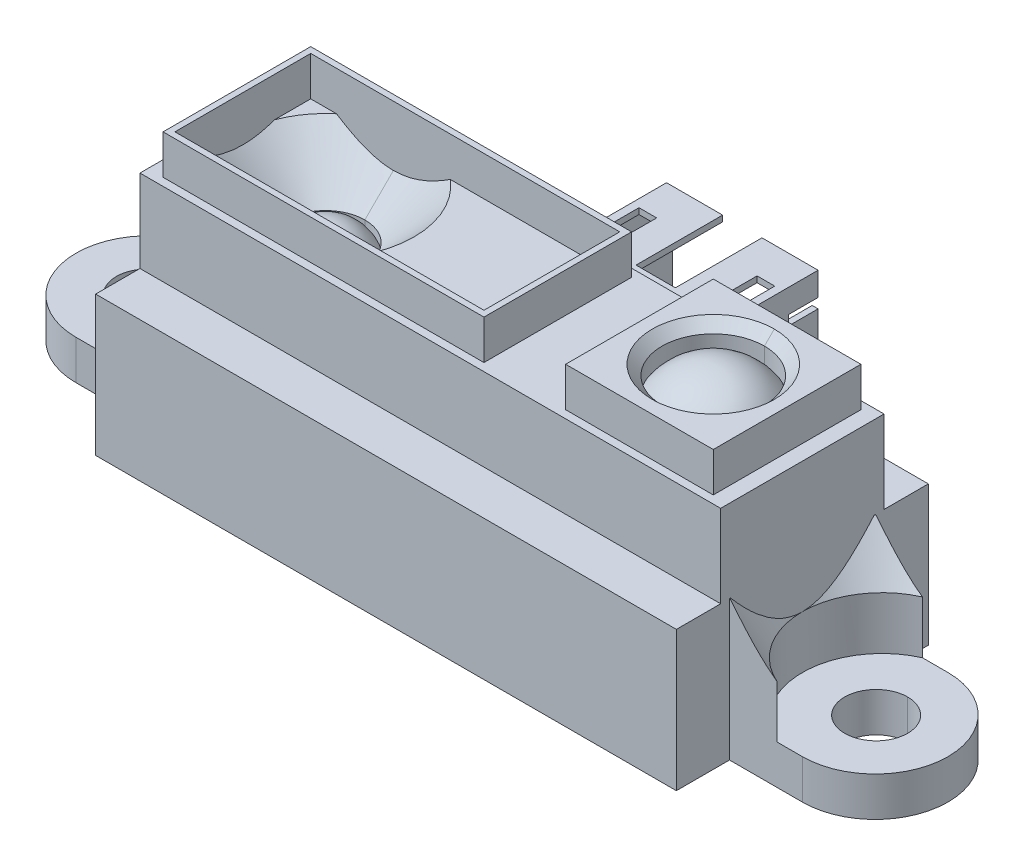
ISO-10303-21;
HEADER;
FILE_DESCRIPTION(('STEP AP214'),'2;1');
FILE_NAME('part.step','',(''),(''),'','','');
FILE_SCHEMA(('AUTOMOTIVE_DESIGN { 1 0 10303 214 1 1 1 1 }'));
ENDSEC;
DATA;
#1=APPLICATION_CONTEXT('core data for automotive mechanical design processes');
#2=APPLICATION_PROTOCOL_DEFINITION('international standard','automotive_design',2000,#1);
#3=PRODUCT_CONTEXT('',#1,'mechanical');
#4=PRODUCT('Part','Part','',(#3));
#5=PRODUCT_RELATED_PRODUCT_CATEGORY('part','',(#4));
#6=PRODUCT_DEFINITION_FORMATION('','',#4);
#7=PRODUCT_DEFINITION_CONTEXT('part definition',#1,'design');
#8=PRODUCT_DEFINITION('design','',#6,#7);
#9=PRODUCT_DEFINITION_SHAPE('','',#8);
#10=(LENGTH_UNIT() NAMED_UNIT(*) SI_UNIT(.MILLI.,.METRE.));
#11=(NAMED_UNIT(*) PLANE_ANGLE_UNIT() SI_UNIT($,.RADIAN.));
#12=(NAMED_UNIT(*) SI_UNIT($,.STERADIAN.) SOLID_ANGLE_UNIT());
#13=UNCERTAINTY_MEASURE_WITH_UNIT(LENGTH_MEASURE(1.E-05),#10,'distance_accuracy_value','');
#14=(GEOMETRIC_REPRESENTATION_CONTEXT(3) GLOBAL_UNCERTAINTY_ASSIGNED_CONTEXT((#13)) GLOBAL_UNIT_ASSIGNED_CONTEXT((#10,
#11,#12)) REPRESENTATION_CONTEXT('',''));
#15=CARTESIAN_POINT('',(0.,0.,0.));
#16=DIRECTION('',(0.,0.,1.));
#17=DIRECTION('',(1.,0.,0.));
#18=AXIS2_PLACEMENT_3D('',#15,#16,#17);
#19=CARTESIAN_POINT('',(0.,6.8,-5.72426406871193));
#20=DIRECTION('',(0.,-1.,0.));
#21=DIRECTION('',(0.,0.,-1.));
#22=AXIS2_PLACEMENT_3D('',#19,#20,#21);
#23=PLANE('',#22);
#24=DIRECTION('',(0.,0.,1.));
#25=VECTOR('',#24,1.);
#26=CARTESIAN_POINT('',(-12.36,6.8,-5.72426406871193));
#27=LINE('',#26,#25);
#28=CARTESIAN_POINT('',(-12.36,6.8,-4.3));
#29=VERTEX_POINT('',#28);
#30=CARTESIAN_POINT('',(-12.36,6.8,-0.9));
#31=VERTEX_POINT('',#30);
#32=EDGE_CURVE('P0_E11',#29,#31,#27,.T.);
#33=ORIENTED_EDGE('',*,*,#32,.F.);
#34=DIRECTION('',(1.,0.,0.));
#35=VECTOR('',#34,1.);
#36=CARTESIAN_POINT('',(0.,6.8,-4.3));
#37=LINE('',#36,#35);
#38=CARTESIAN_POINT('',(-12.06,6.8,-4.3));
#39=VERTEX_POINT('',#38);
#40=EDGE_CURVE('P0_E369',#29,#39,#37,.T.);
#41=ORIENTED_EDGE('',*,*,#40,.T.);
#42=DIRECTION('',(0.,0.,1.));
#43=VECTOR('',#42,1.);
#44=CARTESIAN_POINT('',(-12.06,6.8,-5.72426406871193));
#45=LINE('',#44,#43);
#46=CARTESIAN_POINT('',(-12.06,6.8,-0.9));
#47=VERTEX_POINT('',#46);
#48=EDGE_CURVE('P0_E398',#39,#47,#45,.T.);
#49=ORIENTED_EDGE('',*,*,#48,.T.);
#50=DIRECTION('',(1.,0.,0.));
#51=VECTOR('',#50,1.);
#52=CARTESIAN_POINT('',(0.,6.8,-0.9));
#53=LINE('',#52,#51);
#54=EDGE_CURVE('P0_E371',#31,#47,#53,.T.);
#55=ORIENTED_EDGE('',*,*,#54,.F.);
#56=EDGE_LOOP('',(#33,#41,#49,#55));
#57=FACE_BOUND('',#56,.T.);
#58=ADVANCED_FACE('P0_F18',(#57),#23,.T.);
#59=CARTESIAN_POINT('',(-12.36,0.,-5.72426406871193));
#60=DIRECTION('',(1.,0.,0.));
#61=DIRECTION('',(0.,1.,0.));
#62=AXIS2_PLACEMENT_3D('',#59,#60,#61);
#63=PLANE('',#62);
#64=DIRECTION('',(0.,1.,0.));
#65=VECTOR('',#64,1.);
#66=CARTESIAN_POINT('',(-12.36,0.,-4.3));
#67=LINE('',#66,#65);
#68=CARTESIAN_POINT('',(-12.36,7.1,-4.3));
#69=VERTEX_POINT('',#68);
#70=EDGE_CURVE('P0_E374',#29,#69,#67,.T.);
#71=ORIENTED_EDGE('',*,*,#70,.F.);
#72=ORIENTED_EDGE('',*,*,#32,.T.);
#73=DIRECTION('',(0.,1.,0.));
#74=VECTOR('',#73,1.);
#75=CARTESIAN_POINT('',(-12.36,0.,-0.9));
#76=LINE('',#75,#74);
#77=CARTESIAN_POINT('',(-12.36,7.1,-0.9));
#78=VERTEX_POINT('',#77);
#79=EDGE_CURVE('P0_E411',#31,#78,#76,.T.);
#80=ORIENTED_EDGE('',*,*,#79,.T.);
#81=DIRECTION('',(0.,0.,1.));
#82=VECTOR('',#81,1.);
#83=CARTESIAN_POINT('',(-12.36,7.1,-5.72426406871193));
#84=LINE('',#83,#82);
#85=EDGE_CURVE('P0_E26',#69,#78,#84,.T.);
#86=ORIENTED_EDGE('',*,*,#85,.F.);
#87=EDGE_LOOP('',(#71,#72,#80,#86));
#88=FACE_BOUND('',#87,.T.);
#89=ADVANCED_FACE('P0_F375',(#88),#63,.F.);
#90=CARTESIAN_POINT('',(0.,7.1,-5.72426406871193));
#91=DIRECTION('',(0.,-1.,0.));
#92=DIRECTION('',(0.,0.,-1.));
#93=AXIS2_PLACEMENT_3D('',#90,#91,#92);
#94=PLANE('',#93);
#95=DIRECTION('',(1.,0.,0.));
#96=VECTOR('',#95,1.);
#97=CARTESIAN_POINT('',(0.,7.1,-4.3));
#98=LINE('',#97,#96);
#99=CARTESIAN_POINT('',(-12.06,7.1,-4.3));
#100=VERTEX_POINT('',#99);
#101=EDGE_CURVE('P0_E379',#69,#100,#98,.T.);
#102=ORIENTED_EDGE('',*,*,#101,.F.);
#103=ORIENTED_EDGE('',*,*,#85,.T.);
#104=DIRECTION('',(1.,0.,0.));
#105=VECTOR('',#104,1.);
#106=CARTESIAN_POINT('',(0.,7.1,-0.9));
#107=LINE('',#106,#105);
#108=CARTESIAN_POINT('',(-12.06,7.1,-0.9));
#109=VERTEX_POINT('',#108);
#110=EDGE_CURVE('P0_E407',#78,#109,#107,.T.);
#111=ORIENTED_EDGE('',*,*,#110,.T.);
#112=DIRECTION('',(0.,0.,1.));
#113=VECTOR('',#112,1.);
#114=CARTESIAN_POINT('',(-12.06,7.1,-5.72426406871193));
#115=LINE('',#114,#113);
#116=EDGE_CURVE('P0_E39',#100,#109,#115,.T.);
#117=ORIENTED_EDGE('',*,*,#116,.F.);
#118=EDGE_LOOP('',(#102,#103,#111,#117));
#119=FACE_BOUND('',#118,.T.);
#120=ADVANCED_FACE('P0_F405',(#119),#94,.F.);
#121=CARTESIAN_POINT('',(-12.06,0.,-5.72426406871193));
#122=DIRECTION('',(1.,0.,0.));
#123=DIRECTION('',(0.,1.,0.));
#124=AXIS2_PLACEMENT_3D('',#121,#122,#123);
#125=PLANE('',#124);
#126=ORIENTED_EDGE('',*,*,#48,.F.);
#127=DIRECTION('',(0.,1.,0.));
#128=VECTOR('',#127,1.);
#129=CARTESIAN_POINT('',(-12.06,0.,-4.3));
#130=LINE('',#129,#128);
#131=EDGE_CURVE('P0_E383',#39,#100,#130,.T.);
#132=ORIENTED_EDGE('',*,*,#131,.T.);
#133=ORIENTED_EDGE('',*,*,#116,.T.);
#134=DIRECTION('',(0.,1.,0.));
#135=VECTOR('',#134,1.);
#136=CARTESIAN_POINT('',(-12.06,0.,-0.9));
#137=LINE('',#136,#135);
#138=EDGE_CURVE('P0_E419',#47,#109,#137,.T.);
#139=ORIENTED_EDGE('',*,*,#138,.F.);
#140=EDGE_LOOP('',(#126,#132,#133,#139));
#141=FACE_BOUND('',#140,.T.);
#142=ADVANCED_FACE('P0_F1246',(#141),#125,.T.);
#143=CARTESIAN_POINT('',(0.,8.4,-4.3));
#144=DIRECTION('',(0.,0.,-1.));
#145=DIRECTION('',(0.,-1.,0.));
#146=AXIS2_PLACEMENT_3D('',#143,#144,#145);
#147=PLANE('',#146);
#148=ORIENTED_EDGE('',*,*,#40,.F.);
#149=ORIENTED_EDGE('',*,*,#70,.T.);
#150=ORIENTED_EDGE('',*,*,#101,.T.);
#151=ORIENTED_EDGE('',*,*,#131,.F.);
#152=EDGE_LOOP('',(#148,#149,#150,#151));
#153=FACE_BOUND('',#152,.T.);
#154=ADVANCED_FACE('P0_F382',(#153),#147,.T.);
#155=CARTESIAN_POINT('',(0.,6.8,-5.72426406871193));
#156=DIRECTION('',(0.,-1.,0.));
#157=DIRECTION('',(0.,0.,-1.));
#158=AXIS2_PLACEMENT_3D('',#155,#156,#157);
#159=PLANE('',#158);
#160=DIRECTION('',(0.,0.,1.));
#161=VECTOR('',#160,1.);
#162=CARTESIAN_POINT('',(-17.44,6.8,-5.72426406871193));
#163=LINE('',#162,#161);
#164=CARTESIAN_POINT('',(-17.44,6.8,-4.3));
#165=VERTEX_POINT('',#164);
#166=CARTESIAN_POINT('',(-17.44,6.8,-0.9));
#167=VERTEX_POINT('',#166);
#168=EDGE_CURVE('P0_E385',#165,#167,#163,.T.);
#169=ORIENTED_EDGE('',*,*,#168,.F.);
#170=DIRECTION('',(1.,0.,0.));
#171=VECTOR('',#170,1.);
#172=CARTESIAN_POINT('',(0.,6.8,-4.3));
#173=LINE('',#172,#171);
#174=CARTESIAN_POINT('',(-17.14,6.8,-4.3));
#175=VERTEX_POINT('',#174);
#176=EDGE_CURVE('P0_E605',#165,#175,#173,.T.);
#177=ORIENTED_EDGE('',*,*,#176,.T.);
#178=DIRECTION('',(0.,0.,1.));
#179=VECTOR('',#178,1.);
#180=CARTESIAN_POINT('',(-17.14,6.8,-5.72426406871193));
#181=LINE('',#180,#179);
#182=CARTESIAN_POINT('',(-17.14,6.8,-0.9));
#183=VERTEX_POINT('',#182);
#184=EDGE_CURVE('P0_E614',#175,#183,#181,.T.);
#185=ORIENTED_EDGE('',*,*,#184,.T.);
#186=DIRECTION('',(1.,0.,0.));
#187=VECTOR('',#186,1.);
#188=CARTESIAN_POINT('',(0.,6.8,-0.9));
#189=LINE('',#188,#187);
#190=EDGE_CURVE('P0_E414',#167,#183,#189,.T.);
#191=ORIENTED_EDGE('',*,*,#190,.F.);
#192=EDGE_LOOP('',(#169,#177,#185,#191));
#193=FACE_BOUND('',#192,.T.);
#194=ADVANCED_FACE('P0_F1254',(#193),#159,.T.);
#195=CARTESIAN_POINT('',(-17.44,0.,-5.72426406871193));
#196=DIRECTION('',(1.,0.,0.));
#197=DIRECTION('',(0.,1.,0.));
#198=AXIS2_PLACEMENT_3D('',#195,#196,#197);
#199=PLANE('',#198);
#200=DIRECTION('',(0.,1.,0.));
#201=VECTOR('',#200,1.);
#202=CARTESIAN_POINT('',(-17.44,0.,-4.3));
#203=LINE('',#202,#201);
#204=CARTESIAN_POINT('',(-17.44,7.1,-4.3));
#205=VERTEX_POINT('',#204);
#206=EDGE_CURVE('P0_E611',#165,#205,#203,.T.);
#207=ORIENTED_EDGE('',*,*,#206,.F.);
#208=ORIENTED_EDGE('',*,*,#168,.T.);
#209=DIRECTION('',(0.,1.,0.));
#210=VECTOR('',#209,1.);
#211=CARTESIAN_POINT('',(-17.44,0.,-0.9));
#212=LINE('',#211,#210);
#213=CARTESIAN_POINT('',(-17.44,7.1,-0.9));
#214=VERTEX_POINT('',#213);
#215=EDGE_CURVE('P0_E441',#167,#214,#212,.T.);
#216=ORIENTED_EDGE('',*,*,#215,.T.);
#217=DIRECTION('',(0.,0.,1.));
#218=VECTOR('',#217,1.);
#219=CARTESIAN_POINT('',(-17.44,7.1,-5.72426406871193));
#220=LINE('',#219,#218);
#221=EDGE_CURVE('P0_E391',#205,#214,#220,.T.);
#222=ORIENTED_EDGE('',*,*,#221,.F.);
#223=EDGE_LOOP('',(#207,#208,#216,#222));
#224=FACE_BOUND('',#223,.T.);
#225=ADVANCED_FACE('P0_F1257',(#224),#199,.F.);
#226=CARTESIAN_POINT('',(0.,7.1,-5.72426406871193));
#227=DIRECTION('',(0.,-1.,0.));
#228=DIRECTION('',(0.,0.,-1.));
#229=AXIS2_PLACEMENT_3D('',#226,#227,#228);
#230=PLANE('',#229);
#231=DIRECTION('',(1.,0.,0.));
#232=VECTOR('',#231,1.);
#233=CARTESIAN_POINT('',(0.,7.1,-4.3));
#234=LINE('',#233,#232);
#235=CARTESIAN_POINT('',(-17.14,7.1,-4.3));
#236=VERTEX_POINT('',#235);
#237=EDGE_CURVE('P0_E606',#205,#236,#234,.T.);
#238=ORIENTED_EDGE('',*,*,#237,.F.);
#239=ORIENTED_EDGE('',*,*,#221,.T.);
#240=DIRECTION('',(1.,0.,0.));
#241=VECTOR('',#240,1.);
#242=CARTESIAN_POINT('',(0.,7.1,-0.9));
#243=LINE('',#242,#241);
#244=CARTESIAN_POINT('',(-17.14,7.1,-0.9));
#245=VERTEX_POINT('',#244);
#246=EDGE_CURVE('P0_E517',#214,#245,#243,.T.);
#247=ORIENTED_EDGE('',*,*,#246,.T.);
#248=DIRECTION('',(0.,0.,1.));
#249=VECTOR('',#248,1.);
#250=CARTESIAN_POINT('',(-17.14,7.1,-5.72426406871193));
#251=LINE('',#250,#249);
#252=EDGE_CURVE('P0_E615',#236,#245,#251,.T.);
#253=ORIENTED_EDGE('',*,*,#252,.F.);
#254=EDGE_LOOP('',(#238,#239,#247,#253));
#255=FACE_BOUND('',#254,.T.);
#256=ADVANCED_FACE('P0_F1260',(#255),#230,.F.);
#257=CARTESIAN_POINT('',(-17.14,0.,-5.72426406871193));
#258=DIRECTION('',(1.,0.,0.));
#259=DIRECTION('',(0.,1.,0.));
#260=AXIS2_PLACEMENT_3D('',#257,#258,#259);
#261=PLANE('',#260);
#262=ORIENTED_EDGE('',*,*,#184,.F.);
#263=DIRECTION('',(0.,1.,0.));
#264=VECTOR('',#263,1.);
#265=CARTESIAN_POINT('',(-17.14,0.,-4.3));
#266=LINE('',#265,#264);
#267=EDGE_CURVE('P0_E610',#175,#236,#266,.T.);
#268=ORIENTED_EDGE('',*,*,#267,.T.);
#269=ORIENTED_EDGE('',*,*,#252,.T.);
#270=DIRECTION('',(0.,1.,0.));
#271=VECTOR('',#270,1.);
#272=CARTESIAN_POINT('',(-17.14,0.,-0.9));
#273=LINE('',#272,#271);
#274=EDGE_CURVE('P0_E513',#183,#245,#273,.T.);
#275=ORIENTED_EDGE('',*,*,#274,.F.);
#276=EDGE_LOOP('',(#262,#268,#269,#275));
#277=FACE_BOUND('',#276,.T.);
#278=ADVANCED_FACE('P0_F1264',(#277),#261,.T.);
#279=CARTESIAN_POINT('',(0.,8.4,-4.3));
#280=DIRECTION('',(0.,0.,-1.));
#281=DIRECTION('',(0.,-1.,0.));
#282=AXIS2_PLACEMENT_3D('',#279,#280,#281);
#283=PLANE('',#282);
#284=ORIENTED_EDGE('',*,*,#176,.F.);
#285=ORIENTED_EDGE('',*,*,#206,.T.);
#286=ORIENTED_EDGE('',*,*,#237,.T.);
#287=ORIENTED_EDGE('',*,*,#267,.F.);
#288=EDGE_LOOP('',(#284,#285,#286,#287));
#289=FACE_BOUND('',#288,.T.);
#290=ADVANCED_FACE('P0_F1268',(#289),#283,.T.);
#291=CARTESIAN_POINT('',(0.,6.8,-5.72426406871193));
#292=DIRECTION('',(0.,-1.,0.));
#293=DIRECTION('',(0.,0.,-1.));
#294=AXIS2_PLACEMENT_3D('',#291,#292,#293);
#295=PLANE('',#294);
#296=DIRECTION('',(0.,0.,1.));
#297=VECTOR('',#296,1.);
#298=CARTESIAN_POINT('',(-14.9,6.8,-5.72426406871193));
#299=LINE('',#298,#297);
#300=CARTESIAN_POINT('',(-14.9,6.8,-4.3));
#301=VERTEX_POINT('',#300);
#302=CARTESIAN_POINT('',(-14.9,6.8,-0.9));
#303=VERTEX_POINT('',#302);
#304=EDGE_CURVE('P0_E602',#301,#303,#299,.T.);
#305=ORIENTED_EDGE('',*,*,#304,.F.);
#306=DIRECTION('',(1.,0.,0.));
#307=VECTOR('',#306,1.);
#308=CARTESIAN_POINT('',(0.,6.8,-4.3));
#309=LINE('',#308,#307);
#310=CARTESIAN_POINT('',(-14.6,6.8,-4.3));
#311=VERTEX_POINT('',#310);
#312=EDGE_CURVE('P0_E583',#301,#311,#309,.T.);
#313=ORIENTED_EDGE('',*,*,#312,.T.);
#314=DIRECTION('',(0.,0.,1.));
#315=VECTOR('',#314,1.);
#316=CARTESIAN_POINT('',(-14.6,6.8,-5.72426406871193));
#317=LINE('',#316,#315);
#318=CARTESIAN_POINT('',(-14.6,6.8,-0.9));
#319=VERTEX_POINT('',#318);
#320=EDGE_CURVE('P0_E593',#311,#319,#317,.T.);
#321=ORIENTED_EDGE('',*,*,#320,.T.);
#322=DIRECTION('',(1.,0.,0.));
#323=VECTOR('',#322,1.);
#324=CARTESIAN_POINT('',(0.,6.8,-0.9));
#325=LINE('',#324,#323);
#326=EDGE_CURVE('P0_E436',#303,#319,#325,.T.);
#327=ORIENTED_EDGE('',*,*,#326,.F.);
#328=EDGE_LOOP('',(#305,#313,#321,#327));
#329=FACE_BOUND('',#328,.T.);
#330=ADVANCED_FACE('P0_F1271',(#329),#295,.T.);
#331=CARTESIAN_POINT('',(-14.9,0.,-5.72426406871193));
#332=DIRECTION('',(1.,0.,0.));
#333=DIRECTION('',(0.,1.,0.));
#334=AXIS2_PLACEMENT_3D('',#331,#332,#333);
#335=PLANE('',#334);
#336=DIRECTION('',(0.,1.,0.));
#337=VECTOR('',#336,1.);
#338=CARTESIAN_POINT('',(-14.9,0.,-4.3));
#339=LINE('',#338,#337);
#340=CARTESIAN_POINT('',(-14.9,7.1,-4.3));
#341=VERTEX_POINT('',#340);
#342=EDGE_CURVE('P0_E573',#301,#341,#339,.T.);
#343=ORIENTED_EDGE('',*,*,#342,.F.);
#344=ORIENTED_EDGE('',*,*,#304,.T.);
#345=DIRECTION('',(0.,1.,0.));
#346=VECTOR('',#345,1.);
#347=CARTESIAN_POINT('',(-14.9,0.,-0.9));
#348=LINE('',#347,#346);
#349=CARTESIAN_POINT('',(-14.9,7.1,-0.9));
#350=VERTEX_POINT('',#349);
#351=EDGE_CURVE('P0_E531',#303,#350,#348,.T.);
#352=ORIENTED_EDGE('',*,*,#351,.T.);
#353=DIRECTION('',(0.,0.,1.));
#354=VECTOR('',#353,1.);
#355=CARTESIAN_POINT('',(-14.9,7.1,-5.72426406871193));
#356=LINE('',#355,#354);
#357=EDGE_CURVE('P0_E599',#341,#350,#356,.T.);
#358=ORIENTED_EDGE('',*,*,#357,.F.);
#359=EDGE_LOOP('',(#343,#344,#352,#358));
#360=FACE_BOUND('',#359,.T.);
#361=ADVANCED_FACE('P0_F1273',(#360),#335,.F.);
#362=CARTESIAN_POINT('',(0.,7.1,-5.72426406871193));
#363=DIRECTION('',(0.,-1.,0.));
#364=DIRECTION('',(0.,0.,-1.));
#365=AXIS2_PLACEMENT_3D('',#362,#363,#364);
#366=PLANE('',#365);
#367=DIRECTION('',(1.,0.,0.));
#368=VECTOR('',#367,1.);
#369=CARTESIAN_POINT('',(0.,7.1,-4.3));
#370=LINE('',#369,#368);
#371=CARTESIAN_POINT('',(-14.6,7.1,-4.3));
#372=VERTEX_POINT('',#371);
#373=EDGE_CURVE('P0_E568',#341,#372,#370,.T.);
#374=ORIENTED_EDGE('',*,*,#373,.F.);
#375=ORIENTED_EDGE('',*,*,#357,.T.);
#376=DIRECTION('',(1.,0.,0.));
#377=VECTOR('',#376,1.);
#378=CARTESIAN_POINT('',(0.,7.1,-0.9));
#379=LINE('',#378,#377);
#380=CARTESIAN_POINT('',(-14.6,7.1,-0.9));
#381=VERTEX_POINT('',#380);
#382=EDGE_CURVE('P0_E527',#350,#381,#379,.T.);
#383=ORIENTED_EDGE('',*,*,#382,.T.);
#384=DIRECTION('',(0.,0.,1.));
#385=VECTOR('',#384,1.);
#386=CARTESIAN_POINT('',(-14.6,7.1,-5.72426406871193));
#387=LINE('',#386,#385);
#388=EDGE_CURVE('P0_E596',#372,#381,#387,.T.);
#389=ORIENTED_EDGE('',*,*,#388,.F.);
#390=EDGE_LOOP('',(#374,#375,#383,#389));
#391=FACE_BOUND('',#390,.T.);
#392=ADVANCED_FACE('P0_F1276',(#391),#366,.F.);
#393=CARTESIAN_POINT('',(-14.6,0.,-5.72426406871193));
#394=DIRECTION('',(1.,0.,0.));
#395=DIRECTION('',(0.,1.,0.));
#396=AXIS2_PLACEMENT_3D('',#393,#394,#395);
#397=PLANE('',#396);
#398=ORIENTED_EDGE('',*,*,#320,.F.);
#399=DIRECTION('',(0.,1.,0.));
#400=VECTOR('',#399,1.);
#401=CARTESIAN_POINT('',(-14.6,0.,-4.3));
#402=LINE('',#401,#400);
#403=EDGE_CURVE('P0_E572',#311,#372,#402,.T.);
#404=ORIENTED_EDGE('',*,*,#403,.T.);
#405=ORIENTED_EDGE('',*,*,#388,.T.);
#406=DIRECTION('',(0.,1.,0.));
#407=VECTOR('',#406,1.);
#408=CARTESIAN_POINT('',(-14.6,0.,-0.9));
#409=LINE('',#408,#407);
#410=EDGE_CURVE('P0_E440',#319,#381,#409,.T.);
#411=ORIENTED_EDGE('',*,*,#410,.F.);
#412=EDGE_LOOP('',(#398,#404,#405,#411));
#413=FACE_BOUND('',#412,.T.);
#414=ADVANCED_FACE('P0_F1280',(#413),#397,.T.);
#415=CARTESIAN_POINT('',(0.,8.4,-4.3));
#416=DIRECTION('',(0.,0.,-1.));
#417=DIRECTION('',(0.,-1.,0.));
#418=AXIS2_PLACEMENT_3D('',#415,#416,#417);
#419=PLANE('',#418);
#420=ORIENTED_EDGE('',*,*,#312,.F.);
#421=ORIENTED_EDGE('',*,*,#342,.T.);
#422=ORIENTED_EDGE('',*,*,#373,.T.);
#423=ORIENTED_EDGE('',*,*,#403,.F.);
#424=EDGE_LOOP('',(#420,#421,#422,#423));
#425=FACE_BOUND('',#424,.T.);
#426=ADVANCED_FACE('P0_F1284',(#425),#419,.T.);
#427=CARTESIAN_POINT('',(0.,-0.000999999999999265,-1.7));
#428=DIRECTION('',(0.,0.,1.));
#429=DIRECTION('',(1.,0.,0.));
#430=AXIS2_PLACEMENT_3D('',#427,#428,#429);
#431=PLANE('',#430);
#432=DIRECTION('',(0.,1.,0.));
#433=VECTOR('',#432,1.);
#434=CARTESIAN_POINT('',(-18.2,-0.000999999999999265,-1.7));
#435=LINE('',#434,#433);
#436=CARTESIAN_POINT('',(-18.2,8.1,-1.7));
#437=VERTEX_POINT('',#436);
#438=CARTESIAN_POINT('',(-18.2,8.4,-1.7));
#439=VERTEX_POINT('',#438);
#440=EDGE_CURVE('P0_E567',#437,#439,#435,.T.);
#441=ORIENTED_EDGE('',*,*,#440,.T.);
#442=DIRECTION('',(1.,0.,0.));
#443=VECTOR('',#442,1.);
#444=CARTESIAN_POINT('',(0.,8.4,-1.7));
#445=LINE('',#444,#443);
#446=CARTESIAN_POINT('',(-17.3,8.4,-1.7));
#447=VERTEX_POINT('',#446);
#448=EDGE_CURVE('P0_E876',#439,#447,#445,.T.);
#449=ORIENTED_EDGE('',*,*,#448,.T.);
#450=DIRECTION('',(0.,1.,0.));
#451=VECTOR('',#450,1.);
#452=CARTESIAN_POINT('',(-17.3,-0.000999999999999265,-1.7));
#453=LINE('',#452,#451);
#454=CARTESIAN_POINT('',(-17.3,8.1,-1.7));
#455=VERTEX_POINT('',#454);
#456=EDGE_CURVE('P0_E580',#455,#447,#453,.T.);
#457=ORIENTED_EDGE('',*,*,#456,.F.);
#458=DIRECTION('',(1.,0.,0.));
#459=VECTOR('',#458,1.);
#460=CARTESIAN_POINT('',(0.,8.1,-1.7));
#461=LINE('',#460,#459);
#462=EDGE_CURVE('P0_E502',#437,#455,#461,.T.);
#463=ORIENTED_EDGE('',*,*,#462,.F.);
#464=EDGE_LOOP('',(#441,#449,#457,#463));
#465=FACE_BOUND('',#464,.T.);
#466=ADVANCED_FACE('P0_F1288',(#465),#431,.F.);
#467=CARTESIAN_POINT('',(-17.3,-0.000999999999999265,0.));
#468=DIRECTION('',(1.,0.,0.));
#469=DIRECTION('',(0.,1.,0.));
#470=AXIS2_PLACEMENT_3D('',#467,#468,#469);
#471=PLANE('',#470);
#472=ORIENTED_EDGE('',*,*,#456,.T.);
#473=DIRECTION('',(0.,0.,-1.));
#474=VECTOR('',#473,1.);
#475=CARTESIAN_POINT('',(-17.3,8.4,0.));
#476=LINE('',#475,#474);
#477=CARTESIAN_POINT('',(-17.3,8.4,-3.5));
#478=VERTEX_POINT('',#477);
#479=EDGE_CURVE('P0_E856',#447,#478,#476,.T.);
#480=ORIENTED_EDGE('',*,*,#479,.T.);
#481=DIRECTION('',(0.,1.,0.));
#482=VECTOR('',#481,1.);
#483=CARTESIAN_POINT('',(-17.3,-0.000999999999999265,-3.5));
#484=LINE('',#483,#482);
#485=CARTESIAN_POINT('',(-17.3,8.1,-3.5));
#486=VERTEX_POINT('',#485);
#487=EDGE_CURVE('P0_E577',#486,#478,#484,.T.);
#488=ORIENTED_EDGE('',*,*,#487,.F.);
#489=DIRECTION('',(0.,0.,-1.));
#490=VECTOR('',#489,1.);
#491=CARTESIAN_POINT('',(-17.3,8.1,0.));
#492=LINE('',#491,#490);
#493=EDGE_CURVE('P0_E481',#455,#486,#492,.T.);
#494=ORIENTED_EDGE('',*,*,#493,.F.);
#495=EDGE_LOOP('',(#472,#480,#488,#494));
#496=FACE_BOUND('',#495,.T.);
#497=ADVANCED_FACE('P0_F1292',(#496),#471,.F.);
#498=CARTESIAN_POINT('',(0.,-0.000999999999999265,-3.5));
#499=DIRECTION('',(0.,0.,-1.));
#500=DIRECTION('',(0.,-1.,0.));
#501=AXIS2_PLACEMENT_3D('',#498,#499,#500);
#502=PLANE('',#501);
#503=ORIENTED_EDGE('',*,*,#487,.T.);
#504=DIRECTION('',(-1.,0.,0.));
#505=VECTOR('',#504,1.);
#506=CARTESIAN_POINT('',(0.,8.4,-3.5));
#507=LINE('',#506,#505);
#508=CARTESIAN_POINT('',(-18.2,8.4,-3.5));
#509=VERTEX_POINT('',#508);
#510=EDGE_CURVE('P0_E865',#478,#509,#507,.T.);
#511=ORIENTED_EDGE('',*,*,#510,.T.);
#512=DIRECTION('',(0.,1.,0.));
#513=VECTOR('',#512,1.);
#514=CARTESIAN_POINT('',(-18.2,-0.000999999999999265,-3.5));
#515=LINE('',#514,#513);
#516=CARTESIAN_POINT('',(-18.2,8.1,-3.5));
#517=VERTEX_POINT('',#516);
#518=EDGE_CURVE('P0_E563',#517,#509,#515,.T.);
#519=ORIENTED_EDGE('',*,*,#518,.F.);
#520=DIRECTION('',(-1.,0.,0.));
#521=VECTOR('',#520,1.);
#522=CARTESIAN_POINT('',(0.,8.1,-3.5));
#523=LINE('',#522,#521);
#524=EDGE_CURVE('P0_E476',#486,#517,#523,.T.);
#525=ORIENTED_EDGE('',*,*,#524,.F.);
#526=EDGE_LOOP('',(#503,#511,#519,#525));
#527=FACE_BOUND('',#526,.T.);
#528=ADVANCED_FACE('P0_F1296',(#527),#502,.F.);
#529=CARTESIAN_POINT('',(-18.2,-0.000999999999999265,0.));
#530=DIRECTION('',(-1.,0.,0.));
#531=DIRECTION('',(0.,0.,1.));
#532=AXIS2_PLACEMENT_3D('',#529,#530,#531);
#533=PLANE('',#532);
#534=ORIENTED_EDGE('',*,*,#518,.T.);
#535=DIRECTION('',(0.,0.,1.));
#536=VECTOR('',#535,1.);
#537=CARTESIAN_POINT('',(-18.2,8.4,0.));
#538=LINE('',#537,#536);
#539=EDGE_CURVE('P0_E869',#509,#439,#538,.T.);
#540=ORIENTED_EDGE('',*,*,#539,.T.);
#541=ORIENTED_EDGE('',*,*,#440,.F.);
#542=DIRECTION('',(0.,0.,1.));
#543=VECTOR('',#542,1.);
#544=CARTESIAN_POINT('',(-18.2,8.1,0.));
#545=LINE('',#544,#543);
#546=EDGE_CURVE('P0_E498',#517,#437,#545,.T.);
#547=ORIENTED_EDGE('',*,*,#546,.F.);
#548=EDGE_LOOP('',(#534,#540,#541,#547));
#549=FACE_BOUND('',#548,.T.);
#550=ADVANCED_FACE('P0_F1298',(#549),#533,.F.);
#551=CARTESIAN_POINT('',(-12.2,-0.000999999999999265,0.));
#552=DIRECTION('',(-1.,0.,0.));
#553=DIRECTION('',(0.,0.,1.));
#554=AXIS2_PLACEMENT_3D('',#551,#552,#553);
#555=PLANE('',#554);
#556=DIRECTION('',(0.,1.,0.));
#557=VECTOR('',#556,1.);
#558=CARTESIAN_POINT('',(-12.2,-0.000999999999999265,-3.5));
#559=LINE('',#558,#557);
#560=CARTESIAN_POINT('',(-12.2,8.1,-3.5));
#561=VERTEX_POINT('',#560);
#562=CARTESIAN_POINT('',(-12.2,8.4,-3.5));
#563=VERTEX_POINT('',#562);
#564=EDGE_CURVE('P0_E562',#561,#563,#559,.T.);
#565=ORIENTED_EDGE('',*,*,#564,.T.);
#566=DIRECTION('',(0.,0.,1.));
#567=VECTOR('',#566,1.);
#568=CARTESIAN_POINT('',(-12.2,8.4,0.));
#569=LINE('',#568,#567);
#570=CARTESIAN_POINT('',(-12.2,8.4,-1.7));
#571=VERTEX_POINT('',#570);
#572=EDGE_CURVE('P0_E844',#563,#571,#569,.T.);
#573=ORIENTED_EDGE('',*,*,#572,.T.);
#574=DIRECTION('',(0.,1.,0.));
#575=VECTOR('',#574,1.);
#576=CARTESIAN_POINT('',(-12.2,-0.000999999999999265,-1.7));
#577=LINE('',#576,#575);
#578=CARTESIAN_POINT('',(-12.2,8.1,-1.7));
#579=VERTEX_POINT('',#578);
#580=EDGE_CURVE('P0_E552',#579,#571,#577,.T.);
#581=ORIENTED_EDGE('',*,*,#580,.F.);
#582=DIRECTION('',(0.,0.,1.));
#583=VECTOR('',#582,1.);
#584=CARTESIAN_POINT('',(-12.2,8.1,0.));
#585=LINE('',#584,#583);
#586=EDGE_CURVE('P0_E690',#561,#579,#585,.T.);
#587=ORIENTED_EDGE('',*,*,#586,.F.);
#588=EDGE_LOOP('',(#565,#573,#581,#587));
#589=FACE_BOUND('',#588,.T.);
#590=ADVANCED_FACE('P0_F1300',(#589),#555,.F.);
#591=CARTESIAN_POINT('',(0.,-0.000999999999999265,-3.5));
#592=DIRECTION('',(0.,0.,-1.));
#593=DIRECTION('',(0.,-1.,0.));
#594=AXIS2_PLACEMENT_3D('',#591,#592,#593);
#595=PLANE('',#594);
#596=DIRECTION('',(0.,1.,0.));
#597=VECTOR('',#596,1.);
#598=CARTESIAN_POINT('',(-11.3,-0.000999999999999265,-3.5));
#599=LINE('',#598,#597);
#600=CARTESIAN_POINT('',(-11.3,8.1,-3.5));
#601=VERTEX_POINT('',#600);
#602=CARTESIAN_POINT('',(-11.3,8.4,-3.5));
#603=VERTEX_POINT('',#602);
#604=EDGE_CURVE('P0_E559',#601,#603,#599,.T.);
#605=ORIENTED_EDGE('',*,*,#604,.T.);
#606=DIRECTION('',(-1.,0.,0.));
#607=VECTOR('',#606,1.);
#608=CARTESIAN_POINT('',(0.,8.4,-3.5));
#609=LINE('',#608,#607);
#610=EDGE_CURVE('P0_E835',#603,#563,#609,.T.);
#611=ORIENTED_EDGE('',*,*,#610,.T.);
#612=ORIENTED_EDGE('',*,*,#564,.F.);
#613=DIRECTION('',(-1.,0.,0.));
#614=VECTOR('',#613,1.);
#615=CARTESIAN_POINT('',(0.,8.1,-3.5));
#616=LINE('',#615,#614);
#617=EDGE_CURVE('P0_E469',#601,#561,#616,.T.);
#618=ORIENTED_EDGE('',*,*,#617,.F.);
#619=EDGE_LOOP('',(#605,#611,#612,#618));
#620=FACE_BOUND('',#619,.T.);
#621=ADVANCED_FACE('P0_F1305',(#620),#595,.F.);
#622=CARTESIAN_POINT('',(-11.3,-0.000999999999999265,0.));
#623=DIRECTION('',(1.,0.,0.));
#624=DIRECTION('',(0.,1.,0.));
#625=AXIS2_PLACEMENT_3D('',#622,#623,#624);
#626=PLANE('',#625);
#627=DIRECTION('',(0.,1.,0.));
#628=VECTOR('',#627,1.);
#629=CARTESIAN_POINT('',(-11.3,-0.000999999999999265,-1.7));
#630=LINE('',#629,#628);
#631=CARTESIAN_POINT('',(-11.3,8.1,-1.7));
#632=VERTEX_POINT('',#631);
#633=CARTESIAN_POINT('',(-11.3,8.4,-1.7));
#634=VERTEX_POINT('',#633);
#635=EDGE_CURVE('P0_E556',#632,#634,#630,.T.);
#636=ORIENTED_EDGE('',*,*,#635,.T.);
#637=DIRECTION('',(0.,0.,-1.));
#638=VECTOR('',#637,1.);
#639=CARTESIAN_POINT('',(-11.3,8.4,0.));
#640=LINE('',#639,#638);
#641=EDGE_CURVE('P0_E852',#634,#603,#640,.T.);
#642=ORIENTED_EDGE('',*,*,#641,.T.);
#643=ORIENTED_EDGE('',*,*,#604,.F.);
#644=DIRECTION('',(0.,0.,-1.));
#645=VECTOR('',#644,1.);
#646=CARTESIAN_POINT('',(-11.3,8.1,0.));
#647=LINE('',#646,#645);
#648=EDGE_CURVE('P0_E465',#632,#601,#647,.T.);
#649=ORIENTED_EDGE('',*,*,#648,.F.);
#650=EDGE_LOOP('',(#636,#642,#643,#649));
#651=FACE_BOUND('',#650,.T.);
#652=ADVANCED_FACE('P0_F1309',(#651),#626,.F.);
#653=CARTESIAN_POINT('',(0.,-0.000999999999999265,-1.7));
#654=DIRECTION('',(0.,0.,1.));
#655=DIRECTION('',(1.,0.,0.));
#656=AXIS2_PLACEMENT_3D('',#653,#654,#655);
#657=PLANE('',#656);
#658=ORIENTED_EDGE('',*,*,#580,.T.);
#659=DIRECTION('',(1.,0.,0.));
#660=VECTOR('',#659,1.);
#661=CARTESIAN_POINT('',(0.,8.4,-1.7));
#662=LINE('',#661,#660);
#663=EDGE_CURVE('P0_E847',#571,#634,#662,.T.);
#664=ORIENTED_EDGE('',*,*,#663,.T.);
#665=ORIENTED_EDGE('',*,*,#635,.F.);
#666=DIRECTION('',(1.,0.,0.));
#667=VECTOR('',#666,1.);
#668=CARTESIAN_POINT('',(0.,8.1,-1.7));
#669=LINE('',#668,#667);
#670=EDGE_CURVE('P0_E456',#579,#632,#669,.T.);
#671=ORIENTED_EDGE('',*,*,#670,.F.);
#672=EDGE_LOOP('',(#658,#664,#665,#671));
#673=FACE_BOUND('',#672,.T.);
#674=ADVANCED_FACE('P0_F1311',(#673),#657,.F.);
#675=CARTESIAN_POINT('',(-21.1124689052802,8.4,-0.199999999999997));
#676=DIRECTION('',(0.,0.,-1.));
#677=DIRECTION('',(-1.,0.,0.));
#678=AXIS2_PLACEMENT_3D('',#675,#676,#677);
#679=PLANE('',#678);
#680=DIRECTION('',(0.,1.,0.));
#681=VECTOR('',#680,1.);
#682=CARTESIAN_POINT('',(-18.6,8.4,-0.199999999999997));
#683=LINE('',#682,#681);
#684=CARTESIAN_POINT('',(-18.6,8.,-0.199999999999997));
#685=VERTEX_POINT('',#684);
#686=CARTESIAN_POINT('',(-18.6,8.4,-0.199999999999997));
#687=VERTEX_POINT('',#686);
#688=EDGE_CURVE('P0_E668',#685,#687,#683,.T.);
#689=ORIENTED_EDGE('',*,*,#688,.T.);
#690=DIRECTION('',(1.,0.,0.));
#691=VECTOR('',#690,1.);
#692=CARTESIAN_POINT('',(-21.1124689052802,8.4,-0.199999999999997));
#693=LINE('',#692,#691);
#694=CARTESIAN_POINT('',(-10.9,8.4,-0.199999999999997));
#695=VERTEX_POINT('',#694);
#696=EDGE_CURVE('P0_E830',#687,#695,#693,.T.);
#697=ORIENTED_EDGE('',*,*,#696,.T.);
#698=DIRECTION('',(0.,1.,0.));
#699=VECTOR('',#698,1.);
#700=CARTESIAN_POINT('',(-10.9,8.4,-0.199999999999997));
#701=LINE('',#700,#699);
#702=CARTESIAN_POINT('',(-10.9,8.,-0.199999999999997));
#703=VERTEX_POINT('',#702);
#704=EDGE_CURVE('P0_E767',#703,#695,#701,.T.);
#705=ORIENTED_EDGE('',*,*,#704,.F.);
#706=DIRECTION('',(1.,0.,0.));
#707=VECTOR('',#706,1.);
#708=CARTESIAN_POINT('',(-21.1124689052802,8.,-0.199999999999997));
#709=LINE('',#708,#707);
#710=EDGE_CURVE('P0_E549',#685,#703,#709,.T.);
#711=ORIENTED_EDGE('',*,*,#710,.F.);
#712=EDGE_LOOP('',(#689,#697,#705,#711));
#713=FACE_BOUND('',#712,.T.);
#714=ADVANCED_FACE('P0_F1314',(#713),#679,.T.);
#715=CARTESIAN_POINT('',(-21.1124689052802,8.,0.));
#716=DIRECTION('',(0.,1.,0.));
#717=DIRECTION('',(1.,0.,0.));
#718=AXIS2_PLACEMENT_3D('',#715,#716,#717);
#719=PLANE('',#718);
#720=DIRECTION('',(0.,0.,1.));
#721=VECTOR('',#720,1.);
#722=CARTESIAN_POINT('',(-18.6,8.,0.));
#723=LINE('',#722,#721);
#724=CARTESIAN_POINT('',(-18.6,8.,-0.5));
#725=VERTEX_POINT('',#724);
#726=EDGE_CURVE('P0_E671',#725,#685,#723,.T.);
#727=ORIENTED_EDGE('',*,*,#726,.T.);
#728=ORIENTED_EDGE('',*,*,#710,.T.);
#729=DIRECTION('',(0.,0.,1.));
#730=VECTOR('',#729,1.);
#731=CARTESIAN_POINT('',(-10.9,8.,0.));
#732=LINE('',#731,#730);
#733=CARTESIAN_POINT('',(-10.9,8.,-0.5));
#734=VERTEX_POINT('',#733);
#735=EDGE_CURVE('P0_E773',#734,#703,#732,.T.);
#736=ORIENTED_EDGE('',*,*,#735,.F.);
#737=DIRECTION('',(1.,0.,0.));
#738=VECTOR('',#737,1.);
#739=CARTESIAN_POINT('',(-21.1124689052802,8.,-0.5));
#740=LINE('',#739,#738);
#741=EDGE_CURVE('P0_E545',#725,#734,#740,.T.);
#742=ORIENTED_EDGE('',*,*,#741,.F.);
#743=EDGE_LOOP('',(#727,#728,#736,#742));
#744=FACE_BOUND('',#743,.T.);
#745=ADVANCED_FACE('P0_F1318',(#744),#719,.T.);
#746=CARTESIAN_POINT('',(-21.1124689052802,8.4,-0.5));
#747=DIRECTION('',(0.,0.,1.));
#748=DIRECTION('',(0.,-1.,0.));
#749=AXIS2_PLACEMENT_3D('',#746,#747,#748);
#750=PLANE('',#749);
#751=DIRECTION('',(0.,-1.,0.));
#752=VECTOR('',#751,1.);
#753=CARTESIAN_POINT('',(-18.6,8.4,-0.5));
#754=LINE('',#753,#752);
#755=CARTESIAN_POINT('',(-18.6,8.4,-0.5));
#756=VERTEX_POINT('',#755);
#757=EDGE_CURVE('P0_E633',#756,#725,#754,.T.);
#758=ORIENTED_EDGE('',*,*,#757,.T.);
#759=ORIENTED_EDGE('',*,*,#741,.T.);
#760=DIRECTION('',(0.,-1.,0.));
#761=VECTOR('',#760,1.);
#762=CARTESIAN_POINT('',(-10.9,8.4,-0.5));
#763=LINE('',#762,#761);
#764=CARTESIAN_POINT('',(-10.9,8.4,-0.5));
#765=VERTEX_POINT('',#764);
#766=EDGE_CURVE('P0_E774',#765,#734,#763,.T.);
#767=ORIENTED_EDGE('',*,*,#766,.F.);
#768=DIRECTION('',(1.,0.,0.));
#769=VECTOR('',#768,1.);
#770=CARTESIAN_POINT('',(-21.1124689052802,8.4,-0.5));
#771=LINE('',#770,#769);
#772=EDGE_CURVE('P0_E910',#756,#765,#771,.T.);
#773=ORIENTED_EDGE('',*,*,#772,.F.);
#774=EDGE_LOOP('',(#758,#759,#767,#773));
#775=FACE_BOUND('',#774,.T.);
#776=ADVANCED_FACE('P0_F1322',(#775),#750,.T.);
#777=CARTESIAN_POINT('',(-21.1124689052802,8.4,0.3));
#778=DIRECTION('',(0.,0.,1.));
#779=DIRECTION('',(0.,-1.,0.));
#780=AXIS2_PLACEMENT_3D('',#777,#778,#779);
#781=PLANE('',#780);
#782=DIRECTION('',(0.,-1.,0.));
#783=VECTOR('',#782,1.);
#784=CARTESIAN_POINT('',(-18.6,8.4,0.3));
#785=LINE('',#784,#783);
#786=CARTESIAN_POINT('',(-18.6,8.4,0.3));
#787=VERTEX_POINT('',#786);
#788=CARTESIAN_POINT('',(-18.6,7.8,0.3));
#789=VERTEX_POINT('',#788);
#790=EDGE_CURVE('P0_E672',#787,#789,#785,.T.);
#791=ORIENTED_EDGE('',*,*,#790,.T.);
#792=DIRECTION('',(1.,0.,0.));
#793=VECTOR('',#792,1.);
#794=CARTESIAN_POINT('',(-21.1124689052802,7.8,0.3));
#795=LINE('',#794,#793);
#796=CARTESIAN_POINT('',(-10.9,7.8,0.3));
#797=VERTEX_POINT('',#796);
#798=EDGE_CURVE('P0_E542',#789,#797,#795,.T.);
#799=ORIENTED_EDGE('',*,*,#798,.T.);
#800=DIRECTION('',(0.,-1.,0.));
#801=VECTOR('',#800,1.);
#802=CARTESIAN_POINT('',(-10.9,8.4,0.3));
#803=LINE('',#802,#801);
#804=CARTESIAN_POINT('',(-10.9,8.4,0.3));
#805=VERTEX_POINT('',#804);
#806=EDGE_CURVE('P0_E639',#805,#797,#803,.T.);
#807=ORIENTED_EDGE('',*,*,#806,.F.);
#808=DIRECTION('',(1.,0.,0.));
#809=VECTOR('',#808,1.);
#810=CARTESIAN_POINT('',(-21.1124689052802,8.4,0.3));
#811=LINE('',#810,#809);
#812=EDGE_CURVE('P0_E829',#787,#805,#811,.T.);
#813=ORIENTED_EDGE('',*,*,#812,.F.);
#814=EDGE_LOOP('',(#791,#799,#807,#813));
#815=FACE_BOUND('',#814,.T.);
#816=ADVANCED_FACE('P0_F1326',(#815),#781,.T.);
#817=CARTESIAN_POINT('',(-21.1124689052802,8.08850512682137,-0.185213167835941));
#818=DIRECTION('',(0.,0.859535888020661,0.511075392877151));
#819=DIRECTION('',(1.,0.,0.));
#820=AXIS2_PLACEMENT_3D('',#817,#818,#819);
#821=PLANE('',#820);
#822=DIRECTION('',(0.,-0.511075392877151,0.859535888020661));
#823=VECTOR('',#822,1.);
#824=CARTESIAN_POINT('',(-18.6,8.08850512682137,-0.185213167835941));
#825=LINE('',#824,#823);
#826=CARTESIAN_POINT('',(-18.6,6.7,2.15));
#827=VERTEX_POINT('',#826);
#828=EDGE_CURVE('P0_E667',#789,#827,#825,.T.);
#829=ORIENTED_EDGE('',*,*,#828,.T.);
#830=DIRECTION('',(1.,0.,0.));
#831=VECTOR('',#830,1.);
#832=CARTESIAN_POINT('',(-21.1124689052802,6.7,2.15));
#833=LINE('',#832,#831);
#834=CARTESIAN_POINT('',(-10.9,6.7,2.15));
#835=VERTEX_POINT('',#834);
#836=EDGE_CURVE('P0_E814',#827,#835,#833,.T.);
#837=ORIENTED_EDGE('',*,*,#836,.T.);
#838=DIRECTION('',(0.,-0.511075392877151,0.859535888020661));
#839=VECTOR('',#838,1.);
#840=CARTESIAN_POINT('',(-10.9,8.08850512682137,-0.185213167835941));
#841=LINE('',#840,#839);
#842=EDGE_CURVE('P0_E635',#797,#835,#841,.T.);
#843=ORIENTED_EDGE('',*,*,#842,.F.);
#844=ORIENTED_EDGE('',*,*,#798,.F.);
#845=EDGE_LOOP('',(#829,#837,#843,#844));
#846=FACE_BOUND('',#845,.T.);
#847=ADVANCED_FACE('P0_F1328',(#846),#821,.T.);
#848=CARTESIAN_POINT('',(-21.1124689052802,8.4,-3.8));
#849=DIRECTION('',(0.,0.,-1.));
#850=DIRECTION('',(0.,-1.,0.));
#851=AXIS2_PLACEMENT_3D('',#848,#849,#850);
#852=PLANE('',#851);
#853=DIRECTION('',(1.,0.,0.));
#854=VECTOR('',#853,1.);
#855=CARTESIAN_POINT('',(-21.1124689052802,6.7,-3.8));
#856=LINE('',#855,#854);
#857=CARTESIAN_POINT('',(-18.6,6.7,-3.8));
#858=VERTEX_POINT('',#857);
#859=CARTESIAN_POINT('',(-18.3,6.7,-3.8));
#860=VERTEX_POINT('',#859);
#861=EDGE_CURVE('P0_E541',#858,#860,#856,.T.);
#862=ORIENTED_EDGE('',*,*,#861,.F.);
#863=DIRECTION('',(0.,1.,0.));
#864=VECTOR('',#863,1.);
#865=CARTESIAN_POINT('',(-18.6,8.4,-3.8));
#866=LINE('',#865,#864);
#867=CARTESIAN_POINT('',(-18.6,7.2,-3.8));
#868=VERTEX_POINT('',#867);
#869=EDGE_CURVE('P0_E647',#858,#868,#866,.T.);
#870=ORIENTED_EDGE('',*,*,#869,.T.);
#871=DIRECTION('',(1.,0.,0.));
#872=VECTOR('',#871,1.);
#873=CARTESIAN_POINT('',(-21.1124689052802,7.2,-3.8));
#874=LINE('',#873,#872);
#875=CARTESIAN_POINT('',(-18.3,7.2,-3.8));
#876=VERTEX_POINT('',#875);
#877=EDGE_CURVE('P0_E496',#868,#876,#874,.T.);
#878=ORIENTED_EDGE('',*,*,#877,.T.);
#879=DIRECTION('',(0.,1.,0.));
#880=VECTOR('',#879,1.);
#881=CARTESIAN_POINT('',(-18.3,8.4,-3.8));
#882=LINE('',#881,#880);
#883=EDGE_CURVE('P0_E681',#860,#876,#882,.T.);
#884=ORIENTED_EDGE('',*,*,#883,.F.);
#885=EDGE_LOOP('',(#862,#870,#878,#884));
#886=FACE_BOUND('',#885,.T.);
#887=ADVANCED_FACE('P0_F1331',(#886),#852,.T.);
#888=CARTESIAN_POINT('',(-21.1124689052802,6.7,0.));
#889=DIRECTION('',(0.,1.,0.));
#890=DIRECTION('',(0.,0.,-1.));
#891=AXIS2_PLACEMENT_3D('',#888,#889,#890);
#892=PLANE('',#891);
#893=DIRECTION('',(1.,0.,0.));
#894=VECTOR('',#893,1.);
#895=CARTESIAN_POINT('',(-21.1124689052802,6.7,-5.3));
#896=LINE('',#895,#894);
#897=CARTESIAN_POINT('',(-18.6,6.7,-5.3));
#898=VERTEX_POINT('',#897);
#899=CARTESIAN_POINT('',(-18.3,6.7,-5.3));
#900=VERTEX_POINT('',#899);
#901=EDGE_CURVE('P0_E963',#898,#900,#896,.T.);
#902=ORIENTED_EDGE('',*,*,#901,.F.);
#903=DIRECTION('',(0.,0.,1.));
#904=VECTOR('',#903,1.);
#905=CARTESIAN_POINT('',(-18.6,6.7,0.));
#906=LINE('',#905,#904);
#907=EDGE_CURVE('P0_E651',#898,#858,#906,.T.);
#908=ORIENTED_EDGE('',*,*,#907,.T.);
#909=ORIENTED_EDGE('',*,*,#861,.T.);
#910=DIRECTION('',(0.,0.,1.));
#911=VECTOR('',#910,1.);
#912=CARTESIAN_POINT('',(-18.3,6.7,-0.9));
#913=LINE('',#912,#911);
#914=EDGE_CURVE('P0_E703',#900,#860,#913,.T.);
#915=ORIENTED_EDGE('',*,*,#914,.F.);
#916=EDGE_LOOP('',(#902,#908,#909,#915));
#917=FACE_BOUND('',#916,.T.);
#918=ADVANCED_FACE('P0_F1333',(#917),#892,.T.);
#919=CARTESIAN_POINT('',(-21.1124689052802,7.2,0.));
#920=DIRECTION('',(0.,-1.,0.));
#921=DIRECTION('',(0.,0.,-1.));
#922=AXIS2_PLACEMENT_3D('',#919,#920,#921);
#923=PLANE('',#922);
#924=ORIENTED_EDGE('',*,*,#877,.F.);
#925=DIRECTION('',(0.,0.,-1.));
#926=VECTOR('',#925,1.);
#927=CARTESIAN_POINT('',(-18.6,7.2,0.));
#928=LINE('',#927,#926);
#929=CARTESIAN_POINT('',(-18.6,7.2,-5.3));
#930=VERTEX_POINT('',#929);
#931=EDGE_CURVE('P0_E643',#868,#930,#928,.T.);
#932=ORIENTED_EDGE('',*,*,#931,.T.);
#933=DIRECTION('',(1.,0.,0.));
#934=VECTOR('',#933,1.);
#935=CARTESIAN_POINT('',(-21.1124689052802,7.2,-5.3));
#936=LINE('',#935,#934);
#937=CARTESIAN_POINT('',(-18.3,7.2,-5.3));
#938=VERTEX_POINT('',#937);
#939=EDGE_CURVE('P0_E981',#930,#938,#936,.T.);
#940=ORIENTED_EDGE('',*,*,#939,.T.);
#941=DIRECTION('',(0.,0.,-1.));
#942=VECTOR('',#941,1.);
#943=CARTESIAN_POINT('',(-18.3,7.2,-0.9));
#944=LINE('',#943,#942);
#945=EDGE_CURVE('P0_E685',#876,#938,#944,.T.);
#946=ORIENTED_EDGE('',*,*,#945,.F.);
#947=EDGE_LOOP('',(#924,#932,#940,#946));
#948=FACE_BOUND('',#947,.T.);
#949=ADVANCED_FACE('P0_F1336',(#948),#923,.T.);
#950=CARTESIAN_POINT('',(-21.1124689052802,7.2,0.));
#951=DIRECTION('',(0.,-1.,0.));
#952=DIRECTION('',(0.,0.,-1.));
#953=AXIS2_PLACEMENT_3D('',#950,#951,#952);
#954=PLANE('',#953);
#955=DIRECTION('',(0.,0.,-1.));
#956=VECTOR('',#955,1.);
#957=CARTESIAN_POINT('',(-11.2,7.2,-0.9));
#958=LINE('',#957,#956);
#959=CARTESIAN_POINT('',(-11.2,7.2,-3.8));
#960=VERTEX_POINT('',#959);
#961=CARTESIAN_POINT('',(-11.2,7.2,-5.3));
#962=VERTEX_POINT('',#961);
#963=EDGE_CURVE('P0_E707',#960,#962,#958,.T.);
#964=ORIENTED_EDGE('',*,*,#963,.T.);
#965=DIRECTION('',(1.,0.,0.));
#966=VECTOR('',#965,1.);
#967=CARTESIAN_POINT('',(-21.1124689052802,7.2,-5.3));
#968=LINE('',#967,#966);
#969=CARTESIAN_POINT('',(-10.9,7.2,-5.3));
#970=VERTEX_POINT('',#969);
#971=EDGE_CURVE('P0_E1013',#962,#970,#968,.T.);
#972=ORIENTED_EDGE('',*,*,#971,.T.);
#973=DIRECTION('',(0.,0.,-1.));
#974=VECTOR('',#973,1.);
#975=CARTESIAN_POINT('',(-10.9,7.2,0.));
#976=LINE('',#975,#974);
#977=CARTESIAN_POINT('',(-10.9,7.2,-3.8));
#978=VERTEX_POINT('',#977);
#979=EDGE_CURVE('P0_E778',#978,#970,#976,.T.);
#980=ORIENTED_EDGE('',*,*,#979,.F.);
#981=DIRECTION('',(1.,0.,0.));
#982=VECTOR('',#981,1.);
#983=CARTESIAN_POINT('',(-21.1124689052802,7.2,-3.8));
#984=LINE('',#983,#982);
#985=EDGE_CURVE('P0_E497',#960,#978,#984,.T.);
#986=ORIENTED_EDGE('',*,*,#985,.F.);
#987=EDGE_LOOP('',(#964,#972,#980,#986));
#988=FACE_BOUND('',#987,.T.);
#989=ADVANCED_FACE('P0_F1175',(#988),#954,.T.);
#990=CARTESIAN_POINT('',(-21.1124689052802,6.7,0.));
#991=DIRECTION('',(0.,1.,0.));
#992=DIRECTION('',(0.,0.,-1.));
#993=AXIS2_PLACEMENT_3D('',#990,#991,#992);
#994=PLANE('',#993);
#995=DIRECTION('',(0.,0.,1.));
#996=VECTOR('',#995,1.);
#997=CARTESIAN_POINT('',(-11.2,6.7,-0.9));
#998=LINE('',#997,#996);
#999=CARTESIAN_POINT('',(-11.2,6.7,-5.3));
#1000=VERTEX_POINT('',#999);
#1001=CARTESIAN_POINT('',(-11.2,6.7,-3.8));
#1002=VERTEX_POINT('',#1001);
#1003=EDGE_CURVE('P0_E708',#1000,#1002,#998,.T.);
#1004=ORIENTED_EDGE('',*,*,#1003,.T.);
#1005=DIRECTION('',(1.,0.,0.));
#1006=VECTOR('',#1005,1.);
#1007=CARTESIAN_POINT('',(-21.1124689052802,6.7,-3.8));
#1008=LINE('',#1007,#1006);
#1009=CARTESIAN_POINT('',(-10.9,6.7,-3.8));
#1010=VERTEX_POINT('',#1009);
#1011=EDGE_CURVE('P0_E493',#1002,#1010,#1008,.T.);
#1012=ORIENTED_EDGE('',*,*,#1011,.T.);
#1013=DIRECTION('',(0.,0.,1.));
#1014=VECTOR('',#1013,1.);
#1015=CARTESIAN_POINT('',(-10.9,6.7,0.));
#1016=LINE('',#1015,#1014);
#1017=CARTESIAN_POINT('',(-10.9,6.7,-5.3));
#1018=VERTEX_POINT('',#1017);
#1019=EDGE_CURVE('P0_E642',#1018,#1010,#1016,.T.);
#1020=ORIENTED_EDGE('',*,*,#1019,.F.);
#1021=DIRECTION('',(1.,0.,0.));
#1022=VECTOR('',#1021,1.);
#1023=CARTESIAN_POINT('',(-21.1124689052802,6.7,-5.3));
#1024=LINE('',#1023,#1022);
#1025=EDGE_CURVE('P0_E953',#1000,#1018,#1024,.T.);
#1026=ORIENTED_EDGE('',*,*,#1025,.F.);
#1027=EDGE_LOOP('',(#1004,#1012,#1020,#1026));
#1028=FACE_BOUND('',#1027,.T.);
#1029=ADVANCED_FACE('P0_F1343',(#1028),#994,.T.);
#1030=CARTESIAN_POINT('',(-21.1124689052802,8.4,-3.8));
#1031=DIRECTION('',(0.,0.,-1.));
#1032=DIRECTION('',(0.,-1.,0.));
#1033=AXIS2_PLACEMENT_3D('',#1030,#1031,#1032);
#1034=PLANE('',#1033);
#1035=DIRECTION('',(0.,1.,0.));
#1036=VECTOR('',#1035,1.);
#1037=CARTESIAN_POINT('',(-11.2,8.4,-3.8));
#1038=LINE('',#1037,#1036);
#1039=EDGE_CURVE('P0_E713',#1002,#960,#1038,.T.);
#1040=ORIENTED_EDGE('',*,*,#1039,.T.);
#1041=ORIENTED_EDGE('',*,*,#985,.T.);
#1042=DIRECTION('',(0.,1.,0.));
#1043=VECTOR('',#1042,1.);
#1044=CARTESIAN_POINT('',(-10.9,8.4,-3.8));
#1045=LINE('',#1044,#1043);
#1046=EDGE_CURVE('P0_E784',#1010,#978,#1045,.T.);
#1047=ORIENTED_EDGE('',*,*,#1046,.F.);
#1048=ORIENTED_EDGE('',*,*,#1011,.F.);
#1049=EDGE_LOOP('',(#1040,#1041,#1047,#1048));
#1050=FACE_BOUND('',#1049,.T.);
#1051=ADVANCED_FACE('P0_F1170',(#1050),#1034,.T.);
#1052=CARTESIAN_POINT('',(0.,0.,-0.9));
#1053=DIRECTION('',(0.,0.,1.));
#1054=DIRECTION('',(1.,0.,0.));
#1055=AXIS2_PLACEMENT_3D('',#1052,#1053,#1054);
#1056=PLANE('',#1055);
#1057=ORIENTED_EDGE('',*,*,#326,.T.);
#1058=ORIENTED_EDGE('',*,*,#410,.T.);
#1059=ORIENTED_EDGE('',*,*,#382,.F.);
#1060=ORIENTED_EDGE('',*,*,#351,.F.);
#1061=EDGE_LOOP('',(#1057,#1058,#1059,#1060));
#1062=FACE_BOUND('',#1061,.T.);
#1063=ORIENTED_EDGE('',*,*,#190,.T.);
#1064=ORIENTED_EDGE('',*,*,#274,.T.);
#1065=ORIENTED_EDGE('',*,*,#246,.F.);
#1066=ORIENTED_EDGE('',*,*,#215,.F.);
#1067=EDGE_LOOP('',(#1063,#1064,#1065,#1066));
#1068=FACE_BOUND('',#1067,.T.);
#1069=ORIENTED_EDGE('',*,*,#54,.T.);
#1070=ORIENTED_EDGE('',*,*,#138,.T.);
#1071=ORIENTED_EDGE('',*,*,#110,.F.);
#1072=ORIENTED_EDGE('',*,*,#79,.F.);
#1073=EDGE_LOOP('',(#1069,#1070,#1071,#1072));
#1074=FACE_BOUND('',#1073,.T.);
#1075=DIRECTION('',(-1.,0.,0.));
#1076=VECTOR('',#1075,1.);
#1077=CARTESIAN_POINT('',(0.,8.4,-0.9));
#1078=LINE('',#1077,#1076);
#1079=CARTESIAN_POINT('',(-13.75,8.4,-0.9));
#1080=VERTEX_POINT('',#1079);
#1081=CARTESIAN_POINT('',(-15.75,8.4,-0.9));
#1082=VERTEX_POINT('',#1081);
#1083=EDGE_CURVE('P0_E893',#1080,#1082,#1078,.T.);
#1084=ORIENTED_EDGE('',*,*,#1083,.F.);
#1085=DIRECTION('',(0.,-1.,0.));
#1086=VECTOR('',#1085,1.);
#1087=CARTESIAN_POINT('',(-13.75,8.4,-0.9));
#1088=LINE('',#1087,#1086);
#1089=CARTESIAN_POINT('',(-13.75,8.1,-0.9));
#1090=VERTEX_POINT('',#1089);
#1091=EDGE_CURVE('P0_E694',#1080,#1090,#1088,.T.);
#1092=ORIENTED_EDGE('',*,*,#1091,.T.);
#1093=DIRECTION('',(-1.,0.,0.));
#1094=VECTOR('',#1093,1.);
#1095=CARTESIAN_POINT('',(0.,8.1,-0.9));
#1096=LINE('',#1095,#1094);
#1097=CARTESIAN_POINT('',(-11.2,8.1,-0.9));
#1098=VERTEX_POINT('',#1097);
#1099=EDGE_CURVE('P0_E457',#1098,#1090,#1096,.T.);
#1100=ORIENTED_EDGE('',*,*,#1099,.F.);
#1101=DIRECTION('',(0.,-1.,0.));
#1102=VECTOR('',#1101,1.);
#1103=CARTESIAN_POINT('',(-11.2,8.4,-0.9));
#1104=LINE('',#1103,#1102);
#1105=CARTESIAN_POINT('',(-11.2,3.85,-0.9));
#1106=VERTEX_POINT('',#1105);
#1107=EDGE_CURVE('P0_E719',#1098,#1106,#1104,.T.);
#1108=ORIENTED_EDGE('',*,*,#1107,.T.);
#1109=DIRECTION('',(-1.,0.,0.));
#1110=VECTOR('',#1109,1.);
#1111=CARTESIAN_POINT('',(0.,3.85,-0.9));
#1112=LINE('',#1111,#1110);
#1113=CARTESIAN_POINT('',(-18.3,3.85,-0.9));
#1114=VERTEX_POINT('',#1113);
#1115=EDGE_CURVE('P0_E480',#1106,#1114,#1112,.T.);
#1116=ORIENTED_EDGE('',*,*,#1115,.T.);
#1117=DIRECTION('',(0.,-1.,0.));
#1118=VECTOR('',#1117,1.);
#1119=CARTESIAN_POINT('',(-18.3,8.4,-0.9));
#1120=LINE('',#1119,#1118);
#1121=CARTESIAN_POINT('',(-18.3,8.1,-0.9));
#1122=VERTEX_POINT('',#1121);
#1123=EDGE_CURVE('P0_E698',#1122,#1114,#1120,.T.);
#1124=ORIENTED_EDGE('',*,*,#1123,.F.);
#1125=DIRECTION('',(-1.,0.,0.));
#1126=VECTOR('',#1125,1.);
#1127=CARTESIAN_POINT('',(0.,8.1,-0.9));
#1128=LINE('',#1127,#1126);
#1129=CARTESIAN_POINT('',(-15.75,8.1,-0.9));
#1130=VERTEX_POINT('',#1129);
#1131=EDGE_CURVE('P0_E503',#1130,#1122,#1128,.T.);
#1132=ORIENTED_EDGE('',*,*,#1131,.F.);
#1133=DIRECTION('',(0.,-1.,0.));
#1134=VECTOR('',#1133,1.);
#1135=CARTESIAN_POINT('',(-15.75,8.4,-0.9));
#1136=LINE('',#1135,#1134);
#1137=EDGE_CURVE('P0_E487',#1082,#1130,#1136,.T.);
#1138=ORIENTED_EDGE('',*,*,#1137,.F.);
#1139=EDGE_LOOP('',(#1084,#1092,#1100,#1108,#1116,#1124,#1132,#1138));
#1140=FACE_BOUND('',#1139,.T.);
#1141=ADVANCED_FACE('P0_F416',(#1062,#1068,#1074,#1140),#1056,.F.);
#1142=CARTESIAN_POINT('',(-13.75,8.4,-0.9));
#1143=DIRECTION('',(1.,0.,0.));
#1144=DIRECTION('',(0.,1.,0.));
#1145=AXIS2_PLACEMENT_3D('',#1142,#1143,#1144);
#1146=PLANE('',#1145);
#1147=DIRECTION('',(0.,-1.,0.));
#1148=VECTOR('',#1147,1.);
#1149=CARTESIAN_POINT('',(-13.75,8.4,-5.3));
#1150=LINE('',#1149,#1148);
#1151=CARTESIAN_POINT('',(-13.75,8.4,-5.3));
#1152=VERTEX_POINT('',#1151);
#1153=CARTESIAN_POINT('',(-13.75,8.1,-5.3));
#1154=VERTEX_POINT('',#1153);
#1155=EDGE_CURVE('P0_E1001',#1152,#1154,#1150,.T.);
#1156=ORIENTED_EDGE('',*,*,#1155,.T.);
#1157=DIRECTION('',(0.,0.,-1.));
#1158=VECTOR('',#1157,1.);
#1159=CARTESIAN_POINT('',(-13.75,8.1,-0.9));
#1160=LINE('',#1159,#1158);
#1161=EDGE_CURVE('P0_E452',#1090,#1154,#1160,.T.);
#1162=ORIENTED_EDGE('',*,*,#1161,.F.);
#1163=ORIENTED_EDGE('',*,*,#1091,.F.);
#1164=DIRECTION('',(0.,0.,-1.));
#1165=VECTOR('',#1164,1.);
#1166=CARTESIAN_POINT('',(-13.75,8.4,-0.9));
#1167=LINE('',#1166,#1165);
#1168=EDGE_CURVE('P0_E897',#1080,#1152,#1167,.T.);
#1169=ORIENTED_EDGE('',*,*,#1168,.T.);
#1170=EDGE_LOOP('',(#1156,#1162,#1163,#1169));
#1171=FACE_BOUND('',#1170,.T.);
#1172=ADVANCED_FACE('P0_F1349',(#1171),#1146,.F.);
#1173=CARTESIAN_POINT('',(0.,8.1,-0.9));
#1174=DIRECTION('',(0.,-1.,0.));
#1175=DIRECTION('',(0.,0.,-1.));
#1176=AXIS2_PLACEMENT_3D('',#1173,#1174,#1175);
#1177=PLANE('',#1176);
#1178=ORIENTED_EDGE('',*,*,#670,.T.);
#1179=ORIENTED_EDGE('',*,*,#648,.T.);
#1180=ORIENTED_EDGE('',*,*,#617,.T.);
#1181=ORIENTED_EDGE('',*,*,#586,.T.);
#1182=EDGE_LOOP('',(#1178,#1179,#1180,#1181));
#1183=FACE_BOUND('',#1182,.T.);
#1184=DIRECTION('',(-1.,0.,0.));
#1185=VECTOR('',#1184,1.);
#1186=CARTESIAN_POINT('',(0.,8.1,-5.3));
#1187=LINE('',#1186,#1185);
#1188=CARTESIAN_POINT('',(-11.2,8.1,-5.3));
#1189=VERTEX_POINT('',#1188);
#1190=EDGE_CURVE('P0_E1012',#1189,#1154,#1187,.T.);
#1191=ORIENTED_EDGE('',*,*,#1190,.F.);
#1192=DIRECTION('',(0.,0.,-1.));
#1193=VECTOR('',#1192,1.);
#1194=CARTESIAN_POINT('',(-11.2,8.1,-0.9));
#1195=LINE('',#1194,#1193);
#1196=EDGE_CURVE('P0_E728',#1098,#1189,#1195,.T.);
#1197=ORIENTED_EDGE('',*,*,#1196,.F.);
#1198=ORIENTED_EDGE('',*,*,#1099,.T.);
#1199=ORIENTED_EDGE('',*,*,#1161,.T.);
#1200=EDGE_LOOP('',(#1191,#1197,#1198,#1199));
#1201=FACE_BOUND('',#1200,.T.);
#1202=ADVANCED_FACE('P0_F1352',(#1183,#1201),#1177,.T.);
#1203=CARTESIAN_POINT('',(0.,3.85,-0.9));
#1204=DIRECTION('',(0.,-1.,0.));
#1205=DIRECTION('',(0.,0.,-1.));
#1206=AXIS2_PLACEMENT_3D('',#1203,#1204,#1205);
#1207=PLANE('',#1206);
#1208=DIRECTION('',(-1.,0.,0.));
#1209=VECTOR('',#1208,1.);
#1210=CARTESIAN_POINT('',(0.,3.85,-5.3));
#1211=LINE('',#1210,#1209);
#1212=CARTESIAN_POINT('',(-11.2,3.85,-5.3));
#1213=VERTEX_POINT('',#1212);
#1214=CARTESIAN_POINT('',(-18.3,3.85,-5.3));
#1215=VERTEX_POINT('',#1214);
#1216=EDGE_CURVE('P0_E957',#1213,#1215,#1211,.T.);
#1217=ORIENTED_EDGE('',*,*,#1216,.T.);
#1218=DIRECTION('',(0.,0.,-1.));
#1219=VECTOR('',#1218,1.);
#1220=CARTESIAN_POINT('',(-18.3,3.85,-0.9));
#1221=LINE('',#1220,#1219);
#1222=EDGE_CURVE('P0_E699',#1114,#1215,#1221,.T.);
#1223=ORIENTED_EDGE('',*,*,#1222,.F.);
#1224=ORIENTED_EDGE('',*,*,#1115,.F.);
#1225=DIRECTION('',(0.,0.,-1.));
#1226=VECTOR('',#1225,1.);
#1227=CARTESIAN_POINT('',(-11.2,3.85,-0.9));
#1228=LINE('',#1227,#1226);
#1229=EDGE_CURVE('P0_E712',#1106,#1213,#1228,.T.);
#1230=ORIENTED_EDGE('',*,*,#1229,.T.);
#1231=EDGE_LOOP('',(#1217,#1223,#1224,#1230));
#1232=FACE_BOUND('',#1231,.T.);
#1233=ADVANCED_FACE('P0_F1356',(#1232),#1207,.F.);
#1234=CARTESIAN_POINT('',(0.,8.1,-0.9));
#1235=DIRECTION('',(0.,-1.,0.));
#1236=DIRECTION('',(0.,0.,-1.));
#1237=AXIS2_PLACEMENT_3D('',#1234,#1235,#1236);
#1238=PLANE('',#1237);
#1239=ORIENTED_EDGE('',*,*,#546,.T.);
#1240=ORIENTED_EDGE('',*,*,#462,.T.);
#1241=ORIENTED_EDGE('',*,*,#493,.T.);
#1242=ORIENTED_EDGE('',*,*,#524,.T.);
#1243=EDGE_LOOP('',(#1239,#1240,#1241,#1242));
#1244=FACE_BOUND('',#1243,.T.);
#1245=DIRECTION('',(-1.,0.,0.));
#1246=VECTOR('',#1245,1.);
#1247=CARTESIAN_POINT('',(0.,8.1,-5.3));
#1248=LINE('',#1247,#1246);
#1249=CARTESIAN_POINT('',(-15.75,8.1,-5.3));
#1250=VERTEX_POINT('',#1249);
#1251=CARTESIAN_POINT('',(-18.3,8.1,-5.3));
#1252=VERTEX_POINT('',#1251);
#1253=EDGE_CURVE('P0_E971',#1250,#1252,#1248,.T.);
#1254=ORIENTED_EDGE('',*,*,#1253,.F.);
#1255=DIRECTION('',(0.,0.,-1.));
#1256=VECTOR('',#1255,1.);
#1257=CARTESIAN_POINT('',(-15.75,8.1,-0.9));
#1258=LINE('',#1257,#1256);
#1259=EDGE_CURVE('P0_E491',#1130,#1250,#1258,.T.);
#1260=ORIENTED_EDGE('',*,*,#1259,.F.);
#1261=ORIENTED_EDGE('',*,*,#1131,.T.);
#1262=DIRECTION('',(0.,0.,-1.));
#1263=VECTOR('',#1262,1.);
#1264=CARTESIAN_POINT('',(-18.3,8.1,-0.9));
#1265=LINE('',#1264,#1263);
#1266=EDGE_CURVE('P0_E689',#1122,#1252,#1265,.T.);
#1267=ORIENTED_EDGE('',*,*,#1266,.T.);
#1268=EDGE_LOOP('',(#1254,#1260,#1261,#1267));
#1269=FACE_BOUND('',#1268,.T.);
#1270=ADVANCED_FACE('P0_F1360',(#1244,#1269),#1238,.T.);
#1271=CARTESIAN_POINT('',(-15.75,8.4,-0.9));
#1272=DIRECTION('',(1.,0.,0.));
#1273=DIRECTION('',(0.,1.,0.));
#1274=AXIS2_PLACEMENT_3D('',#1271,#1272,#1273);
#1275=PLANE('',#1274);
#1276=DIRECTION('',(0.,-1.,0.));
#1277=VECTOR('',#1276,1.);
#1278=CARTESIAN_POINT('',(-15.75,8.4,-5.3));
#1279=LINE('',#1278,#1277);
#1280=CARTESIAN_POINT('',(-15.75,8.4,-5.3));
#1281=VERTEX_POINT('',#1280);
#1282=EDGE_CURVE('P0_E975',#1281,#1250,#1279,.T.);
#1283=ORIENTED_EDGE('',*,*,#1282,.F.);
#1284=DIRECTION('',(0.,0.,-1.));
#1285=VECTOR('',#1284,1.);
#1286=CARTESIAN_POINT('',(-15.75,8.4,-0.9));
#1287=LINE('',#1286,#1285);
#1288=EDGE_CURVE('P0_E887',#1082,#1281,#1287,.T.);
#1289=ORIENTED_EDGE('',*,*,#1288,.F.);
#1290=ORIENTED_EDGE('',*,*,#1137,.T.);
#1291=ORIENTED_EDGE('',*,*,#1259,.T.);
#1292=EDGE_LOOP('',(#1283,#1289,#1290,#1291));
#1293=FACE_BOUND('',#1292,.T.);
#1294=ADVANCED_FACE('P0_F1364',(#1293),#1275,.T.);
#1295=CARTESIAN_POINT('',(-18.05,2.4,12.801));
#1296=DIRECTION('',(1.,0.,0.));
#1297=DIRECTION('',(0.,1.,0.));
#1298=AXIS2_PLACEMENT_3D('',#1295,#1296,#1297);
#1299=PLANE('',#1298);
#1300=DIRECTION('',(0.,-1.,0.));
#1301=VECTOR('',#1300,1.);
#1302=CARTESIAN_POINT('',(-18.05,2.4,2.15));
#1303=LINE('',#1302,#1301);
#1304=CARTESIAN_POINT('',(-18.05,3.55,2.15));
#1305=VERTEX_POINT('',#1304);
#1306=CARTESIAN_POINT('',(-18.05,3.4,2.15));
#1307=VERTEX_POINT('',#1306);
#1308=EDGE_CURVE('P0_E800',#1305,#1307,#1303,.T.);
#1309=ORIENTED_EDGE('',*,*,#1308,.T.);
#1310=DIRECTION('',(0.,0.,-1.));
#1311=VECTOR('',#1310,1.);
#1312=CARTESIAN_POINT('',(-18.05,3.4,12.801));
#1313=LINE('',#1312,#1311);
#1314=CARTESIAN_POINT('',(-18.05,3.4,-5.3));
#1315=VERTEX_POINT('',#1314);
#1316=EDGE_CURVE('P0_E475',#1307,#1315,#1313,.T.);
#1317=ORIENTED_EDGE('',*,*,#1316,.T.);
#1318=DIRECTION('',(0.,1.,0.));
#1319=VECTOR('',#1318,1.);
#1320=CARTESIAN_POINT('',(-18.05,2.4,-5.3));
#1321=LINE('',#1320,#1319);
#1322=CARTESIAN_POINT('',(-18.05,3.55,-5.3));
#1323=VERTEX_POINT('',#1322);
#1324=EDGE_CURVE('P0_E924',#1315,#1323,#1321,.T.);
#1325=ORIENTED_EDGE('',*,*,#1324,.T.);
#1326=DIRECTION('',(0.,0.,-1.));
#1327=VECTOR('',#1326,1.);
#1328=CARTESIAN_POINT('',(-18.05,3.55,12.801));
#1329=LINE('',#1328,#1327);
#1330=EDGE_CURVE('P0_E492',#1305,#1323,#1329,.T.);
#1331=ORIENTED_EDGE('',*,*,#1330,.F.);
#1332=EDGE_LOOP('',(#1309,#1317,#1325,#1331));
#1333=FACE_BOUND('',#1332,.T.);
#1334=ADVANCED_FACE('P0_F1368',(#1333),#1299,.T.);
#1335=CARTESIAN_POINT('',(0.,3.55,12.801));
#1336=DIRECTION('',(0.,-1.,0.));
#1337=DIRECTION('',(0.,0.,-1.));
#1338=AXIS2_PLACEMENT_3D('',#1335,#1336,#1337);
#1339=PLANE('',#1338);
#1340=DIRECTION('',(-1.,0.,0.));
#1341=VECTOR('',#1340,1.);
#1342=CARTESIAN_POINT('',(0.,3.55,2.15));
#1343=LINE('',#1342,#1341);
#1344=CARTESIAN_POINT('',(-11.45,3.55,2.15));
#1345=VERTEX_POINT('',#1344);
#1346=EDGE_CURVE('P0_E796',#1345,#1305,#1343,.T.);
#1347=ORIENTED_EDGE('',*,*,#1346,.T.);
#1348=ORIENTED_EDGE('',*,*,#1330,.T.);
#1349=DIRECTION('',(1.,0.,0.));
#1350=VECTOR('',#1349,1.);
#1351=CARTESIAN_POINT('',(0.,3.55,-5.3));
#1352=LINE('',#1351,#1350);
#1353=CARTESIAN_POINT('',(-11.45,3.55,-5.3));
#1354=VERTEX_POINT('',#1353);
#1355=EDGE_CURVE('P0_E928',#1323,#1354,#1352,.T.);
#1356=ORIENTED_EDGE('',*,*,#1355,.T.);
#1357=DIRECTION('',(0.,0.,-1.));
#1358=VECTOR('',#1357,1.);
#1359=CARTESIAN_POINT('',(-11.45,3.55,12.801));
#1360=LINE('',#1359,#1358);
#1361=EDGE_CURVE('P0_E486',#1345,#1354,#1360,.T.);
#1362=ORIENTED_EDGE('',*,*,#1361,.F.);
#1363=EDGE_LOOP('',(#1347,#1348,#1356,#1362));
#1364=FACE_BOUND('',#1363,.T.);
#1365=ADVANCED_FACE('P0_F1372',(#1364),#1339,.T.);
#1366=CARTESIAN_POINT('',(-11.45,2.39999999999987,12.801));
#1367=DIRECTION('',(-1.,0.,0.));
#1368=DIRECTION('',(0.,1.,0.));
#1369=AXIS2_PLACEMENT_3D('',#1366,#1367,#1368);
#1370=PLANE('',#1369);
#1371=DIRECTION('',(0.,1.,0.));
#1372=VECTOR('',#1371,1.);
#1373=CARTESIAN_POINT('',(-11.45,2.39999999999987,2.15));
#1374=LINE('',#1373,#1372);
#1375=CARTESIAN_POINT('',(-11.45,3.4,2.15));
#1376=VERTEX_POINT('',#1375);
#1377=EDGE_CURVE('P0_E792',#1376,#1345,#1374,.T.);
#1378=ORIENTED_EDGE('',*,*,#1377,.T.);
#1379=ORIENTED_EDGE('',*,*,#1361,.T.);
#1380=DIRECTION('',(0.,-1.,0.));
#1381=VECTOR('',#1380,1.);
#1382=CARTESIAN_POINT('',(-11.45,2.39999999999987,-5.3));
#1383=LINE('',#1382,#1381);
#1384=CARTESIAN_POINT('',(-11.45,3.4,-5.3));
#1385=VERTEX_POINT('',#1384);
#1386=EDGE_CURVE('P0_E938',#1354,#1385,#1383,.T.);
#1387=ORIENTED_EDGE('',*,*,#1386,.T.);
#1388=DIRECTION('',(0.,0.,-1.));
#1389=VECTOR('',#1388,1.);
#1390=CARTESIAN_POINT('',(-11.45,3.4,12.801));
#1391=LINE('',#1390,#1389);
#1392=EDGE_CURVE('P0_E482',#1376,#1385,#1391,.T.);
#1393=ORIENTED_EDGE('',*,*,#1392,.F.);
#1394=EDGE_LOOP('',(#1378,#1379,#1387,#1393));
#1395=FACE_BOUND('',#1394,.T.);
#1396=ADVANCED_FACE('P0_F1158',(#1395),#1370,.T.);
#1397=CARTESIAN_POINT('',(0.,3.4,0.));
#1398=DIRECTION('',(0.,1.,0.));
#1399=DIRECTION('',(1.,0.,0.));
#1400=AXIS2_PLACEMENT_3D('',#1397,#1398,#1399);
#1401=PLANE('',#1400);
#1402=DIRECTION('',(-1.,0.,0.));
#1403=VECTOR('',#1402,1.);
#1404=CARTESIAN_POINT('',(0.,3.4,2.15));
#1405=LINE('',#1404,#1403);
#1406=CARTESIAN_POINT('',(-10.9,3.4,2.15));
#1407=VERTEX_POINT('',#1406);
#1408=EDGE_CURVE('P0_E791',#1407,#1376,#1405,.T.);
#1409=ORIENTED_EDGE('',*,*,#1408,.T.);
#1410=ORIENTED_EDGE('',*,*,#1392,.T.);
#1411=DIRECTION('',(1.,0.,0.));
#1412=VECTOR('',#1411,1.);
#1413=CARTESIAN_POINT('',(0.,3.4,-5.3));
#1414=LINE('',#1413,#1412);
#1415=CARTESIAN_POINT('',(-10.9,3.4,-5.3));
#1416=VERTEX_POINT('',#1415);
#1417=EDGE_CURVE('P0_E942',#1385,#1416,#1414,.T.);
#1418=ORIENTED_EDGE('',*,*,#1417,.T.);
#1419=DIRECTION('',(0.,0.,1.));
#1420=VECTOR('',#1419,1.);
#1421=CARTESIAN_POINT('',(-10.9,3.4,0.));
#1422=LINE('',#1421,#1420);
#1423=EDGE_CURVE('P0_E638',#1416,#1407,#1422,.T.);
#1424=ORIENTED_EDGE('',*,*,#1423,.T.);
#1425=EDGE_LOOP('',(#1409,#1410,#1418,#1424));
#1426=FACE_BOUND('',#1425,.T.);
#1427=ORIENTED_EDGE('',*,*,#1316,.F.);
#1428=DIRECTION('',(-1.,0.,0.));
#1429=VECTOR('',#1428,1.);
#1430=CARTESIAN_POINT('',(0.,3.4,2.15));
#1431=LINE('',#1430,#1429);
#1432=CARTESIAN_POINT('',(-18.6,3.4,2.15));
#1433=VERTEX_POINT('',#1432);
#1434=EDGE_CURVE('P0_E806',#1307,#1433,#1431,.T.);
#1435=ORIENTED_EDGE('',*,*,#1434,.T.);
#1436=DIRECTION('',(0.,0.,-1.));
#1437=VECTOR('',#1436,1.);
#1438=CARTESIAN_POINT('',(-18.6,3.4,0.));
#1439=LINE('',#1438,#1437);
#1440=CARTESIAN_POINT('',(-18.6,3.4,-5.3));
#1441=VERTEX_POINT('',#1440);
#1442=EDGE_CURVE('P0_E663',#1433,#1441,#1439,.T.);
#1443=ORIENTED_EDGE('',*,*,#1442,.T.);
#1444=DIRECTION('',(1.,0.,0.));
#1445=VECTOR('',#1444,1.);
#1446=CARTESIAN_POINT('',(0.,3.4,-5.3));
#1447=LINE('',#1446,#1445);
#1448=EDGE_CURVE('P0_E917',#1441,#1315,#1447,.T.);
#1449=ORIENTED_EDGE('',*,*,#1448,.T.);
#1450=EDGE_LOOP('',(#1427,#1435,#1443,#1449));
#1451=FACE_BOUND('',#1450,.T.);
#1452=DIRECTION('',(0.,0.,1.));
#1453=VECTOR('',#1452,1.);
#1454=CARTESIAN_POINT('',(-0.7,3.4,0.));
#1455=LINE('',#1454,#1453);
#1456=CARTESIAN_POINT('',(-0.7,3.4,0.7));
#1457=VERTEX_POINT('',#1456);
#1458=CARTESIAN_POINT('',(-0.7,3.4,12.1));
#1459=VERTEX_POINT('',#1458);
#1460=EDGE_CURVE('P0_E732',#1457,#1459,#1455,.T.);
#1461=ORIENTED_EDGE('',*,*,#1460,.F.);
#1462=DIRECTION('',(-1.,0.,0.));
#1463=VECTOR('',#1462,1.);
#1464=CARTESIAN_POINT('',(0.,3.4,0.7));
#1465=LINE('',#1464,#1463);
#1466=CARTESIAN_POINT('',(-9.75,3.4,0.7));
#1467=VERTEX_POINT('',#1466);
#1468=EDGE_CURVE('P0_E464',#1457,#1467,#1465,.T.);
#1469=ORIENTED_EDGE('',*,*,#1468,.T.);
#1470=DIRECTION('',(0.,0.,-1.));
#1471=VECTOR('',#1470,1.);
#1472=CARTESIAN_POINT('',(-9.75,3.4,0.));
#1473=LINE('',#1472,#1471);
#1474=CARTESIAN_POINT('',(-9.75,3.4,-5.4));
#1475=VERTEX_POINT('',#1474);
#1476=EDGE_CURVE('P0_E450',#1467,#1475,#1473,.T.);
#1477=ORIENTED_EDGE('',*,*,#1476,.T.);
#1478=DIRECTION('',(-1.,0.,0.));
#1479=VECTOR('',#1478,1.);
#1480=CARTESIAN_POINT('',(0.,3.4,-5.4));
#1481=LINE('',#1480,#1479);
#1482=CARTESIAN_POINT('',(-19.75,3.4,-5.4));
#1483=VERTEX_POINT('',#1482);
#1484=EDGE_CURVE('P0_E652',#1475,#1483,#1481,.T.);
#1485=ORIENTED_EDGE('',*,*,#1484,.T.);
#1486=DIRECTION('',(0.,0.,-1.));
#1487=VECTOR('',#1486,1.);
#1488=CARTESIAN_POINT('',(-19.75,3.4,0.));
#1489=LINE('',#1488,#1487);
#1490=CARTESIAN_POINT('',(-19.75,3.4,0.7));
#1491=VERTEX_POINT('',#1490);
#1492=EDGE_CURVE('P0_E434',#1491,#1483,#1489,.T.);
#1493=ORIENTED_EDGE('',*,*,#1492,.F.);
#1494=DIRECTION('',(-1.,0.,0.));
#1495=VECTOR('',#1494,1.);
#1496=CARTESIAN_POINT('',(0.,3.4,0.7));
#1497=LINE('',#1496,#1495);
#1498=CARTESIAN_POINT('',(-28.8,3.4,0.7));
#1499=VERTEX_POINT('',#1498);
#1500=EDGE_CURVE('P0_E768',#1491,#1499,#1497,.T.);
#1501=ORIENTED_EDGE('',*,*,#1500,.T.);
#1502=DIRECTION('',(0.,0.,1.));
#1503=VECTOR('',#1502,1.);
#1504=CARTESIAN_POINT('',(-28.8,3.4,0.));
#1505=LINE('',#1504,#1503);
#1506=CARTESIAN_POINT('',(-28.8,3.4,12.1));
#1507=VERTEX_POINT('',#1506);
#1508=EDGE_CURVE('P0_E428',#1499,#1507,#1505,.T.);
#1509=ORIENTED_EDGE('',*,*,#1508,.T.);
#1510=DIRECTION('',(-1.,0.,0.));
#1511=VECTOR('',#1510,1.);
#1512=CARTESIAN_POINT('',(0.,3.4,12.1));
#1513=LINE('',#1512,#1511);
#1514=EDGE_CURVE('P0_E752',#1459,#1507,#1513,.T.);
#1515=ORIENTED_EDGE('',*,*,#1514,.F.);
#1516=EDGE_LOOP('',(#1461,#1469,#1477,#1485,#1493,#1501,#1509,#1515));
#1517=FACE_BOUND('',#1516,.T.);
#1518=ADVANCED_FACE('P0_F1063',(#1426,#1451,#1517),#1401,.T.);
#1519=CARTESIAN_POINT('',(0.,2.4,0.));
#1520=DIRECTION('',(0.,1.,0.));
#1521=DIRECTION('',(1.,0.,0.));
#1522=AXIS2_PLACEMENT_3D('',#1519,#1520,#1521);
#1523=PLANE('',#1522);
#1524=DIRECTION('',(0.,0.,1.));
#1525=VECTOR('',#1524,1.);
#1526=CARTESIAN_POINT('',(-0.7,2.4,0.));
#1527=LINE('',#1526,#1525);
#1528=CARTESIAN_POINT('',(-0.7,2.4,0.7));
#1529=VERTEX_POINT('',#1528);
#1530=CARTESIAN_POINT('',(-0.7,2.4,12.1));
#1531=VERTEX_POINT('',#1530);
#1532=EDGE_CURVE('P0_E737',#1529,#1531,#1527,.T.);
#1533=ORIENTED_EDGE('',*,*,#1532,.T.);
#1534=DIRECTION('',(-1.,0.,0.));
#1535=VECTOR('',#1534,1.);
#1536=CARTESIAN_POINT('',(0.,2.4,12.1));
#1537=LINE('',#1536,#1535);
#1538=CARTESIAN_POINT('',(-28.8,2.4,12.1));
#1539=VERTEX_POINT('',#1538);
#1540=EDGE_CURVE('P0_E739',#1531,#1539,#1537,.T.);
#1541=ORIENTED_EDGE('',*,*,#1540,.T.);
#1542=DIRECTION('',(0.,0.,1.));
#1543=VECTOR('',#1542,1.);
#1544=CARTESIAN_POINT('',(-28.8,2.4,0.));
#1545=LINE('',#1544,#1543);
#1546=CARTESIAN_POINT('',(-28.8,2.4,0.7));
#1547=VERTEX_POINT('',#1546);
#1548=EDGE_CURVE('P0_E659',#1547,#1539,#1545,.T.);
#1549=ORIENTED_EDGE('',*,*,#1548,.F.);
#1550=DIRECTION('',(-1.,0.,0.));
#1551=VECTOR('',#1550,1.);
#1552=CARTESIAN_POINT('',(0.,2.4,0.7));
#1553=LINE('',#1552,#1551);
#1554=CARTESIAN_POINT('',(-19.75,2.4,0.7));
#1555=VERTEX_POINT('',#1554);
#1556=EDGE_CURVE('P0_E430',#1555,#1547,#1553,.T.);
#1557=ORIENTED_EDGE('',*,*,#1556,.F.);
#1558=DIRECTION('',(0.,0.,-1.));
#1559=VECTOR('',#1558,1.);
#1560=CARTESIAN_POINT('',(-19.75,2.4,0.));
#1561=LINE('',#1560,#1559);
#1562=CARTESIAN_POINT('',(-19.75,2.4,-5.4));
#1563=VERTEX_POINT('',#1562);
#1564=EDGE_CURVE('P0_E446',#1555,#1563,#1561,.T.);
#1565=ORIENTED_EDGE('',*,*,#1564,.T.);
#1566=DIRECTION('',(-1.,0.,0.));
#1567=VECTOR('',#1566,1.);
#1568=CARTESIAN_POINT('',(0.,2.4,-5.4));
#1569=LINE('',#1568,#1567);
#1570=CARTESIAN_POINT('',(-9.75,2.4,-5.4));
#1571=VERTEX_POINT('',#1570);
#1572=EDGE_CURVE('P0_E447',#1571,#1563,#1569,.T.);
#1573=ORIENTED_EDGE('',*,*,#1572,.F.);
#1574=DIRECTION('',(0.,0.,-1.));
#1575=VECTOR('',#1574,1.);
#1576=CARTESIAN_POINT('',(-9.75,2.4,0.));
#1577=LINE('',#1576,#1575);
#1578=CARTESIAN_POINT('',(-9.75,2.4,0.7));
#1579=VERTEX_POINT('',#1578);
#1580=EDGE_CURVE('P0_E461',#1579,#1571,#1577,.T.);
#1581=ORIENTED_EDGE('',*,*,#1580,.F.);
#1582=DIRECTION('',(-1.,0.,0.));
#1583=VECTOR('',#1582,1.);
#1584=CARTESIAN_POINT('',(0.,2.4,0.7));
#1585=LINE('',#1584,#1583);
#1586=EDGE_CURVE('P0_E472',#1529,#1579,#1585,.T.);
#1587=ORIENTED_EDGE('',*,*,#1586,.F.);
#1588=EDGE_LOOP('',(#1533,#1541,#1549,#1557,#1565,#1573,#1581,#1587));
#1589=FACE_BOUND('',#1588,.T.);
#1590=ADVANCED_FACE('P0_F1223',(#1589),#1523,.F.);
#1591=CARTESIAN_POINT('',(0.,2.4,0.7));
#1592=DIRECTION('',(0.,0.,-1.));
#1593=DIRECTION('',(0.,-1.,0.));
#1594=AXIS2_PLACEMENT_3D('',#1591,#1592,#1593);
#1595=PLANE('',#1594);
#1596=ORIENTED_EDGE('',*,*,#1468,.F.);
#1597=DIRECTION('',(0.,1.,0.));
#1598=VECTOR('',#1597,1.);
#1599=CARTESIAN_POINT('',(-0.7,2.4,0.7));
#1600=LINE('',#1599,#1598);
#1601=EDGE_CURVE('P0_E759',#1529,#1457,#1600,.T.);
#1602=ORIENTED_EDGE('',*,*,#1601,.F.);
#1603=ORIENTED_EDGE('',*,*,#1586,.T.);
#1604=DIRECTION('',(0.,1.,0.));
#1605=VECTOR('',#1604,1.);
#1606=CARTESIAN_POINT('',(-9.75,2.4,0.7));
#1607=LINE('',#1606,#1605);
#1608=EDGE_CURVE('P0_E460',#1579,#1467,#1607,.T.);
#1609=ORIENTED_EDGE('',*,*,#1608,.T.);
#1610=EDGE_LOOP('',(#1596,#1602,#1603,#1609));
#1611=FACE_BOUND('',#1610,.T.);
#1612=ADVANCED_FACE('P0_F1212',(#1611),#1595,.T.);
#1613=CARTESIAN_POINT('',(-9.75,2.4,0.));
#1614=DIRECTION('',(1.,0.,0.));
#1615=DIRECTION('',(0.,1.,0.));
#1616=AXIS2_PLACEMENT_3D('',#1613,#1614,#1615);
#1617=PLANE('',#1616);
#1618=ORIENTED_EDGE('',*,*,#1476,.F.);
#1619=ORIENTED_EDGE('',*,*,#1608,.F.);
#1620=ORIENTED_EDGE('',*,*,#1580,.T.);
#1621=DIRECTION('',(0.,1.,0.));
#1622=VECTOR('',#1621,1.);
#1623=CARTESIAN_POINT('',(-9.75,2.4,-5.4));
#1624=LINE('',#1623,#1622);
#1625=EDGE_CURVE('P0_E451',#1571,#1475,#1624,.T.);
#1626=ORIENTED_EDGE('',*,*,#1625,.T.);
#1627=EDGE_LOOP('',(#1618,#1619,#1620,#1626));
#1628=FACE_BOUND('',#1627,.T.);
#1629=ADVANCED_FACE('P0_F1218',(#1628),#1617,.T.);
#1630=CARTESIAN_POINT('',(0.,2.4,-5.4));
#1631=DIRECTION('',(0.,0.,-1.));
#1632=DIRECTION('',(0.,-1.,0.));
#1633=AXIS2_PLACEMENT_3D('',#1630,#1631,#1632);
#1634=PLANE('',#1633);
#1635=ORIENTED_EDGE('',*,*,#1484,.F.);
#1636=ORIENTED_EDGE('',*,*,#1625,.F.);
#1637=ORIENTED_EDGE('',*,*,#1572,.T.);
#1638=DIRECTION('',(0.,1.,0.));
#1639=VECTOR('',#1638,1.);
#1640=CARTESIAN_POINT('',(-19.75,2.4,-5.4));
#1641=LINE('',#1640,#1639);
#1642=EDGE_CURVE('P0_E442',#1563,#1483,#1641,.T.);
#1643=ORIENTED_EDGE('',*,*,#1642,.T.);
#1644=EDGE_LOOP('',(#1635,#1636,#1637,#1643));
#1645=FACE_BOUND('',#1644,.T.);
#1646=ADVANCED_FACE('P0_F1221',(#1645),#1634,.T.);
#1647=CARTESIAN_POINT('',(-19.75,2.4,0.));
#1648=DIRECTION('',(1.,0.,0.));
#1649=DIRECTION('',(0.,1.,0.));
#1650=AXIS2_PLACEMENT_3D('',#1647,#1648,#1649);
#1651=PLANE('',#1650);
#1652=ORIENTED_EDGE('',*,*,#1492,.T.);
#1653=ORIENTED_EDGE('',*,*,#1642,.F.);
#1654=ORIENTED_EDGE('',*,*,#1564,.F.);
#1655=DIRECTION('',(0.,1.,0.));
#1656=VECTOR('',#1655,1.);
#1657=CARTESIAN_POINT('',(-19.75,2.4,0.7));
#1658=LINE('',#1657,#1656);
#1659=EDGE_CURVE('P0_E435',#1555,#1491,#1658,.T.);
#1660=ORIENTED_EDGE('',*,*,#1659,.T.);
#1661=EDGE_LOOP('',(#1652,#1653,#1654,#1660));
#1662=FACE_BOUND('',#1661,.T.);
#1663=ADVANCED_FACE('P0_F1058',(#1662),#1651,.F.);
#1664=CARTESIAN_POINT('',(0.,2.4,0.7));
#1665=DIRECTION('',(0.,0.,-1.));
#1666=DIRECTION('',(0.,-1.,0.));
#1667=AXIS2_PLACEMENT_3D('',#1664,#1665,#1666);
#1668=PLANE('',#1667);
#1669=ORIENTED_EDGE('',*,*,#1500,.F.);
#1670=ORIENTED_EDGE('',*,*,#1659,.F.);
#1671=ORIENTED_EDGE('',*,*,#1556,.T.);
#1672=DIRECTION('',(0.,1.,0.));
#1673=VECTOR('',#1672,1.);
#1674=CARTESIAN_POINT('',(-28.8,2.4,0.7));
#1675=LINE('',#1674,#1673);
#1676=EDGE_CURVE('P0_E655',#1547,#1499,#1675,.T.);
#1677=ORIENTED_EDGE('',*,*,#1676,.T.);
#1678=EDGE_LOOP('',(#1669,#1670,#1671,#1677));
#1679=FACE_BOUND('',#1678,.T.);
#1680=ADVANCED_FACE('P0_F1226',(#1679),#1668,.T.);
#1681=CARTESIAN_POINT('',(-28.8,2.4,0.));
#1682=DIRECTION('',(-1.,0.,0.));
#1683=DIRECTION('',(0.,0.,1.));
#1684=AXIS2_PLACEMENT_3D('',#1681,#1682,#1683);
#1685=PLANE('',#1684);
#1686=ORIENTED_EDGE('',*,*,#1508,.F.);
#1687=ORIENTED_EDGE('',*,*,#1676,.F.);
#1688=ORIENTED_EDGE('',*,*,#1548,.T.);
#1689=DIRECTION('',(0.,1.,0.));
#1690=VECTOR('',#1689,1.);
#1691=CARTESIAN_POINT('',(-28.8,2.4,12.1));
#1692=LINE('',#1691,#1690);
#1693=EDGE_CURVE('P0_E742',#1539,#1507,#1692,.T.);
#1694=ORIENTED_EDGE('',*,*,#1693,.T.);
#1695=EDGE_LOOP('',(#1686,#1687,#1688,#1694));
#1696=FACE_BOUND('',#1695,.T.);
#1697=ADVANCED_FACE('P0_F1227',(#1696),#1685,.T.);
#1698=CARTESIAN_POINT('',(0.,2.4,12.1));
#1699=DIRECTION('',(0.,0.,-1.));
#1700=DIRECTION('',(0.,-1.,0.));
#1701=AXIS2_PLACEMENT_3D('',#1698,#1699,#1700);
#1702=PLANE('',#1701);
#1703=ORIENTED_EDGE('',*,*,#1514,.T.);
#1704=ORIENTED_EDGE('',*,*,#1693,.F.);
#1705=ORIENTED_EDGE('',*,*,#1540,.F.);
#1706=DIRECTION('',(0.,1.,0.));
#1707=VECTOR('',#1706,1.);
#1708=CARTESIAN_POINT('',(-0.7,2.4,12.1));
#1709=LINE('',#1708,#1707);
#1710=EDGE_CURVE('P0_E733',#1531,#1459,#1709,.T.);
#1711=ORIENTED_EDGE('',*,*,#1710,.T.);
#1712=EDGE_LOOP('',(#1703,#1704,#1705,#1711));
#1713=FACE_BOUND('',#1712,.T.);
#1714=ADVANCED_FACE('P0_F1206',(#1713),#1702,.F.);
#1715=CARTESIAN_POINT('',(-0.7,2.4,0.));
#1716=DIRECTION('',(-1.,0.,0.));
#1717=DIRECTION('',(0.,0.,1.));
#1718=AXIS2_PLACEMENT_3D('',#1715,#1716,#1717);
#1719=PLANE('',#1718);
#1720=ORIENTED_EDGE('',*,*,#1460,.T.);
#1721=ORIENTED_EDGE('',*,*,#1710,.F.);
#1722=ORIENTED_EDGE('',*,*,#1532,.F.);
#1723=ORIENTED_EDGE('',*,*,#1601,.T.);
#1724=EDGE_LOOP('',(#1720,#1721,#1722,#1723));
#1725=FACE_BOUND('',#1724,.T.);
#1726=ADVANCED_FACE('P0_F1209',(#1725),#1719,.F.);
#1727=CARTESIAN_POINT('',(-11.2,8.4,-0.9));
#1728=DIRECTION('',(1.,0.,0.));
#1729=DIRECTION('',(0.,1.,0.));
#1730=AXIS2_PLACEMENT_3D('',#1727,#1728,#1729);
#1731=PLANE('',#1730);
#1732=ORIENTED_EDGE('',*,*,#963,.F.);
#1733=ORIENTED_EDGE('',*,*,#1039,.F.);
#1734=ORIENTED_EDGE('',*,*,#1003,.F.);
#1735=DIRECTION('',(0.,-1.,0.));
#1736=VECTOR('',#1735,1.);
#1737=CARTESIAN_POINT('',(-11.2,8.4,-5.3));
#1738=LINE('',#1737,#1736);
#1739=EDGE_CURVE('P0_E954',#1000,#1213,#1738,.T.);
#1740=ORIENTED_EDGE('',*,*,#1739,.T.);
#1741=ORIENTED_EDGE('',*,*,#1229,.F.);
#1742=ORIENTED_EDGE('',*,*,#1107,.F.);
#1743=ORIENTED_EDGE('',*,*,#1196,.T.);
#1744=DIRECTION('',(0.,-1.,0.));
#1745=VECTOR('',#1744,1.);
#1746=CARTESIAN_POINT('',(-11.2,8.4,-5.3));
#1747=LINE('',#1746,#1745);
#1748=EDGE_CURVE('P0_E1008',#1189,#962,#1747,.T.);
#1749=ORIENTED_EDGE('',*,*,#1748,.T.);
#1750=EDGE_LOOP('',(#1732,#1733,#1734,#1740,#1741,#1742,#1743,#1749));
#1751=FACE_BOUND('',#1750,.T.);
#1752=ADVANCED_FACE('P0_F1397',(#1751),#1731,.F.);
#1753=CARTESIAN_POINT('',(-18.3,8.4,-0.9));
#1754=DIRECTION('',(1.,0.,0.));
#1755=DIRECTION('',(0.,1.,0.));
#1756=AXIS2_PLACEMENT_3D('',#1753,#1754,#1755);
#1757=PLANE('',#1756);
#1758=ORIENTED_EDGE('',*,*,#883,.T.);
#1759=ORIENTED_EDGE('',*,*,#945,.T.);
#1760=DIRECTION('',(0.,-1.,0.));
#1761=VECTOR('',#1760,1.);
#1762=CARTESIAN_POINT('',(-18.3,8.4,-5.3));
#1763=LINE('',#1762,#1761);
#1764=EDGE_CURVE('P0_E985',#1252,#938,#1763,.T.);
#1765=ORIENTED_EDGE('',*,*,#1764,.F.);
#1766=ORIENTED_EDGE('',*,*,#1266,.F.);
#1767=ORIENTED_EDGE('',*,*,#1123,.T.);
#1768=ORIENTED_EDGE('',*,*,#1222,.T.);
#1769=DIRECTION('',(0.,-1.,0.));
#1770=VECTOR('',#1769,1.);
#1771=CARTESIAN_POINT('',(-18.3,8.4,-5.3));
#1772=LINE('',#1771,#1770);
#1773=EDGE_CURVE('P0_E959',#900,#1215,#1772,.T.);
#1774=ORIENTED_EDGE('',*,*,#1773,.F.);
#1775=ORIENTED_EDGE('',*,*,#914,.T.);
#1776=EDGE_LOOP('',(#1758,#1759,#1765,#1766,#1767,#1768,#1774,#1775));
#1777=FACE_BOUND('',#1776,.T.);
#1778=ADVANCED_FACE('P0_F1398',(#1777),#1757,.T.);
#1779=CARTESIAN_POINT('',(-18.6,8.4,0.));
#1780=DIRECTION('',(-1.,0.,0.));
#1781=DIRECTION('',(0.,0.,1.));
#1782=AXIS2_PLACEMENT_3D('',#1779,#1780,#1781);
#1783=PLANE('',#1782);
#1784=DIRECTION('',(0.,-1.,0.));
#1785=VECTOR('',#1784,1.);
#1786=CARTESIAN_POINT('',(-18.6,8.4,-5.3));
#1787=LINE('',#1786,#1785);
#1788=CARTESIAN_POINT('',(-18.6,8.4,-5.3));
#1789=VERTEX_POINT('',#1788);
#1790=EDGE_CURVE('P0_E976',#1789,#930,#1787,.T.);
#1791=ORIENTED_EDGE('',*,*,#1790,.T.);
#1792=ORIENTED_EDGE('',*,*,#931,.F.);
#1793=ORIENTED_EDGE('',*,*,#869,.F.);
#1794=ORIENTED_EDGE('',*,*,#907,.F.);
#1795=DIRECTION('',(0.,-1.,0.));
#1796=VECTOR('',#1795,1.);
#1797=CARTESIAN_POINT('',(-18.6,8.4,-5.3));
#1798=LINE('',#1797,#1796);
#1799=EDGE_CURVE('P0_E970',#898,#1441,#1798,.T.);
#1800=ORIENTED_EDGE('',*,*,#1799,.T.);
#1801=ORIENTED_EDGE('',*,*,#1442,.F.);
#1802=DIRECTION('',(0.,-1.,0.));
#1803=VECTOR('',#1802,1.);
#1804=CARTESIAN_POINT('',(-18.6,8.4,2.15));
#1805=LINE('',#1804,#1803);
#1806=EDGE_CURVE('P0_E810',#827,#1433,#1805,.T.);
#1807=ORIENTED_EDGE('',*,*,#1806,.F.);
#1808=ORIENTED_EDGE('',*,*,#828,.F.);
#1809=ORIENTED_EDGE('',*,*,#790,.F.);
#1810=DIRECTION('',(0.,0.,-1.));
#1811=VECTOR('',#1810,1.);
#1812=CARTESIAN_POINT('',(-18.6,8.4,0.));
#1813=LINE('',#1812,#1811);
#1814=EDGE_CURVE('P0_E834',#787,#687,#1813,.T.);
#1815=ORIENTED_EDGE('',*,*,#1814,.T.);
#1816=ORIENTED_EDGE('',*,*,#688,.F.);
#1817=ORIENTED_EDGE('',*,*,#726,.F.);
#1818=ORIENTED_EDGE('',*,*,#757,.F.);
#1819=DIRECTION('',(0.,0.,-1.));
#1820=VECTOR('',#1819,1.);
#1821=CARTESIAN_POINT('',(-18.6,8.4,0.));
#1822=LINE('',#1821,#1820);
#1823=EDGE_CURVE('P0_E880',#756,#1789,#1822,.T.);
#1824=ORIENTED_EDGE('',*,*,#1823,.T.);
#1825=EDGE_LOOP('',(#1791,#1792,#1793,#1794,#1800,#1801,#1807,#1808,#1809,#1815,#1816,#1817,
#1818,#1824));
#1826=FACE_BOUND('',#1825,.T.);
#1827=ADVANCED_FACE('P0_F1401',(#1826),#1783,.T.);
#1828=CARTESIAN_POINT('',(-10.9,8.4,0.));
#1829=DIRECTION('',(1.,0.,0.));
#1830=DIRECTION('',(0.,1.,0.));
#1831=AXIS2_PLACEMENT_3D('',#1828,#1829,#1830);
#1832=PLANE('',#1831);
#1833=ORIENTED_EDGE('',*,*,#1046,.T.);
#1834=ORIENTED_EDGE('',*,*,#979,.T.);
#1835=DIRECTION('',(0.,-1.,0.));
#1836=VECTOR('',#1835,1.);
#1837=CARTESIAN_POINT('',(-10.9,8.4,-5.3));
#1838=LINE('',#1837,#1836);
#1839=CARTESIAN_POINT('',(-10.9,8.4,-5.3));
#1840=VERTEX_POINT('',#1839);
#1841=EDGE_CURVE('P0_E1029',#1840,#970,#1838,.T.);
#1842=ORIENTED_EDGE('',*,*,#1841,.F.);
#1843=DIRECTION('',(0.,0.,1.));
#1844=VECTOR('',#1843,1.);
#1845=CARTESIAN_POINT('',(-10.9,8.4,0.));
#1846=LINE('',#1845,#1844);
#1847=EDGE_CURVE('P0_E904',#1840,#765,#1846,.T.);
#1848=ORIENTED_EDGE('',*,*,#1847,.T.);
#1849=ORIENTED_EDGE('',*,*,#766,.T.);
#1850=ORIENTED_EDGE('',*,*,#735,.T.);
#1851=ORIENTED_EDGE('',*,*,#704,.T.);
#1852=DIRECTION('',(0.,0.,1.));
#1853=VECTOR('',#1852,1.);
#1854=CARTESIAN_POINT('',(-10.9,8.4,0.));
#1855=LINE('',#1854,#1853);
#1856=EDGE_CURVE('P0_E825',#695,#805,#1855,.T.);
#1857=ORIENTED_EDGE('',*,*,#1856,.T.);
#1858=ORIENTED_EDGE('',*,*,#806,.T.);
#1859=ORIENTED_EDGE('',*,*,#842,.T.);
#1860=DIRECTION('',(0.,-1.,0.));
#1861=VECTOR('',#1860,1.);
#1862=CARTESIAN_POINT('',(-10.9,8.4,2.15));
#1863=LINE('',#1862,#1861);
#1864=EDGE_CURVE('P0_E824',#835,#1407,#1863,.T.);
#1865=ORIENTED_EDGE('',*,*,#1864,.T.);
#1866=ORIENTED_EDGE('',*,*,#1423,.F.);
#1867=DIRECTION('',(0.,-1.,0.));
#1868=VECTOR('',#1867,1.);
#1869=CARTESIAN_POINT('',(-10.9,8.4,-5.3));
#1870=LINE('',#1869,#1868);
#1871=EDGE_CURVE('P0_E946',#1018,#1416,#1870,.T.);
#1872=ORIENTED_EDGE('',*,*,#1871,.F.);
#1873=ORIENTED_EDGE('',*,*,#1019,.T.);
#1874=EDGE_LOOP('',(#1833,#1834,#1842,#1848,#1849,#1850,#1851,#1857,#1858,#1859,#1865,#1866,
#1872,#1873));
#1875=FACE_BOUND('',#1874,.T.);
#1876=ADVANCED_FACE('P0_F1166',(#1875),#1832,.T.);
#1877=CARTESIAN_POINT('',(0.,8.4,2.15));
#1878=DIRECTION('',(0.,0.,1.));
#1879=DIRECTION('',(1.,0.,0.));
#1880=AXIS2_PLACEMENT_3D('',#1877,#1878,#1879);
#1881=PLANE('',#1880);
#1882=ORIENTED_EDGE('',*,*,#1864,.F.);
#1883=ORIENTED_EDGE('',*,*,#836,.F.);
#1884=ORIENTED_EDGE('',*,*,#1806,.T.);
#1885=ORIENTED_EDGE('',*,*,#1434,.F.);
#1886=ORIENTED_EDGE('',*,*,#1308,.F.);
#1887=ORIENTED_EDGE('',*,*,#1346,.F.);
#1888=ORIENTED_EDGE('',*,*,#1377,.F.);
#1889=ORIENTED_EDGE('',*,*,#1408,.F.);
#1890=EDGE_LOOP('',(#1882,#1883,#1884,#1885,#1886,#1887,#1888,#1889));
#1891=FACE_BOUND('',#1890,.T.);
#1892=ADVANCED_FACE('P0_F1405',(#1891),#1881,.T.);
#1893=CARTESIAN_POINT('',(0.,8.4,0.));
#1894=DIRECTION('',(0.,-1.,0.));
#1895=DIRECTION('',(0.,0.,-1.));
#1896=AXIS2_PLACEMENT_3D('',#1893,#1894,#1895);
#1897=PLANE('',#1896);
#1898=ORIENTED_EDGE('',*,*,#696,.F.);
#1899=ORIENTED_EDGE('',*,*,#1814,.F.);
#1900=ORIENTED_EDGE('',*,*,#812,.T.);
#1901=ORIENTED_EDGE('',*,*,#1856,.F.);
#1902=EDGE_LOOP('',(#1898,#1899,#1900,#1901));
#1903=FACE_BOUND('',#1902,.T.);
#1904=ADVANCED_FACE('P0_F1413',(#1903),#1897,.F.);
#1905=CARTESIAN_POINT('',(0.,8.4,0.));
#1906=DIRECTION('',(0.,-1.,0.));
#1907=DIRECTION('',(0.,0.,-1.));
#1908=AXIS2_PLACEMENT_3D('',#1905,#1906,#1907);
#1909=PLANE('',#1908);
#1910=ORIENTED_EDGE('',*,*,#641,.F.);
#1911=ORIENTED_EDGE('',*,*,#663,.F.);
#1912=ORIENTED_EDGE('',*,*,#572,.F.);
#1913=ORIENTED_EDGE('',*,*,#610,.F.);
#1914=EDGE_LOOP('',(#1910,#1911,#1912,#1913));
#1915=FACE_BOUND('',#1914,.T.);
#1916=ORIENTED_EDGE('',*,*,#448,.F.);
#1917=ORIENTED_EDGE('',*,*,#539,.F.);
#1918=ORIENTED_EDGE('',*,*,#510,.F.);
#1919=ORIENTED_EDGE('',*,*,#479,.F.);
#1920=EDGE_LOOP('',(#1916,#1917,#1918,#1919));
#1921=FACE_BOUND('',#1920,.T.);
#1922=ORIENTED_EDGE('',*,*,#772,.T.);
#1923=ORIENTED_EDGE('',*,*,#1847,.F.);
#1924=DIRECTION('',(1.,0.,0.));
#1925=VECTOR('',#1924,1.);
#1926=CARTESIAN_POINT('',(0.,8.4,-5.3));
#1927=LINE('',#1926,#1925);
#1928=EDGE_CURVE('P0_E991',#1152,#1840,#1927,.T.);
#1929=ORIENTED_EDGE('',*,*,#1928,.F.);
#1930=ORIENTED_EDGE('',*,*,#1168,.F.);
#1931=ORIENTED_EDGE('',*,*,#1083,.T.);
#1932=ORIENTED_EDGE('',*,*,#1288,.T.);
#1933=DIRECTION('',(1.,0.,0.));
#1934=VECTOR('',#1933,1.);
#1935=CARTESIAN_POINT('',(0.,8.4,-5.3));
#1936=LINE('',#1935,#1934);
#1937=EDGE_CURVE('P0_E980',#1789,#1281,#1936,.T.);
#1938=ORIENTED_EDGE('',*,*,#1937,.F.);
#1939=ORIENTED_EDGE('',*,*,#1823,.F.);
#1940=EDGE_LOOP('',(#1922,#1923,#1929,#1930,#1931,#1932,#1938,#1939));
#1941=FACE_BOUND('',#1940,.T.);
#1942=ADVANCED_FACE('P0_F1429',(#1915,#1921,#1941),#1909,.F.);
#1943=CARTESIAN_POINT('',(0.,8.4,-5.3));
#1944=DIRECTION('',(0.,0.,-1.));
#1945=DIRECTION('',(0.,-1.,0.));
#1946=AXIS2_PLACEMENT_3D('',#1943,#1944,#1945);
#1947=PLANE('',#1946);
#1948=ORIENTED_EDGE('',*,*,#1799,.F.);
#1949=ORIENTED_EDGE('',*,*,#901,.T.);
#1950=ORIENTED_EDGE('',*,*,#1773,.T.);
#1951=ORIENTED_EDGE('',*,*,#1216,.F.);
#1952=ORIENTED_EDGE('',*,*,#1739,.F.);
#1953=ORIENTED_EDGE('',*,*,#1025,.T.);
#1954=ORIENTED_EDGE('',*,*,#1871,.T.);
#1955=ORIENTED_EDGE('',*,*,#1417,.F.);
#1956=ORIENTED_EDGE('',*,*,#1386,.F.);
#1957=ORIENTED_EDGE('',*,*,#1355,.F.);
#1958=ORIENTED_EDGE('',*,*,#1324,.F.);
#1959=ORIENTED_EDGE('',*,*,#1448,.F.);
#1960=EDGE_LOOP('',(#1948,#1949,#1950,#1951,#1952,#1953,#1954,#1955,#1956,#1957,#1958,#1959));
#1961=FACE_BOUND('',#1960,.T.);
#1962=ADVANCED_FACE('P0_F1163',(#1961),#1947,.T.);
#1963=CARTESIAN_POINT('',(0.,8.4,-5.3));
#1964=DIRECTION('',(0.,0.,-1.));
#1965=DIRECTION('',(0.,-1.,0.));
#1966=AXIS2_PLACEMENT_3D('',#1963,#1964,#1965);
#1967=PLANE('',#1966);
#1968=ORIENTED_EDGE('',*,*,#1764,.T.);
#1969=ORIENTED_EDGE('',*,*,#939,.F.);
#1970=ORIENTED_EDGE('',*,*,#1790,.F.);
#1971=ORIENTED_EDGE('',*,*,#1937,.T.);
#1972=ORIENTED_EDGE('',*,*,#1282,.T.);
#1973=ORIENTED_EDGE('',*,*,#1253,.T.);
#1974=EDGE_LOOP('',(#1968,#1969,#1970,#1971,#1972,#1973));
#1975=FACE_BOUND('',#1974,.T.);
#1976=ADVANCED_FACE('P0_F1493',(#1975),#1967,.T.);
#1977=CARTESIAN_POINT('',(0.,8.4,-5.3));
#1978=DIRECTION('',(0.,0.,-1.));
#1979=DIRECTION('',(0.,-1.,0.));
#1980=AXIS2_PLACEMENT_3D('',#1977,#1978,#1979);
#1981=PLANE('',#1980);
#1982=ORIENTED_EDGE('',*,*,#1841,.T.);
#1983=ORIENTED_EDGE('',*,*,#971,.F.);
#1984=ORIENTED_EDGE('',*,*,#1748,.F.);
#1985=ORIENTED_EDGE('',*,*,#1190,.T.);
#1986=ORIENTED_EDGE('',*,*,#1155,.F.);
#1987=ORIENTED_EDGE('',*,*,#1928,.T.);
#1988=EDGE_LOOP('',(#1982,#1983,#1984,#1985,#1986,#1987));
#1989=FACE_BOUND('',#1988,.T.);
#1990=ADVANCED_FACE('P0_F1424',(#1989),#1981,.T.);
#1991=CLOSED_SHELL('',(#58,#89,#120,#142,#154,#194,#225,#256,#278,#290,#330,#361,#392,#414,#426,
#466,#497,#528,#550,#590,#621,#652,#674,#714,#745,#776,#816,#847,#887,#918,#949,#989,#1029,
#1051,#1141,#1172,#1202,#1233,#1270,#1294,#1334,#1365,#1396,#1518,#1590,#1612,#1629,#1646,#1663,
#1680,#1697,#1714,#1726,#1752,#1778,#1827,#1876,#1892,#1904,#1942,#1962,#1976,#1990));
#1992=MANIFOLD_SOLID_BREP('P0_B1',#1991);
#1993=CARTESIAN_POINT('',(-24.225,11.3,6.4));
#1994=DIRECTION('',(0.,1.,0.));
#1995=DIRECTION('',(0.,0.,1.));
#1996=AXIS2_PLACEMENT_3D('',#1993,#1994,#1995);
#1997=CONICAL_SURFACE('',#1996,4.5,0.785398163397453);
#1998=DIRECTION('',(0.,0.707106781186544,-0.707106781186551));
#1999=VECTOR('',#1998,1.);
#2000=CARTESIAN_POINT('',(-24.225,11.3,1.89999999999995));
#2001=LINE('',#2000,#1999);
#2002=CARTESIAN_POINT('',(-24.225,8.8,4.4));
#2003=VERTEX_POINT('',#2002);
#2004=CARTESIAN_POINT('',(-24.225,10.25,2.95));
#2005=VERTEX_POINT('',#2004);
#2006=EDGE_CURVE('P1_E875',#2003,#2005,#2001,.T.);
#2007=ORIENTED_EDGE('',*,*,#2006,.F.);
#2008=CARTESIAN_POINT('',(-24.225,8.8,6.4));
#2009=DIRECTION('',(0.,1.,0.));
#2010=DIRECTION('',(0.,0.,-1.));
#2011=AXIS2_PLACEMENT_3D('',#2008,#2009,#2010);
#2012=CIRCLE('',#2011,2.);
#2013=CARTESIAN_POINT('',(-24.225,8.8,8.4));
#2014=VERTEX_POINT('',#2013);
#2015=EDGE_CURVE('P1_E11',#2014,#2003,#2012,.T.);
#2016=ORIENTED_EDGE('',*,*,#2015,.F.);
#2017=DIRECTION('',(0.,0.707106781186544,0.707106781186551));
#2018=VECTOR('',#2017,1.);
#2019=CARTESIAN_POINT('',(-24.225,11.3,10.9));
#2020=LINE('',#2019,#2018);
#2021=CARTESIAN_POINT('',(-24.225,10.25,9.85));
#2022=VERTEX_POINT('',#2021);
#2023=EDGE_CURVE('P1_E940',#2014,#2022,#2020,.T.);
#2024=ORIENTED_EDGE('',*,*,#2023,.T.);
#2025=CARTESIAN_POINT('',(-21.3357959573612,11.3,9.85));
#2026=CARTESIAN_POINT('',(-22.0817469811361,10.821065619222,9.85));
#2027=CARTESIAN_POINT('',(-22.7070658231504,10.5691675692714,9.85));
#2028=CARTESIAN_POINT('',(-23.4993764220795,10.25,9.85));
#2029=CARTESIAN_POINT('',(-24.225,10.25,9.85));
#2030=B_SPLINE_CURVE_WITH_KNOTS('',2,(#2025,#2026,#2027,#2028,#2029),.UNSPECIFIED.,.F.,.F.,(3,2,
3),(0.,0.5,1.),.UNSPECIFIED.);
#2031=CARTESIAN_POINT('',(-21.3357959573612,11.3,9.85));
#2032=VERTEX_POINT('',#2031);
#2033=EDGE_CURVE('P1_E714',#2032,#2022,#2030,.T.);
#2034=ORIENTED_EDGE('',*,*,#2033,.F.);
#2035=CARTESIAN_POINT('',(-24.225,11.3,6.4));
#2036=DIRECTION('',(0.,-1.,0.));
#2037=DIRECTION('',(0.,0.,-1.));
#2038=AXIS2_PLACEMENT_3D('',#2035,#2036,#2037);
#2039=CIRCLE('',#2038,4.5);
#2040=CARTESIAN_POINT('',(-21.3357959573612,11.3,2.95));
#2041=VERTEX_POINT('',#2040);
#2042=EDGE_CURVE('P1_E891',#2041,#2032,#2039,.T.);
#2043=ORIENTED_EDGE('',*,*,#2042,.F.);
#2044=CARTESIAN_POINT('',(-24.225,10.25,2.95));
#2045=CARTESIAN_POINT('',(-23.5005841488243,10.25,2.95));
#2046=CARTESIAN_POINT('',(-22.708866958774,10.5684425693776,2.95));
#2047=CARTESIAN_POINT('',(-22.0833496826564,10.820036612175,2.95));
#2048=CARTESIAN_POINT('',(-21.3357959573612,11.3,2.95));
#2049=B_SPLINE_CURVE_WITH_KNOTS('',2,(#2044,#2045,#2046,#2047,#2048),.UNSPECIFIED.,.F.,.F.,(3,2,
3),(0.,0.5,1.),.UNSPECIFIED.);
#2050=EDGE_CURVE('P1_E727',#2005,#2041,#2049,.T.);
#2051=ORIENTED_EDGE('',*,*,#2050,.F.);
#2052=EDGE_LOOP('',(#2007,#2016,#2024,#2034,#2043,#2051));
#2053=FACE_BOUND('',#2052,.T.);
#2054=ADVANCED_FACE('P1_F18',(#2053),#1997,.F.);
#2055=CARTESIAN_POINT('',(-24.225,7.53333333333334,6.4));
#2056=DIRECTION('',(0.,1.,0.));
#2057=DIRECTION('',(1.,0.,0.));
#2058=AXIS2_PLACEMENT_3D('',#2055,#2056,#2057);
#2059=SPHERICAL_SURFACE('',#2058,2.16666666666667);
#2060=CARTESIAN_POINT('',(-24.225,6.7,6.4));
#2061=DIRECTION('',(0.,-1.,0.));
#2062=DIRECTION('',(0.,0.,-1.));
#2063=AXIS2_PLACEMENT_3D('',#2060,#2061,#2062);
#2064=CIRCLE('',#2063,2.);
#2065=CARTESIAN_POINT('',(-24.225,6.7,8.4));
#2066=VERTEX_POINT('',#2065);
#2067=CARTESIAN_POINT('',(-24.225,6.7,4.4));
#2068=VERTEX_POINT('',#2067);
#2069=EDGE_CURVE('P1_E995',#2066,#2068,#2064,.T.);
#2070=ORIENTED_EDGE('',*,*,#2069,.F.);
#2071=CARTESIAN_POINT('',(-24.225,6.7,6.4));
#2072=DIRECTION('',(0.,-1.,0.));
#2073=DIRECTION('',(0.,0.,-1.));
#2074=AXIS2_PLACEMENT_3D('',#2071,#2072,#2073);
#2075=CIRCLE('',#2074,2.);
#2076=EDGE_CURVE('P1_E28',#2068,#2066,#2075,.T.);
#2077=ORIENTED_EDGE('',*,*,#2076,.F.);
#2078=EDGE_LOOP('',(#2070,#2077));
#2079=FACE_BOUND('',#2078,.T.);
#2080=CARTESIAN_POINT('',(-24.225,7.53333333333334,6.4));
#2081=DIRECTION('',(0.,1.,0.));
#2082=DIRECTION('',(-1.,0.,0.));
#2083=AXIS2_PLACEMENT_3D('',#2080,#2081,#2082);
#2084=CIRCLE('',#2083,2.16666666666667);
#2085=CARTESIAN_POINT('',(-24.225,7.53333333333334,4.23333333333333));
#2086=VERTEX_POINT('',#2085);
#2087=CARTESIAN_POINT('',(-24.225,7.53333333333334,8.56666666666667));
#2088=VERTEX_POINT('',#2087);
#2089=EDGE_CURVE('P1_E3763',#2086,#2088,#2084,.T.);
#2090=ORIENTED_EDGE('',*,*,#2089,.F.);
#2091=CARTESIAN_POINT('',(-24.225,7.53333333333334,6.4));
#2092=DIRECTION('',(0.,-1.,0.));
#2093=DIRECTION('',(0.,0.,-1.));
#2094=AXIS2_PLACEMENT_3D('',#2091,#2092,#2093);
#2095=CIRCLE('',#2094,2.16666666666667);
#2096=EDGE_CURVE('P1_E947',#2086,#2088,#2095,.T.);
#2097=ORIENTED_EDGE('',*,*,#2096,.T.);
#2098=EDGE_LOOP('',(#2090,#2097));
#2099=FACE_BOUND('',#2098,.T.);
#2100=ADVANCED_FACE('P1_F1019',(#2079,#2099),#2059,.T.);
#2101=CARTESIAN_POINT('',(-24.225,6.7,6.4));
#2102=DIRECTION('',(0.,1.,0.));
#2103=DIRECTION('',(0.,0.,1.));
#2104=AXIS2_PLACEMENT_3D('',#2101,#2102,#2103);
#2105=CYLINDRICAL_SURFACE('',#2104,2.);
#2106=DIRECTION('',(0.,1.,0.));
#2107=VECTOR('',#2106,1.);
#2108=CARTESIAN_POINT('',(-24.225,6.7,4.4));
#2109=LINE('',#2108,#2107);
#2110=EDGE_CURVE('P1_E987',#2068,#2003,#2109,.T.);
#2111=ORIENTED_EDGE('',*,*,#2110,.F.);
#2112=ORIENTED_EDGE('',*,*,#2076,.T.);
#2113=DIRECTION('',(0.,1.,0.));
#2114=VECTOR('',#2113,1.);
#2115=CARTESIAN_POINT('',(-24.225,6.7,8.4));
#2116=LINE('',#2115,#2114);
#2117=EDGE_CURVE('P1_E990',#2066,#2014,#2116,.T.);
#2118=ORIENTED_EDGE('',*,*,#2117,.T.);
#2119=ORIENTED_EDGE('',*,*,#2015,.T.);
#2120=EDGE_LOOP('',(#2111,#2112,#2118,#2119));
#2121=FACE_BOUND('',#2120,.T.);
#2122=ADVANCED_FACE('P1_F986',(#2121),#2105,.F.);
#2123=CARTESIAN_POINT('',(-4.525,13.3,6.4));
#2124=DIRECTION('',(0.,1.,0.));
#2125=DIRECTION('',(0.,0.,1.));
#2126=AXIS2_PLACEMENT_3D('',#2123,#2124,#2125);
#2127=CONICAL_SURFACE('',#2126,3.1,0.785398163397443);
#2128=DIRECTION('',(0.,0.707106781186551,-0.707106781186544));
#2129=VECTOR('',#2128,1.);
#2130=CARTESIAN_POINT('',(-4.525,13.3,3.3));
#2131=LINE('',#2130,#2129);
#2132=CARTESIAN_POINT('',(-4.525,12.8,3.8));
#2133=VERTEX_POINT('',#2132);
#2134=CARTESIAN_POINT('',(-4.525,13.3,3.3));
#2135=VERTEX_POINT('',#2134);
#2136=EDGE_CURVE('P1_E3755',#2133,#2135,#2131,.T.);
#2137=ORIENTED_EDGE('',*,*,#2136,.F.);
#2138=CARTESIAN_POINT('',(-4.525,12.8,6.4));
#2139=DIRECTION('',(0.,1.,0.));
#2140=DIRECTION('',(0.,0.,-1.));
#2141=AXIS2_PLACEMENT_3D('',#2138,#2139,#2140);
#2142=CIRCLE('',#2141,2.6);
#2143=CARTESIAN_POINT('',(-4.525,12.8,9.));
#2144=VERTEX_POINT('',#2143);
#2145=EDGE_CURVE('P1_E772',#2144,#2133,#2142,.T.);
#2146=ORIENTED_EDGE('',*,*,#2145,.F.);
#2147=DIRECTION('',(0.,0.707106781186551,0.707106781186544));
#2148=VECTOR('',#2147,1.);
#2149=CARTESIAN_POINT('',(-4.525,13.3,9.5));
#2150=LINE('',#2149,#2148);
#2151=CARTESIAN_POINT('',(-4.525,13.3,9.5));
#2152=VERTEX_POINT('',#2151);
#2153=EDGE_CURVE('P1_E3729',#2144,#2152,#2150,.T.);
#2154=ORIENTED_EDGE('',*,*,#2153,.T.);
#2155=CARTESIAN_POINT('',(-4.525,13.3,6.4));
#2156=DIRECTION('',(0.,-1.,0.));
#2157=DIRECTION('',(0.,0.,-1.));
#2158=AXIS2_PLACEMENT_3D('',#2155,#2156,#2157);
#2159=CIRCLE('',#2158,3.1);
#2160=EDGE_CURVE('P1_E737',#2135,#2152,#2159,.T.);
#2161=ORIENTED_EDGE('',*,*,#2160,.F.);
#2162=EDGE_LOOP('',(#2137,#2146,#2154,#2161));
#2163=FACE_BOUND('',#2162,.T.);
#2164=ADVANCED_FACE('P1_F1027',(#2163),#2127,.F.);
#2165=CARTESIAN_POINT('',(-4.525,10.124,6.4));
#2166=DIRECTION('',(0.,1.,0.));
#2167=DIRECTION('',(1.,0.,0.));
#2168=AXIS2_PLACEMENT_3D('',#2165,#2166,#2167);
#2169=SPHERICAL_SURFACE('',#2168,3.176);
#2170=CARTESIAN_POINT('',(-4.525,8.3,6.4));
#2171=DIRECTION('',(0.,-1.,0.));
#2172=DIRECTION('',(0.,0.,-1.));
#2173=AXIS2_PLACEMENT_3D('',#2170,#2171,#2172);
#2174=CIRCLE('',#2173,2.6);
#2175=CARTESIAN_POINT('',(-4.525,8.3,9.));
#2176=VERTEX_POINT('',#2175);
#2177=CARTESIAN_POINT('',(-4.525,8.3,3.8));
#2178=VERTEX_POINT('',#2177);
#2179=EDGE_CURVE('P1_E3697',#2176,#2178,#2174,.T.);
#2180=ORIENTED_EDGE('',*,*,#2179,.F.);
#2181=CARTESIAN_POINT('',(-4.525,8.3,6.4));
#2182=DIRECTION('',(0.,-1.,0.));
#2183=DIRECTION('',(0.,0.,-1.));
#2184=AXIS2_PLACEMENT_3D('',#2181,#2182,#2183);
#2185=CIRCLE('',#2184,2.6);
#2186=EDGE_CURVE('P1_E769',#2178,#2176,#2185,.T.);
#2187=ORIENTED_EDGE('',*,*,#2186,.F.);
#2188=EDGE_LOOP('',(#2180,#2187));
#2189=FACE_BOUND('',#2188,.T.);
#2190=CARTESIAN_POINT('',(-4.525,10.124,6.4));
#2191=DIRECTION('',(0.,1.,0.));
#2192=DIRECTION('',(-1.,0.,0.));
#2193=AXIS2_PLACEMENT_3D('',#2190,#2191,#2192);
#2194=CIRCLE('',#2193,3.176);
#2195=CARTESIAN_POINT('',(-4.525,10.124,3.224));
#2196=VERTEX_POINT('',#2195);
#2197=CARTESIAN_POINT('',(-4.525,10.124,9.576));
#2198=VERTEX_POINT('',#2197);
#2199=EDGE_CURVE('P1_E3714',#2196,#2198,#2194,.T.);
#2200=ORIENTED_EDGE('',*,*,#2199,.F.);
#2201=CARTESIAN_POINT('',(-4.525,10.124,6.4));
#2202=DIRECTION('',(0.,-1.,0.));
#2203=DIRECTION('',(0.,0.,-1.));
#2204=AXIS2_PLACEMENT_3D('',#2201,#2202,#2203);
#2205=CIRCLE('',#2204,3.176);
#2206=EDGE_CURVE('P1_E3724',#2196,#2198,#2205,.T.);
#2207=ORIENTED_EDGE('',*,*,#2206,.T.);
#2208=EDGE_LOOP('',(#2200,#2207));
#2209=FACE_BOUND('',#2208,.T.);
#2210=ADVANCED_FACE('P1_F1033',(#2189,#2209),#2169,.T.);
#2211=CARTESIAN_POINT('',(-4.525,8.3,6.4));
#2212=DIRECTION('',(0.,1.,0.));
#2213=DIRECTION('',(0.,0.,1.));
#2214=AXIS2_PLACEMENT_3D('',#2211,#2212,#2213);
#2215=CYLINDRICAL_SURFACE('',#2214,2.6);
#2216=DIRECTION('',(0.,1.,0.));
#2217=VECTOR('',#2216,1.);
#2218=CARTESIAN_POINT('',(-4.525,8.3,3.8));
#2219=LINE('',#2218,#2217);
#2220=EDGE_CURVE('P1_E3688',#2178,#2133,#2219,.T.);
#2221=ORIENTED_EDGE('',*,*,#2220,.F.);
#2222=ORIENTED_EDGE('',*,*,#2186,.T.);
#2223=DIRECTION('',(0.,1.,0.));
#2224=VECTOR('',#2223,1.);
#2225=CARTESIAN_POINT('',(-4.525,8.3,9.));
#2226=LINE('',#2225,#2224);
#2227=EDGE_CURVE('P1_E3679',#2176,#2144,#2226,.T.);
#2228=ORIENTED_EDGE('',*,*,#2227,.T.);
#2229=ORIENTED_EDGE('',*,*,#2145,.T.);
#2230=EDGE_LOOP('',(#2221,#2222,#2228,#2229));
#2231=FACE_BOUND('',#2230,.T.);
#2232=ADVANCED_FACE('P1_F1244',(#2231),#2215,.F.);
#2233=CARTESIAN_POINT('',(-20.15,18.1318856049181,0.));
#2234=DIRECTION('',(-1.,0.,0.));
#2235=DIRECTION('',(0.,0.,1.));
#2236=AXIS2_PLACEMENT_3D('',#2233,#2234,#2235);
#2237=PLANE('',#2236);
#2238=DIRECTION('',(0.,0.,-1.));
#2239=VECTOR('',#2238,1.);
#2240=CARTESIAN_POINT('',(-20.15,0.,0.));
#2241=LINE('',#2240,#2239);
#2242=CARTESIAN_POINT('',(-20.15,0.,0.6));
#2243=VERTEX_POINT('',#2242);
#2244=CARTESIAN_POINT('',(-20.15,0.,0.));
#2245=VERTEX_POINT('',#2244);
#2246=EDGE_CURVE('P1_E1442',#2243,#2245,#2241,.T.);
#2247=ORIENTED_EDGE('',*,*,#2246,.T.);
#2248=DIRECTION('',(0.,-1.,0.));
#2249=VECTOR('',#2248,1.);
#2250=CARTESIAN_POINT('',(-20.15,18.1318856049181,0.));
#2251=LINE('',#2250,#2249);
#2252=CARTESIAN_POINT('',(-20.15,7.1,0.));
#2253=VERTEX_POINT('',#2252);
#2254=EDGE_CURVE('P1_E655',#2253,#2245,#2251,.T.);
#2255=ORIENTED_EDGE('',*,*,#2254,.F.);
#2256=DIRECTION('',(0.,0.,-1.));
#2257=VECTOR('',#2256,1.);
#2258=CARTESIAN_POINT('',(-20.15,7.1,0.));
#2259=LINE('',#2258,#2257);
#2260=CARTESIAN_POINT('',(-20.15,7.1,2.25));
#2261=VERTEX_POINT('',#2260);
#2262=EDGE_CURVE('P1_E1363',#2261,#2253,#2259,.T.);
#2263=ORIENTED_EDGE('',*,*,#2262,.F.);
#2264=DIRECTION('',(0.,-1.,0.));
#2265=VECTOR('',#2264,1.);
#2266=CARTESIAN_POINT('',(-20.15,18.1318856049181,2.25));
#2267=LINE('',#2266,#2265);
#2268=CARTESIAN_POINT('',(-20.15,4.4,2.25));
#2269=VERTEX_POINT('',#2268);
#2270=EDGE_CURVE('P1_E651',#2261,#2269,#2267,.T.);
#2271=ORIENTED_EDGE('',*,*,#2270,.T.);
#2272=DIRECTION('',(0.,0.,1.));
#2273=VECTOR('',#2272,1.);
#2274=CARTESIAN_POINT('',(-20.15,4.4,0.));
#2275=LINE('',#2274,#2273);
#2276=CARTESIAN_POINT('',(-20.15,4.4,0.6));
#2277=VERTEX_POINT('',#2276);
#2278=EDGE_CURVE('P1_E56',#2277,#2269,#2275,.T.);
#2279=ORIENTED_EDGE('',*,*,#2278,.F.);
#2280=DIRECTION('',(0.,1.,0.));
#2281=VECTOR('',#2280,1.);
#2282=CARTESIAN_POINT('',(-20.15,4.4,0.6));
#2283=LINE('',#2282,#2281);
#2284=EDGE_CURVE('P1_E722',#2243,#2277,#2283,.T.);
#2285=ORIENTED_EDGE('',*,*,#2284,.F.);
#2286=EDGE_LOOP('',(#2247,#2255,#2263,#2271,#2279,#2285));
#2287=FACE_BOUND('',#2286,.T.);
#2288=ADVANCED_FACE('P1_F1039',(#2287),#2237,.F.);
#2289=CARTESIAN_POINT('',(-9.35,18.1318856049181,0.));
#2290=DIRECTION('',(1.,0.,0.));
#2291=DIRECTION('',(0.,1.,0.));
#2292=AXIS2_PLACEMENT_3D('',#2289,#2290,#2291);
#2293=PLANE('',#2292);
#2294=DIRECTION('',(0.,0.,-1.));
#2295=VECTOR('',#2294,1.);
#2296=CARTESIAN_POINT('',(-9.35,4.4,0.));
#2297=LINE('',#2296,#2295);
#2298=CARTESIAN_POINT('',(-9.35,4.4,2.25));
#2299=VERTEX_POINT('',#2298);
#2300=CARTESIAN_POINT('',(-9.35,4.4,0.6));
#2301=VERTEX_POINT('',#2300);
#2302=EDGE_CURVE('P1_E764',#2299,#2301,#2297,.T.);
#2303=ORIENTED_EDGE('',*,*,#2302,.F.);
#2304=DIRECTION('',(0.,-1.,0.));
#2305=VECTOR('',#2304,1.);
#2306=CARTESIAN_POINT('',(-9.35,18.1318856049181,2.25));
#2307=LINE('',#2306,#2305);
#2308=CARTESIAN_POINT('',(-9.35,7.1,2.25));
#2309=VERTEX_POINT('',#2308);
#2310=EDGE_CURVE('P1_E675',#2309,#2299,#2307,.T.);
#2311=ORIENTED_EDGE('',*,*,#2310,.F.);
#2312=DIRECTION('',(0.,0.,1.));
#2313=VECTOR('',#2312,1.);
#2314=CARTESIAN_POINT('',(-9.35,7.1,0.));
#2315=LINE('',#2314,#2313);
#2316=CARTESIAN_POINT('',(-9.35,7.1,0.));
#2317=VERTEX_POINT('',#2316);
#2318=EDGE_CURVE('P1_E856',#2317,#2309,#2315,.T.);
#2319=ORIENTED_EDGE('',*,*,#2318,.F.);
#2320=DIRECTION('',(0.,-1.,0.));
#2321=VECTOR('',#2320,1.);
#2322=CARTESIAN_POINT('',(-9.35,18.1318856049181,0.));
#2323=LINE('',#2322,#2321);
#2324=CARTESIAN_POINT('',(-9.35,0.,0.));
#2325=VERTEX_POINT('',#2324);
#2326=EDGE_CURVE('P1_E1355',#2317,#2325,#2323,.T.);
#2327=ORIENTED_EDGE('',*,*,#2326,.T.);
#2328=DIRECTION('',(0.,0.,1.));
#2329=VECTOR('',#2328,1.);
#2330=CARTESIAN_POINT('',(-9.35,0.,0.));
#2331=LINE('',#2330,#2329);
#2332=CARTESIAN_POINT('',(-9.35,0.,0.6));
#2333=VERTEX_POINT('',#2332);
#2334=EDGE_CURVE('P1_E1392',#2325,#2333,#2331,.T.);
#2335=ORIENTED_EDGE('',*,*,#2334,.T.);
#2336=DIRECTION('',(0.,-1.,0.));
#2337=VECTOR('',#2336,1.);
#2338=CARTESIAN_POINT('',(-9.35,4.4,0.6));
#2339=LINE('',#2338,#2337);
#2340=EDGE_CURVE('P1_E1376',#2301,#2333,#2339,.T.);
#2341=ORIENTED_EDGE('',*,*,#2340,.F.);
#2342=EDGE_LOOP('',(#2303,#2311,#2319,#2327,#2335,#2341));
#2343=FACE_BOUND('',#2342,.T.);
#2344=ADVANCED_FACE('P1_F1035',(#2343),#2293,.F.);
#2345=CARTESIAN_POINT('',(0.,4.4,0.));
#2346=DIRECTION('',(0.,1.,0.));
#2347=DIRECTION('',(1.,0.,0.));
#2348=AXIS2_PLACEMENT_3D('',#2345,#2346,#2347);
#2349=PLANE('',#2348);
#2350=DIRECTION('',(1.,0.,0.));
#2351=VECTOR('',#2350,1.);
#2352=CARTESIAN_POINT('',(0.,4.4,2.25));
#2353=LINE('',#2352,#2351);
#2354=EDGE_CURVE('P1_E679',#2269,#2299,#2353,.T.);
#2355=ORIENTED_EDGE('',*,*,#2354,.T.);
#2356=ORIENTED_EDGE('',*,*,#2302,.T.);
#2357=DIRECTION('',(1.,0.,0.));
#2358=VECTOR('',#2357,1.);
#2359=CARTESIAN_POINT('',(0.,4.4,0.6));
#2360=LINE('',#2359,#2358);
#2361=CARTESIAN_POINT('',(-0.6,4.4,0.6));
#2362=VERTEX_POINT('',#2361);
#2363=EDGE_CURVE('P1_E1375',#2301,#2362,#2360,.T.);
#2364=ORIENTED_EDGE('',*,*,#2363,.T.);
#2365=DIRECTION('',(0.,0.,-1.));
#2366=VECTOR('',#2365,1.);
#2367=CARTESIAN_POINT('',(-0.6,4.4,0.));
#2368=LINE('',#2367,#2366);
#2369=CARTESIAN_POINT('',(-0.6,4.4,12.2));
#2370=VERTEX_POINT('',#2369);
#2371=EDGE_CURVE('P1_E719',#2370,#2362,#2368,.T.);
#2372=ORIENTED_EDGE('',*,*,#2371,.F.);
#2373=DIRECTION('',(1.,0.,0.));
#2374=VECTOR('',#2373,1.);
#2375=CARTESIAN_POINT('',(0.,4.4,12.2));
#2376=LINE('',#2375,#2374);
#2377=CARTESIAN_POINT('',(-28.9,4.4,12.2));
#2378=VERTEX_POINT('',#2377);
#2379=EDGE_CURVE('P1_E752',#2378,#2370,#2376,.T.);
#2380=ORIENTED_EDGE('',*,*,#2379,.F.);
#2381=DIRECTION('',(0.,0.,-1.));
#2382=VECTOR('',#2381,1.);
#2383=CARTESIAN_POINT('',(-28.9,4.4,0.));
#2384=LINE('',#2383,#2382);
#2385=CARTESIAN_POINT('',(-28.9,4.4,0.6));
#2386=VERTEX_POINT('',#2385);
#2387=EDGE_CURVE('P1_E42',#2378,#2386,#2384,.T.);
#2388=ORIENTED_EDGE('',*,*,#2387,.T.);
#2389=DIRECTION('',(1.,0.,0.));
#2390=VECTOR('',#2389,1.);
#2391=CARTESIAN_POINT('',(0.,4.4,0.6));
#2392=LINE('',#2391,#2390);
#2393=EDGE_CURVE('P1_E756',#2386,#2277,#2392,.T.);
#2394=ORIENTED_EDGE('',*,*,#2393,.T.);
#2395=ORIENTED_EDGE('',*,*,#2278,.T.);
#2396=EDGE_LOOP('',(#2355,#2356,#2364,#2372,#2380,#2388,#2394,#2395));
#2397=FACE_BOUND('',#2396,.T.);
#2398=ADVANCED_FACE('P1_F1038',(#2397),#2349,.F.);
#2399=CARTESIAN_POINT('',(-28.9,4.4,0.));
#2400=DIRECTION('',(-1.,0.,0.));
#2401=DIRECTION('',(0.,0.,1.));
#2402=AXIS2_PLACEMENT_3D('',#2399,#2400,#2401);
#2403=PLANE('',#2402);
#2404=DIRECTION('',(0.,0.,-1.));
#2405=VECTOR('',#2404,1.);
#2406=CARTESIAN_POINT('',(-28.9,0.,0.));
#2407=LINE('',#2406,#2405);
#2408=CARTESIAN_POINT('',(-28.9,0.,12.2));
#2409=VERTEX_POINT('',#2408);
#2410=CARTESIAN_POINT('',(-28.9,0.,0.6));
#2411=VERTEX_POINT('',#2410);
#2412=EDGE_CURVE('P1_E1418',#2409,#2411,#2407,.T.);
#2413=ORIENTED_EDGE('',*,*,#2412,.T.);
#2414=DIRECTION('',(0.,-1.,0.));
#2415=VECTOR('',#2414,1.);
#2416=CARTESIAN_POINT('',(-28.9,4.4,0.6));
#2417=LINE('',#2416,#2415);
#2418=EDGE_CURVE('P1_E759',#2386,#2411,#2417,.T.);
#2419=ORIENTED_EDGE('',*,*,#2418,.F.);
#2420=ORIENTED_EDGE('',*,*,#2387,.F.);
#2421=DIRECTION('',(0.,-1.,0.));
#2422=VECTOR('',#2421,1.);
#2423=CARTESIAN_POINT('',(-28.9,4.4,12.2));
#2424=LINE('',#2423,#2422);
#2425=EDGE_CURVE('P1_E749',#2378,#2409,#2424,.T.);
#2426=ORIENTED_EDGE('',*,*,#2425,.T.);
#2427=EDGE_LOOP('',(#2413,#2419,#2420,#2426));
#2428=FACE_BOUND('',#2427,.T.);
#2429=ADVANCED_FACE('P1_F1043',(#2428),#2403,.F.);
#2430=CARTESIAN_POINT('',(0.,4.4,0.6));
#2431=DIRECTION('',(0.,0.,-1.));
#2432=DIRECTION('',(-1.,0.,0.));
#2433=AXIS2_PLACEMENT_3D('',#2430,#2431,#2432);
#2434=PLANE('',#2433);
#2435=DIRECTION('',(1.,0.,0.));
#2436=VECTOR('',#2435,1.);
#2437=CARTESIAN_POINT('',(0.,0.,0.6));
#2438=LINE('',#2437,#2436);
#2439=EDGE_CURVE('P1_E1449',#2411,#2243,#2438,.T.);
#2440=ORIENTED_EDGE('',*,*,#2439,.T.);
#2441=ORIENTED_EDGE('',*,*,#2284,.T.);
#2442=ORIENTED_EDGE('',*,*,#2393,.F.);
#2443=ORIENTED_EDGE('',*,*,#2418,.T.);
#2444=EDGE_LOOP('',(#2440,#2441,#2442,#2443));
#2445=FACE_BOUND('',#2444,.T.);
#2446=ADVANCED_FACE('P1_F1046',(#2445),#2434,.F.);
#2447=CARTESIAN_POINT('',(-0.6,4.4,0.));
#2448=DIRECTION('',(-1.,0.,0.));
#2449=DIRECTION('',(0.,0.,1.));
#2450=AXIS2_PLACEMENT_3D('',#2447,#2448,#2449);
#2451=PLANE('',#2450);
#2452=DIRECTION('',(0.,0.,-1.));
#2453=VECTOR('',#2452,1.);
#2454=CARTESIAN_POINT('',(-0.6,0.,0.));
#2455=LINE('',#2454,#2453);
#2456=CARTESIAN_POINT('',(-0.6,0.,12.2));
#2457=VERTEX_POINT('',#2456);
#2458=CARTESIAN_POINT('',(-0.6,0.,0.6));
#2459=VERTEX_POINT('',#2458);
#2460=EDGE_CURVE('P1_E1417',#2457,#2459,#2455,.T.);
#2461=ORIENTED_EDGE('',*,*,#2460,.F.);
#2462=DIRECTION('',(0.,-1.,0.));
#2463=VECTOR('',#2462,1.);
#2464=CARTESIAN_POINT('',(-0.6,4.4,12.2));
#2465=LINE('',#2464,#2463);
#2466=EDGE_CURVE('P1_E723',#2370,#2457,#2465,.T.);
#2467=ORIENTED_EDGE('',*,*,#2466,.F.);
#2468=ORIENTED_EDGE('',*,*,#2371,.T.);
#2469=DIRECTION('',(0.,-1.,0.));
#2470=VECTOR('',#2469,1.);
#2471=CARTESIAN_POINT('',(-0.6,4.4,0.6));
#2472=LINE('',#2471,#2470);
#2473=EDGE_CURVE('P1_E1388',#2362,#2459,#2472,.T.);
#2474=ORIENTED_EDGE('',*,*,#2473,.T.);
#2475=EDGE_LOOP('',(#2461,#2467,#2468,#2474));
#2476=FACE_BOUND('',#2475,.T.);
#2477=ADVANCED_FACE('P1_F1048',(#2476),#2451,.T.);
#2478=CARTESIAN_POINT('',(0.,4.4,12.2));
#2479=DIRECTION('',(0.,0.,-1.));
#2480=DIRECTION('',(0.,-1.,0.));
#2481=AXIS2_PLACEMENT_3D('',#2478,#2479,#2480);
#2482=PLANE('',#2481);
#2483=DIRECTION('',(1.,0.,0.));
#2484=VECTOR('',#2483,1.);
#2485=CARTESIAN_POINT('',(0.,0.,12.2));
#2486=LINE('',#2485,#2484);
#2487=EDGE_CURVE('P1_E1413',#2409,#2457,#2486,.T.);
#2488=ORIENTED_EDGE('',*,*,#2487,.F.);
#2489=ORIENTED_EDGE('',*,*,#2425,.F.);
#2490=ORIENTED_EDGE('',*,*,#2379,.T.);
#2491=ORIENTED_EDGE('',*,*,#2466,.T.);
#2492=EDGE_LOOP('',(#2488,#2489,#2490,#2491));
#2493=FACE_BOUND('',#2492,.T.);
#2494=ADVANCED_FACE('P1_F1051',(#2493),#2482,.T.);
#2495=CARTESIAN_POINT('',(-33.5520833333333,4.67512886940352,6.4));
#2496=DIRECTION('',(0.,1.,0.));
#2497=DIRECTION('',(0.,0.,1.));
#2498=AXIS2_PLACEMENT_3D('',#2495,#2496,#2497);
#2499=CONICAL_SURFACE('',#2498,4.05208333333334,0.523598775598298);
#2500=CARTESIAN_POINT('',(-29.5476841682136,7.1,10.1));
#2501=CARTESIAN_POINT('',(-30.1352613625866,6.35251852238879,10.1));
#2502=CARTESIAN_POINT('',(-30.6428869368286,5.80903157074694,10.1));
#2503=CARTESIAN_POINT('',(-31.3182755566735,5.08592989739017,10.1));
#2504=CARTESIAN_POINT('',(-31.9,4.67512886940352,10.1));
#2505=B_SPLINE_CURVE_WITH_KNOTS('',2,(#2500,#2501,#2502,#2503,#2504),.UNSPECIFIED.,.F.,.F.,(3,2,
3),(0.,0.5,1.),.UNSPECIFIED.);
#2506=CARTESIAN_POINT('',(-29.5476841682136,7.1,10.1));
#2507=VERTEX_POINT('',#2506);
#2508=CARTESIAN_POINT('',(-31.9,4.67512886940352,10.1));
#2509=VERTEX_POINT('',#2508);
#2510=EDGE_CURVE('P1_E629',#2507,#2509,#2505,.T.);
#2511=ORIENTED_EDGE('',*,*,#2510,.F.);
#2512=CARTESIAN_POINT('',(-33.5520833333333,7.1,6.4));
#2513=DIRECTION('',(0.,-1.,0.));
#2514=DIRECTION('',(0.,0.,1.));
#2515=AXIS2_PLACEMENT_3D('',#2512,#2513,#2514);
#2516=CIRCLE('',#2515,5.45208333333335);
#2517=CARTESIAN_POINT('',(-29.5,7.1,10.0477161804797));
#2518=VERTEX_POINT('',#2517);
#2519=EDGE_CURVE('P1_E1086',#2518,#2507,#2516,.T.);
#2520=ORIENTED_EDGE('',*,*,#2519,.F.);
#2521=CARTESIAN_POINT('',(-29.5,4.67512886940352,6.4));
#2522=CARTESIAN_POINT('',(-29.5,4.67512886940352,6.93632478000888));
#2523=CARTESIAN_POINT('',(-29.5,4.92564755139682,7.49228313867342));
#2524=CARTESIAN_POINT('',(-29.5,5.13183111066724,7.94985170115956));
#2525=CARTESIAN_POINT('',(-29.5,5.51883103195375,8.44570573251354));
#2526=CARTESIAN_POINT('',(-29.5,6.08668938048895,9.17328947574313));
#2527=CARTESIAN_POINT('',(-29.5,7.1,10.0477161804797));
#2528=B_SPLINE_CURVE_WITH_KNOTS('',2,(#2521,#2522,#2523,#2524,#2525,#2526,#2527),.UNSPECIFIED.,
.F.,.F.,(3,2,2,3),(0.,0.25,0.5,1.),.UNSPECIFIED.);
#2529=CARTESIAN_POINT('',(-29.5,4.67512886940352,6.4));
#2530=VERTEX_POINT('',#2529);
#2531=EDGE_CURVE('P1_E672',#2530,#2518,#2528,.T.);
#2532=ORIENTED_EDGE('',*,*,#2531,.F.);
#2533=CARTESIAN_POINT('',(-33.5520833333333,4.67512886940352,6.4));
#2534=DIRECTION('',(0.,1.,0.));
#2535=DIRECTION('',(0.,0.,1.));
#2536=AXIS2_PLACEMENT_3D('',#2533,#2534,#2535);
#2537=CIRCLE('',#2536,4.05208333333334);
#2538=EDGE_CURVE('P1_E743',#2509,#2530,#2537,.T.);
#2539=ORIENTED_EDGE('',*,*,#2538,.F.);
#2540=EDGE_LOOP('',(#2511,#2520,#2532,#2539));
#2541=FACE_BOUND('',#2540,.T.);
#2542=ADVANCED_FACE('P1_F1055',(#2541),#2499,.F.);
#2543=CARTESIAN_POINT('',(-33.5520833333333,4.67512886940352,6.4));
#2544=DIRECTION('',(0.,1.,0.));
#2545=DIRECTION('',(0.,0.,1.));
#2546=AXIS2_PLACEMENT_3D('',#2543,#2544,#2545);
#2547=CONICAL_SURFACE('',#2546,4.05208333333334,0.523598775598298);
#2548=CARTESIAN_POINT('',(-31.9,4.67512886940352,2.69999999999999));
#2549=CARTESIAN_POINT('',(-31.3185746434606,5.08571868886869,2.69999999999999));
#2550=CARTESIAN_POINT('',(-30.6428869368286,5.80903157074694,2.69999999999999));
#2551=CARTESIAN_POINT('',(-30.1356674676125,6.35200189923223,2.69999999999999));
#2552=CARTESIAN_POINT('',(-29.5476841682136,7.1,2.69999999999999));
#2553=B_SPLINE_CURVE_WITH_KNOTS('',2,(#2548,#2549,#2550,#2551,#2552),.UNSPECIFIED.,.F.,.F.,(3,2,
3),(0.,0.5,1.),.UNSPECIFIED.);
#2554=CARTESIAN_POINT('',(-31.9,4.67512886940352,2.7));
#2555=VERTEX_POINT('',#2554);
#2556=CARTESIAN_POINT('',(-29.5476841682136,7.1,2.7));
#2557=VERTEX_POINT('',#2556);
#2558=EDGE_CURVE('P1_E621',#2555,#2557,#2553,.T.);
#2559=ORIENTED_EDGE('',*,*,#2558,.F.);
#2560=CARTESIAN_POINT('',(-33.5520833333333,4.67512886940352,6.4));
#2561=DIRECTION('',(0.,1.,0.));
#2562=DIRECTION('',(0.,0.,1.));
#2563=AXIS2_PLACEMENT_3D('',#2560,#2561,#2562);
#2564=CIRCLE('',#2563,4.05208333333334);
#2565=EDGE_CURVE('P1_E748',#2530,#2555,#2564,.T.);
#2566=ORIENTED_EDGE('',*,*,#2565,.F.);
#2567=CARTESIAN_POINT('',(-29.5,7.1,2.75228381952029));
#2568=CARTESIAN_POINT('',(-29.5,6.0888828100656,3.62481772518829));
#2569=CARTESIAN_POINT('',(-29.5,5.52072131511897,4.35187381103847));
#2570=CARTESIAN_POINT('',(-29.5,5.13318479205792,4.84779053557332));
#2571=CARTESIAN_POINT('',(-29.5,4.92594568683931,5.3070557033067));
#2572=CARTESIAN_POINT('',(-29.5,4.67512886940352,5.86289398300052));
#2573=CARTESIAN_POINT('',(-29.5,4.67512886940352,6.4));
#2574=B_SPLINE_CURVE_WITH_KNOTS('',2,(#2567,#2568,#2569,#2570,#2571,#2572,#2573),.UNSPECIFIED.,
.F.,.F.,(3,2,2,3),(0.,0.5,0.75,1.),.UNSPECIFIED.);
#2575=CARTESIAN_POINT('',(-29.5,7.1,2.75228381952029));
#2576=VERTEX_POINT('',#2575);
#2577=EDGE_CURVE('P1_E662',#2576,#2530,#2574,.T.);
#2578=ORIENTED_EDGE('',*,*,#2577,.F.);
#2579=CARTESIAN_POINT('',(-33.5520833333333,7.1,6.4));
#2580=DIRECTION('',(0.,-1.,0.));
#2581=DIRECTION('',(-1.36179438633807E-13,0.,1.));
#2582=AXIS2_PLACEMENT_3D('',#2579,#2580,#2581);
#2583=CIRCLE('',#2582,5.45208333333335);
#2584=EDGE_CURVE('P1_E3487',#2557,#2576,#2583,.T.);
#2585=ORIENTED_EDGE('',*,*,#2584,.F.);
#2586=EDGE_LOOP('',(#2559,#2566,#2578,#2585));
#2587=FACE_BOUND('',#2586,.T.);
#2588=ADVANCED_FACE('P1_F1060',(#2587),#2547,.F.);
#2589=CARTESIAN_POINT('',(4.05208333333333,4.67512886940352,6.4));
#2590=DIRECTION('',(0.,1.,0.));
#2591=DIRECTION('',(0.,0.,1.));
#2592=AXIS2_PLACEMENT_3D('',#2589,#2590,#2591);
#2593=CONICAL_SURFACE('',#2592,4.05208333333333,0.523598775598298);
#2594=CARTESIAN_POINT('',(0.0476841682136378,7.1,2.7));
#2595=CARTESIAN_POINT('',(0.635261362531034,6.35251852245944,2.7));
#2596=CARTESIAN_POINT('',(1.14288693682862,5.80903157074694,2.7));
#2597=CARTESIAN_POINT('',(1.81827555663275,5.08592989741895,2.7));
#2598=CARTESIAN_POINT('',(2.4,4.67512886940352,2.7));
#2599=B_SPLINE_CURVE_WITH_KNOTS('',2,(#2594,#2595,#2596,#2597,#2598),.UNSPECIFIED.,.F.,.F.,(3,2,
3),(0.,0.5,1.),.UNSPECIFIED.);
#2600=CARTESIAN_POINT('',(0.0476841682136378,7.1,2.7));
#2601=VERTEX_POINT('',#2600);
#2602=CARTESIAN_POINT('',(2.4,4.67512886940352,2.7));
#2603=VERTEX_POINT('',#2602);
#2604=EDGE_CURVE('P1_E1199',#2601,#2603,#2599,.T.);
#2605=ORIENTED_EDGE('',*,*,#2604,.F.);
#2606=CARTESIAN_POINT('',(4.05208333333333,7.1,6.4));
#2607=DIRECTION('',(0.,-1.,0.));
#2608=DIRECTION('',(0.,0.,1.));
#2609=AXIS2_PLACEMENT_3D('',#2606,#2607,#2608);
#2610=CIRCLE('',#2609,5.45208333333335);
#2611=CARTESIAN_POINT('',(0.,7.1,2.75228381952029));
#2612=VERTEX_POINT('',#2611);
#2613=EDGE_CURVE('P1_E1536',#2612,#2601,#2610,.T.);
#2614=ORIENTED_EDGE('',*,*,#2613,.F.);
#2615=CARTESIAN_POINT('',(0.,4.67512886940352,6.4));
#2616=CARTESIAN_POINT('',(0.,4.67512886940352,5.86367521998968));
#2617=CARTESIAN_POINT('',(0.,4.92564755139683,5.30771686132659));
#2618=CARTESIAN_POINT('',(0.,5.13183111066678,4.85014829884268));
#2619=CARTESIAN_POINT('',(0.,5.51883103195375,4.35429426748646));
#2620=CARTESIAN_POINT('',(0.,6.08668938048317,3.62671052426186));
#2621=CARTESIAN_POINT('',(0.,7.1,2.75228381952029));
#2622=B_SPLINE_CURVE_WITH_KNOTS('',2,(#2615,#2616,#2617,#2618,#2619,#2620,#2621),.UNSPECIFIED.,
.F.,.F.,(3,2,2,3),(0.,0.25,0.5,1.),.UNSPECIFIED.);
#2623=CARTESIAN_POINT('',(0.,4.67512886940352,6.4));
#2624=VERTEX_POINT('',#2623);
#2625=EDGE_CURVE('P1_E659',#2624,#2612,#2622,.T.);
#2626=ORIENTED_EDGE('',*,*,#2625,.F.);
#2627=CARTESIAN_POINT('',(4.05208333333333,4.67512886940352,6.4));
#2628=DIRECTION('',(0.,1.,0.));
#2629=DIRECTION('',(0.,0.,1.));
#2630=AXIS2_PLACEMENT_3D('',#2627,#2628,#2629);
#2631=CIRCLE('',#2630,4.05208333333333);
#2632=EDGE_CURVE('P1_E747',#2603,#2624,#2631,.T.);
#2633=ORIENTED_EDGE('',*,*,#2632,.F.);
#2634=EDGE_LOOP('',(#2605,#2614,#2626,#2633));
#2635=FACE_BOUND('',#2634,.T.);
#2636=ADVANCED_FACE('P1_F1165',(#2635),#2593,.F.);
#2637=CARTESIAN_POINT('',(4.05208333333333,4.67512886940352,6.4));
#2638=DIRECTION('',(0.,1.,0.));
#2639=DIRECTION('',(0.,0.,1.));
#2640=AXIS2_PLACEMENT_3D('',#2637,#2638,#2639);
#2641=CONICAL_SURFACE('',#2640,4.05208333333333,0.523598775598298);
#2642=CARTESIAN_POINT('',(2.4,4.67512886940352,10.1));
#2643=CARTESIAN_POINT('',(1.81857464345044,5.08571868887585,10.1));
#2644=CARTESIAN_POINT('',(1.14288693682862,5.80903157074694,10.1));
#2645=CARTESIAN_POINT('',(0.635667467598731,6.35200189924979,10.1));
#2646=CARTESIAN_POINT('',(0.0476841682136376,7.1,10.1));
#2647=B_SPLINE_CURVE_WITH_KNOTS('',2,(#2642,#2643,#2644,#2645,#2646),.UNSPECIFIED.,.F.,.F.,(3,2,
3),(0.,0.5,1.),.UNSPECIFIED.);
#2648=CARTESIAN_POINT('',(2.4,4.67512886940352,10.1));
#2649=VERTEX_POINT('',#2648);
#2650=CARTESIAN_POINT('',(0.0476841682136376,7.1,10.1));
#2651=VERTEX_POINT('',#2650);
#2652=EDGE_CURVE('P1_E626',#2649,#2651,#2647,.T.);
#2653=ORIENTED_EDGE('',*,*,#2652,.F.);
#2654=CARTESIAN_POINT('',(4.05208333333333,4.67512886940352,6.4));
#2655=DIRECTION('',(0.,1.,0.));
#2656=DIRECTION('',(0.,0.,1.));
#2657=AXIS2_PLACEMENT_3D('',#2654,#2655,#2656);
#2658=CIRCLE('',#2657,4.05208333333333);
#2659=EDGE_CURVE('P1_E753',#2624,#2649,#2658,.T.);
#2660=ORIENTED_EDGE('',*,*,#2659,.F.);
#2661=CARTESIAN_POINT('',(0.,7.1,10.0477161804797));
#2662=CARTESIAN_POINT('',(0.,6.0888828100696,9.17518227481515));
#2663=CARTESIAN_POINT('',(0.,5.52072131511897,8.44812618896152));
#2664=CARTESIAN_POINT('',(0.,5.13318479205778,7.95220946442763));
#2665=CARTESIAN_POINT('',(0.,4.92594568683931,7.4929442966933));
#2666=CARTESIAN_POINT('',(0.,4.67512886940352,6.93710601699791));
#2667=CARTESIAN_POINT('',(0.,4.67512886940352,6.4));
#2668=B_SPLINE_CURVE_WITH_KNOTS('',2,(#2661,#2662,#2663,#2664,#2665,#2666,#2667),.UNSPECIFIED.,
.F.,.F.,(3,2,2,3),(0.,0.5,0.75,1.),.UNSPECIFIED.);
#2669=CARTESIAN_POINT('',(0.,7.1,10.0477161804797));
#2670=VERTEX_POINT('',#2669);
#2671=EDGE_CURVE('P1_E654',#2670,#2624,#2668,.T.);
#2672=ORIENTED_EDGE('',*,*,#2671,.F.);
#2673=CARTESIAN_POINT('',(4.05208333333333,7.1,6.4));
#2674=DIRECTION('',(0.,-1.,0.));
#2675=DIRECTION('',(0.,0.,1.));
#2676=AXIS2_PLACEMENT_3D('',#2673,#2674,#2675);
#2677=CIRCLE('',#2676,5.45208333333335);
#2678=EDGE_CURVE('P1_E1141',#2651,#2670,#2677,.T.);
#2679=ORIENTED_EDGE('',*,*,#2678,.F.);
#2680=EDGE_LOOP('',(#2653,#2660,#2672,#2679));
#2681=FACE_BOUND('',#2680,.T.);
#2682=ADVANCED_FACE('P1_F1155',(#2681),#2641,.F.);
#2683=CARTESIAN_POINT('',(4.05208333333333,-10.4651803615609,6.4));
#2684=DIRECTION('',(0.,1.,0.));
#2685=DIRECTION('',(0.,0.,1.));
#2686=AXIS2_PLACEMENT_3D('',#2683,#2684,#2685);
#2687=CYLINDRICAL_SURFACE('',#2686,4.05208333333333);
#2688=DIRECTION('',(0.,1.,0.));
#2689=VECTOR('',#2688,1.);
#2690=CARTESIAN_POINT('',(2.4,-10.4651803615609,2.7));
#2691=LINE('',#2690,#2689);
#2692=CARTESIAN_POINT('',(2.4,2.,2.7));
#2693=VERTEX_POINT('',#2692);
#2694=EDGE_CURVE('P1_E639',#2693,#2603,#2691,.T.);
#2695=ORIENTED_EDGE('',*,*,#2694,.T.);
#2696=ORIENTED_EDGE('',*,*,#2632,.T.);
#2697=ORIENTED_EDGE('',*,*,#2659,.T.);
#2698=DIRECTION('',(0.,1.,0.));
#2699=VECTOR('',#2698,1.);
#2700=CARTESIAN_POINT('',(2.4,-10.4651803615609,10.1));
#2701=LINE('',#2700,#2699);
#2702=CARTESIAN_POINT('',(2.4,2.,10.1));
#2703=VERTEX_POINT('',#2702);
#2704=EDGE_CURVE('P1_E1144',#2703,#2649,#2701,.T.);
#2705=ORIENTED_EDGE('',*,*,#2704,.F.);
#2706=CARTESIAN_POINT('',(4.05208333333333,2.,6.4));
#2707=DIRECTION('',(0.,-1.,0.));
#2708=DIRECTION('',(0.,0.,1.));
#2709=AXIS2_PLACEMENT_3D('',#2706,#2707,#2708);
#2710=CIRCLE('',#2709,4.05208333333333);
#2711=EDGE_CURVE('P1_E744',#2703,#2693,#2710,.T.);
#2712=ORIENTED_EDGE('',*,*,#2711,.T.);
#2713=EDGE_LOOP('',(#2695,#2696,#2697,#2705,#2712));
#2714=FACE_BOUND('',#2713,.T.);
#2715=ADVANCED_FACE('P1_F1164',(#2714),#2687,.F.);
#2716=CARTESIAN_POINT('',(0.,2.,0.));
#2717=DIRECTION('',(0.,1.,0.));
#2718=DIRECTION('',(1.,0.,0.));
#2719=AXIS2_PLACEMENT_3D('',#2716,#2717,#2718);
#2720=PLANE('',#2719);
#2721=CARTESIAN_POINT('',(3.75,2.,6.4));
#2722=DIRECTION('',(0.,-1.,0.));
#2723=DIRECTION('',(0.,0.,1.));
#2724=AXIS2_PLACEMENT_3D('',#2721,#2722,#2723);
#2725=CIRCLE('',#2724,1.6);
#2726=CARTESIAN_POINT('',(3.75,2.,8.));
#2727=VERTEX_POINT('',#2726);
#2728=CARTESIAN_POINT('',(3.75,2.,4.8));
#2729=VERTEX_POINT('',#2728);
#2730=EDGE_CURVE('P1_E3632',#2727,#2729,#2725,.T.);
#2731=ORIENTED_EDGE('',*,*,#2730,.T.);
#2732=CARTESIAN_POINT('',(3.75,2.,6.4));
#2733=DIRECTION('',(0.,-1.,0.));
#2734=DIRECTION('',(0.,0.,1.));
#2735=AXIS2_PLACEMENT_3D('',#2732,#2733,#2734);
#2736=CIRCLE('',#2735,1.6);
#2737=EDGE_CURVE('P1_E1479',#2729,#2727,#2736,.T.);
#2738=ORIENTED_EDGE('',*,*,#2737,.T.);
#2739=EDGE_LOOP('',(#2731,#2738));
#2740=FACE_BOUND('',#2739,.T.);
#2741=DIRECTION('',(1.,0.,0.));
#2742=VECTOR('',#2741,1.);
#2743=CARTESIAN_POINT('',(0.,2.,2.7));
#2744=LINE('',#2743,#2742);
#2745=CARTESIAN_POINT('',(3.7,2.,2.7));
#2746=VERTEX_POINT('',#2745);
#2747=EDGE_CURVE('P1_E635',#2693,#2746,#2744,.T.);
#2748=ORIENTED_EDGE('',*,*,#2747,.F.);
#2749=ORIENTED_EDGE('',*,*,#2711,.F.);
#2750=DIRECTION('',(1.,0.,0.));
#2751=VECTOR('',#2750,1.);
#2752=CARTESIAN_POINT('',(0.,2.,10.1));
#2753=LINE('',#2752,#2751);
#2754=CARTESIAN_POINT('',(3.7,2.,10.1));
#2755=VERTEX_POINT('',#2754);
#2756=EDGE_CURVE('P1_E625',#2703,#2755,#2753,.T.);
#2757=ORIENTED_EDGE('',*,*,#2756,.T.);
#2758=CARTESIAN_POINT('',(3.7,2.,6.4));
#2759=DIRECTION('',(0.,-1.,0.));
#2760=DIRECTION('',(0.,0.,1.));
#2761=AXIS2_PLACEMENT_3D('',#2758,#2759,#2760);
#2762=CIRCLE('',#2761,3.7);
#2763=EDGE_CURVE('P1_E1467',#2746,#2755,#2762,.T.);
#2764=ORIENTED_EDGE('',*,*,#2763,.F.);
#2765=EDGE_LOOP('',(#2748,#2749,#2757,#2764));
#2766=FACE_BOUND('',#2765,.T.);
#2767=ADVANCED_FACE('P1_F1260',(#2740,#2766),#2720,.T.);
#2768=CARTESIAN_POINT('',(-33.5520833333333,-10.4651803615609,6.4));
#2769=DIRECTION('',(0.,1.,0.));
#2770=DIRECTION('',(0.,0.,1.));
#2771=AXIS2_PLACEMENT_3D('',#2768,#2769,#2770);
#2772=CYLINDRICAL_SURFACE('',#2771,4.05208333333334);
#2773=DIRECTION('',(0.,1.,0.));
#2774=VECTOR('',#2773,1.);
#2775=CARTESIAN_POINT('',(-31.9,-10.4651803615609,10.1));
#2776=LINE('',#2775,#2774);
#2777=CARTESIAN_POINT('',(-31.9,2.,10.1));
#2778=VERTEX_POINT('',#2777);
#2779=EDGE_CURVE('P1_E1089',#2778,#2509,#2776,.T.);
#2780=ORIENTED_EDGE('',*,*,#2779,.T.);
#2781=ORIENTED_EDGE('',*,*,#2538,.T.);
#2782=ORIENTED_EDGE('',*,*,#2565,.T.);
#2783=DIRECTION('',(0.,1.,0.));
#2784=VECTOR('',#2783,1.);
#2785=CARTESIAN_POINT('',(-31.9,-10.4651803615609,2.7));
#2786=LINE('',#2785,#2784);
#2787=CARTESIAN_POINT('',(-31.9,2.,2.7));
#2788=VERTEX_POINT('',#2787);
#2789=EDGE_CURVE('P1_E1186',#2788,#2555,#2786,.T.);
#2790=ORIENTED_EDGE('',*,*,#2789,.F.);
#2791=CARTESIAN_POINT('',(-33.5520833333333,2.,6.4));
#2792=DIRECTION('',(0.,-1.,0.));
#2793=DIRECTION('',(0.,0.,1.));
#2794=AXIS2_PLACEMENT_3D('',#2791,#2792,#2793);
#2795=CIRCLE('',#2794,4.05208333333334);
#2796=EDGE_CURVE('P1_E740',#2788,#2778,#2795,.T.);
#2797=ORIENTED_EDGE('',*,*,#2796,.T.);
#2798=EDGE_LOOP('',(#2780,#2781,#2782,#2790,#2797));
#2799=FACE_BOUND('',#2798,.T.);
#2800=ADVANCED_FACE('P1_F1263',(#2799),#2772,.F.);
#2801=CARTESIAN_POINT('',(0.,2.,0.));
#2802=DIRECTION('',(0.,1.,0.));
#2803=DIRECTION('',(1.,0.,0.));
#2804=AXIS2_PLACEMENT_3D('',#2801,#2802,#2803);
#2805=PLANE('',#2804);
#2806=CARTESIAN_POINT('',(-33.25,2.,6.4));
#2807=DIRECTION('',(0.,-1.,0.));
#2808=DIRECTION('',(0.,0.,1.));
#2809=AXIS2_PLACEMENT_3D('',#2806,#2807,#2808);
#2810=CIRCLE('',#2809,1.6);
#2811=CARTESIAN_POINT('',(-33.25,2.,8.));
#2812=VERTEX_POINT('',#2811);
#2813=CARTESIAN_POINT('',(-33.25,2.,4.8));
#2814=VERTEX_POINT('',#2813);
#2815=EDGE_CURVE('P1_E3652',#2812,#2814,#2810,.T.);
#2816=ORIENTED_EDGE('',*,*,#2815,.T.);
#2817=CARTESIAN_POINT('',(-33.25,2.,6.4));
#2818=DIRECTION('',(0.,-1.,0.));
#2819=DIRECTION('',(0.,0.,1.));
#2820=AXIS2_PLACEMENT_3D('',#2817,#2818,#2819);
#2821=CIRCLE('',#2820,1.6);
#2822=EDGE_CURVE('P1_E1476',#2814,#2812,#2821,.T.);
#2823=ORIENTED_EDGE('',*,*,#2822,.T.);
#2824=EDGE_LOOP('',(#2816,#2823));
#2825=FACE_BOUND('',#2824,.T.);
#2826=DIRECTION('',(-1.,0.,0.));
#2827=VECTOR('',#2826,1.);
#2828=CARTESIAN_POINT('',(0.,2.,10.1));
#2829=LINE('',#2828,#2827);
#2830=CARTESIAN_POINT('',(-33.2,2.,10.1));
#2831=VERTEX_POINT('',#2830);
#2832=EDGE_CURVE('P1_E634',#2778,#2831,#2829,.T.);
#2833=ORIENTED_EDGE('',*,*,#2832,.F.);
#2834=ORIENTED_EDGE('',*,*,#2796,.F.);
#2835=DIRECTION('',(-1.,0.,0.));
#2836=VECTOR('',#2835,1.);
#2837=CARTESIAN_POINT('',(0.,2.,2.7));
#2838=LINE('',#2837,#2836);
#2839=CARTESIAN_POINT('',(-33.2,2.,2.7));
#2840=VERTEX_POINT('',#2839);
#2841=EDGE_CURVE('P1_E620',#2788,#2840,#2838,.T.);
#2842=ORIENTED_EDGE('',*,*,#2841,.T.);
#2843=CARTESIAN_POINT('',(-33.2,2.,6.4));
#2844=DIRECTION('',(0.,-1.,0.));
#2845=DIRECTION('',(0.,0.,1.));
#2846=AXIS2_PLACEMENT_3D('',#2843,#2844,#2845);
#2847=CIRCLE('',#2846,3.7);
#2848=EDGE_CURVE('P1_E1431',#2831,#2840,#2847,.T.);
#2849=ORIENTED_EDGE('',*,*,#2848,.F.);
#2850=EDGE_LOOP('',(#2833,#2834,#2842,#2849));
#2851=FACE_BOUND('',#2850,.T.);
#2852=ADVANCED_FACE('P1_F1965',(#2825,#2851),#2805,.T.);
#2853=CARTESIAN_POINT('',(0.,13.3,0.));
#2854=DIRECTION('',(0.,-1.,0.));
#2855=DIRECTION('',(0.,0.,-1.));
#2856=AXIS2_PLACEMENT_3D('',#2853,#2854,#2855);
#2857=PLANE('',#2856);
#2858=CARTESIAN_POINT('',(-4.525,13.3,6.4));
#2859=DIRECTION('',(0.,-1.,0.));
#2860=DIRECTION('',(0.,0.,-1.));
#2861=AXIS2_PLACEMENT_3D('',#2858,#2859,#2860);
#2862=CIRCLE('',#2861,3.1);
#2863=EDGE_CURVE('P1_E3738',#2152,#2135,#2862,.T.);
#2864=ORIENTED_EDGE('',*,*,#2863,.T.);
#2865=ORIENTED_EDGE('',*,*,#2160,.T.);
#2866=EDGE_LOOP('',(#2864,#2865));
#2867=FACE_BOUND('',#2866,.T.);
#2868=DIRECTION('',(1.,0.,0.));
#2869=VECTOR('',#2868,1.);
#2870=CARTESIAN_POINT('',(0.,13.3,10.15));
#2871=LINE('',#2870,#2869);
#2872=CARTESIAN_POINT('',(-8.275,13.3,10.15));
#2873=VERTEX_POINT('',#2872);
#2874=CARTESIAN_POINT('',(-0.775,13.3,10.15));
#2875=VERTEX_POINT('',#2874);
#2876=EDGE_CURVE('P1_E667',#2873,#2875,#2871,.T.);
#2877=ORIENTED_EDGE('',*,*,#2876,.T.);
#2878=DIRECTION('',(0.,0.,1.));
#2879=VECTOR('',#2878,1.);
#2880=CARTESIAN_POINT('',(-0.775,13.3,0.));
#2881=LINE('',#2880,#2879);
#2882=CARTESIAN_POINT('',(-0.775,13.3,2.65));
#2883=VERTEX_POINT('',#2882);
#2884=EDGE_CURVE('P1_E179',#2883,#2875,#2881,.T.);
#2885=ORIENTED_EDGE('',*,*,#2884,.F.);
#2886=DIRECTION('',(1.,0.,0.));
#2887=VECTOR('',#2886,1.);
#2888=CARTESIAN_POINT('',(0.,13.3,2.65));
#2889=LINE('',#2888,#2887);
#2890=CARTESIAN_POINT('',(-8.275,13.3,2.65));
#2891=VERTEX_POINT('',#2890);
#2892=EDGE_CURVE('P1_E612',#2891,#2883,#2889,.T.);
#2893=ORIENTED_EDGE('',*,*,#2892,.F.);
#2894=DIRECTION('',(0.,0.,1.));
#2895=VECTOR('',#2894,1.);
#2896=CARTESIAN_POINT('',(-8.275,13.3,0.));
#2897=LINE('',#2896,#2895);
#2898=EDGE_CURVE('P1_E615',#2891,#2873,#2897,.T.);
#2899=ORIENTED_EDGE('',*,*,#2898,.T.);
#2900=EDGE_LOOP('',(#2877,#2885,#2893,#2899));
#2901=FACE_BOUND('',#2900,.T.);
#2902=ADVANCED_FACE('P1_F1980',(#2867,#2901),#2857,.F.);
#2903=CARTESIAN_POINT('',(-8.275,13.3,0.));
#2904=DIRECTION('',(1.,0.,0.));
#2905=DIRECTION('',(0.,1.,0.));
#2906=AXIS2_PLACEMENT_3D('',#2903,#2904,#2905);
#2907=PLANE('',#2906);
#2908=DIRECTION('',(0.,0.,1.));
#2909=VECTOR('',#2908,1.);
#2910=CARTESIAN_POINT('',(-8.275,11.3,0.));
#2911=LINE('',#2910,#2909);
#2912=CARTESIAN_POINT('',(-8.275,11.3,2.65));
#2913=VERTEX_POINT('',#2912);
#2914=CARTESIAN_POINT('',(-8.275,11.3,10.15));
#2915=VERTEX_POINT('',#2914);
#2916=EDGE_CURVE('P1_E1346',#2913,#2915,#2911,.T.);
#2917=ORIENTED_EDGE('',*,*,#2916,.T.);
#2918=DIRECTION('',(0.,-1.,0.));
#2919=VECTOR('',#2918,1.);
#2920=CARTESIAN_POINT('',(-8.275,13.3,10.15));
#2921=LINE('',#2920,#2919);
#2922=EDGE_CURVE('P1_E663',#2873,#2915,#2921,.T.);
#2923=ORIENTED_EDGE('',*,*,#2922,.F.);
#2924=ORIENTED_EDGE('',*,*,#2898,.F.);
#2925=DIRECTION('',(0.,-1.,0.));
#2926=VECTOR('',#2925,1.);
#2927=CARTESIAN_POINT('',(-8.275,13.3,2.65));
#2928=LINE('',#2927,#2926);
#2929=EDGE_CURVE('P1_E616',#2891,#2913,#2928,.T.);
#2930=ORIENTED_EDGE('',*,*,#2929,.T.);
#2931=EDGE_LOOP('',(#2917,#2923,#2924,#2930));
#2932=FACE_BOUND('',#2931,.T.);
#2933=ADVANCED_FACE('P1_F1168',(#2932),#2907,.F.);
#2934=CARTESIAN_POINT('',(0.,13.3,2.65));
#2935=DIRECTION('',(0.,0.,-1.));
#2936=DIRECTION('',(0.,-1.,0.));
#2937=AXIS2_PLACEMENT_3D('',#2934,#2935,#2936);
#2938=PLANE('',#2937);
#2939=DIRECTION('',(1.,0.,0.));
#2940=VECTOR('',#2939,1.);
#2941=CARTESIAN_POINT('',(0.,11.3,2.65));
#2942=LINE('',#2941,#2940);
#2943=CARTESIAN_POINT('',(-0.775,11.3,2.65));
#2944=VERTEX_POINT('',#2943);
#2945=EDGE_CURVE('P1_E1350',#2913,#2944,#2942,.T.);
#2946=ORIENTED_EDGE('',*,*,#2945,.F.);
#2947=ORIENTED_EDGE('',*,*,#2929,.F.);
#2948=ORIENTED_EDGE('',*,*,#2892,.T.);
#2949=DIRECTION('',(0.,-1.,0.));
#2950=VECTOR('',#2949,1.);
#2951=CARTESIAN_POINT('',(-0.775,13.3,2.65));
#2952=LINE('',#2951,#2950);
#2953=EDGE_CURVE('P1_E666',#2883,#2944,#2952,.T.);
#2954=ORIENTED_EDGE('',*,*,#2953,.T.);
#2955=EDGE_LOOP('',(#2946,#2947,#2948,#2954));
#2956=FACE_BOUND('',#2955,.T.);
#2957=ADVANCED_FACE('P1_F1167',(#2956),#2938,.T.);
#2958=CARTESIAN_POINT('',(-0.775,13.3,0.));
#2959=DIRECTION('',(1.,0.,0.));
#2960=DIRECTION('',(0.,1.,0.));
#2961=AXIS2_PLACEMENT_3D('',#2958,#2959,#2960);
#2962=PLANE('',#2961);
#2963=DIRECTION('',(0.,0.,1.));
#2964=VECTOR('',#2963,1.);
#2965=CARTESIAN_POINT('',(-0.775,11.3,0.));
#2966=LINE('',#2965,#2964);
#2967=CARTESIAN_POINT('',(-0.775,11.3,10.15));
#2968=VERTEX_POINT('',#2967);
#2969=EDGE_CURVE('P1_E589',#2944,#2968,#2966,.T.);
#2970=ORIENTED_EDGE('',*,*,#2969,.F.);
#2971=ORIENTED_EDGE('',*,*,#2953,.F.);
#2972=ORIENTED_EDGE('',*,*,#2884,.T.);
#2973=DIRECTION('',(0.,-1.,0.));
#2974=VECTOR('',#2973,1.);
#2975=CARTESIAN_POINT('',(-0.775,13.3,10.15));
#2976=LINE('',#2975,#2974);
#2977=EDGE_CURVE('P1_E728',#2875,#2968,#2976,.T.);
#2978=ORIENTED_EDGE('',*,*,#2977,.T.);
#2979=EDGE_LOOP('',(#2970,#2971,#2972,#2978));
#2980=FACE_BOUND('',#2979,.T.);
#2981=ADVANCED_FACE('P1_F1013',(#2980),#2962,.T.);
#2982=CARTESIAN_POINT('',(0.,13.3,10.15));
#2983=DIRECTION('',(0.,0.,-1.));
#2984=DIRECTION('',(0.,-1.,0.));
#2985=AXIS2_PLACEMENT_3D('',#2982,#2983,#2984);
#2986=PLANE('',#2985);
#2987=DIRECTION('',(1.,0.,0.));
#2988=VECTOR('',#2987,1.);
#2989=CARTESIAN_POINT('',(0.,11.3,10.15));
#2990=LINE('',#2989,#2988);
#2991=EDGE_CURVE('P1_E570',#2915,#2968,#2990,.T.);
#2992=ORIENTED_EDGE('',*,*,#2991,.T.);
#2993=ORIENTED_EDGE('',*,*,#2977,.F.);
#2994=ORIENTED_EDGE('',*,*,#2876,.F.);
#2995=ORIENTED_EDGE('',*,*,#2922,.T.);
#2996=EDGE_LOOP('',(#2992,#2993,#2994,#2995));
#2997=FACE_BOUND('',#2996,.T.);
#2998=ADVANCED_FACE('P1_F1006',(#2997),#2986,.F.);
#2999=CARTESIAN_POINT('',(0.,11.3,0.));
#3000=DIRECTION('',(0.,-1.,0.));
#3001=DIRECTION('',(0.,0.,-1.));
#3002=AXIS2_PLACEMENT_3D('',#2999,#3000,#3001);
#3003=PLANE('',#3002);
#3004=DIRECTION('',(0.,0.,1.));
#3005=VECTOR('',#3004,1.);
#3006=CARTESIAN_POINT('',(-28.425,11.3,0.));
#3007=LINE('',#3006,#3005);
#3008=CARTESIAN_POINT('',(-28.425,11.3,2.95));
#3009=VERTEX_POINT('',#3008);
#3010=CARTESIAN_POINT('',(-28.425,11.3,4.78445055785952));
#3011=VERTEX_POINT('',#3010);
#3012=EDGE_CURVE('P1_E195',#3009,#3011,#3007,.T.);
#3013=ORIENTED_EDGE('',*,*,#3012,.T.);
#3014=CARTESIAN_POINT('',(-24.225,11.3,6.4));
#3015=DIRECTION('',(0.,-1.,0.));
#3016=DIRECTION('',(0.,0.,-1.));
#3017=AXIS2_PLACEMENT_3D('',#3014,#3015,#3016);
#3018=CIRCLE('',#3017,4.5);
#3019=CARTESIAN_POINT('',(-27.1142040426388,11.3,2.95));
#3020=VERTEX_POINT('',#3019);
#3021=EDGE_CURVE('P1_E864',#3011,#3020,#3018,.T.);
#3022=ORIENTED_EDGE('',*,*,#3021,.T.);
#3023=DIRECTION('',(1.,0.,0.));
#3024=VECTOR('',#3023,1.);
#3025=CARTESIAN_POINT('',(0.,11.3,2.95));
#3026=LINE('',#3025,#3024);
#3027=EDGE_CURVE('P1_E718',#3009,#3020,#3026,.T.);
#3028=ORIENTED_EDGE('',*,*,#3027,.F.);
#3029=EDGE_LOOP('',(#3013,#3022,#3028));
#3030=FACE_BOUND('',#3029,.T.);
#3031=ADVANCED_FACE('P1_F1004',(#3030),#3003,.F.);
#3032=CARTESIAN_POINT('',(-28.425,13.3,0.));
#3033=DIRECTION('',(1.,0.,0.));
#3034=DIRECTION('',(0.,1.,0.));
#3035=AXIS2_PLACEMENT_3D('',#3032,#3033,#3034);
#3036=PLANE('',#3035);
#3037=ORIENTED_EDGE('',*,*,#3012,.F.);
#3038=DIRECTION('',(0.,-1.,0.));
#3039=VECTOR('',#3038,1.);
#3040=CARTESIAN_POINT('',(-28.425,13.3,2.95));
#3041=LINE('',#3040,#3039);
#3042=CARTESIAN_POINT('',(-28.425,13.3,2.95));
#3043=VERTEX_POINT('',#3042);
#3044=EDGE_CURVE('P1_E724',#3043,#3009,#3041,.T.);
#3045=ORIENTED_EDGE('',*,*,#3044,.F.);
#3046=DIRECTION('',(0.,0.,1.));
#3047=VECTOR('',#3046,1.);
#3048=CARTESIAN_POINT('',(-28.425,13.3,0.));
#3049=LINE('',#3048,#3047);
#3050=CARTESIAN_POINT('',(-28.425,13.3,9.85));
#3051=VERTEX_POINT('',#3050);
#3052=EDGE_CURVE('P1_E698',#3043,#3051,#3049,.T.);
#3053=ORIENTED_EDGE('',*,*,#3052,.T.);
#3054=DIRECTION('',(0.,-1.,0.));
#3055=VECTOR('',#3054,1.);
#3056=CARTESIAN_POINT('',(-28.425,13.3,9.85));
#3057=LINE('',#3056,#3055);
#3058=CARTESIAN_POINT('',(-28.425,11.3,9.85));
#3059=VERTEX_POINT('',#3058);
#3060=EDGE_CURVE('P1_E710',#3051,#3059,#3057,.T.);
#3061=ORIENTED_EDGE('',*,*,#3060,.T.);
#3062=DIRECTION('',(0.,0.,1.));
#3063=VECTOR('',#3062,1.);
#3064=CARTESIAN_POINT('',(-28.425,11.3,0.));
#3065=LINE('',#3064,#3063);
#3066=CARTESIAN_POINT('',(-28.425,11.3,8.01554944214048));
#3067=VERTEX_POINT('',#3066);
#3068=EDGE_CURVE('P1_E847',#3067,#3059,#3065,.T.);
#3069=ORIENTED_EDGE('',*,*,#3068,.F.);
#3070=CARTESIAN_POINT('',(-28.425,11.3,8.01554944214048));
#3071=CARTESIAN_POINT('',(-28.425,11.0002457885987,7.18060504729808));
#3072=CARTESIAN_POINT('',(-28.425,11.0000000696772,6.40076504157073));
#3073=CARTESIAN_POINT('',(-28.425,10.9997543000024,5.62076395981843));
#3074=CARTESIAN_POINT('',(-28.425,11.3,4.78445055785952));
#3075=B_SPLINE_CURVE_WITH_KNOTS('',2,(#3070,#3071,#3072,#3073,#3074),.UNSPECIFIED.,.F.,.F.,(3,2,
3),(0.,0.5,1.),.UNSPECIFIED.);
#3076=EDGE_CURVE('P1_E867',#3067,#3011,#3075,.T.);
#3077=ORIENTED_EDGE('',*,*,#3076,.T.);
#3078=EDGE_LOOP('',(#3037,#3045,#3053,#3061,#3069,#3077));
#3079=FACE_BOUND('',#3078,.T.);
#3080=ADVANCED_FACE('P1_F796',(#3079),#3036,.T.);
#3081=CARTESIAN_POINT('',(0.,13.3,2.95));
#3082=DIRECTION('',(0.,0.,-1.));
#3083=DIRECTION('',(0.,-1.,0.));
#3084=AXIS2_PLACEMENT_3D('',#3081,#3082,#3083);
#3085=PLANE('',#3084);
#3086=ORIENTED_EDGE('',*,*,#3027,.T.);
#3087=CARTESIAN_POINT('',(-27.1142040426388,11.3,2.95));
#3088=CARTESIAN_POINT('',(-26.3682530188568,10.8210656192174,2.95));
#3089=CARTESIAN_POINT('',(-25.7429341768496,10.5691675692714,2.95));
#3090=CARTESIAN_POINT('',(-24.9506235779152,10.25,2.95));
#3091=CARTESIAN_POINT('',(-24.225,10.25,2.95));
#3092=B_SPLINE_CURVE_WITH_KNOTS('',2,(#3087,#3088,#3089,#3090,#3091),.UNSPECIFIED.,.F.,.F.,(3,2,
3),(0.,0.5,1.),.UNSPECIFIED.);
#3093=EDGE_CURVE('P1_E817',#3020,#2005,#3092,.T.);
#3094=ORIENTED_EDGE('',*,*,#3093,.T.);
#3095=ORIENTED_EDGE('',*,*,#2050,.T.);
#3096=DIRECTION('',(1.,0.,0.));
#3097=VECTOR('',#3096,1.);
#3098=CARTESIAN_POINT('',(0.,11.3,2.95));
#3099=LINE('',#3098,#3097);
#3100=CARTESIAN_POINT('',(-12.725,11.3,2.95));
#3101=VERTEX_POINT('',#3100);
#3102=EDGE_CURVE('P1_E896',#2041,#3101,#3099,.T.);
#3103=ORIENTED_EDGE('',*,*,#3102,.T.);
#3104=DIRECTION('',(0.,-1.,0.));
#3105=VECTOR('',#3104,1.);
#3106=CARTESIAN_POINT('',(-12.725,13.3,2.95));
#3107=LINE('',#3106,#3105);
#3108=CARTESIAN_POINT('',(-12.725,13.3,2.95));
#3109=VERTEX_POINT('',#3108);
#3110=EDGE_CURVE('P1_E715',#3109,#3101,#3107,.T.);
#3111=ORIENTED_EDGE('',*,*,#3110,.F.);
#3112=DIRECTION('',(1.,0.,0.));
#3113=VECTOR('',#3112,1.);
#3114=CARTESIAN_POINT('',(0.,13.3,2.95));
#3115=LINE('',#3114,#3113);
#3116=EDGE_CURVE('P1_E702',#3043,#3109,#3115,.T.);
#3117=ORIENTED_EDGE('',*,*,#3116,.F.);
#3118=ORIENTED_EDGE('',*,*,#3044,.T.);
#3119=EDGE_LOOP('',(#3086,#3094,#3095,#3103,#3111,#3117,#3118));
#3120=FACE_BOUND('',#3119,.T.);
#3121=ADVANCED_FACE('P1_F785',(#3120),#3085,.F.);
#3122=CARTESIAN_POINT('',(-12.725,13.3,0.));
#3123=DIRECTION('',(1.,0.,0.));
#3124=DIRECTION('',(0.,1.,0.));
#3125=AXIS2_PLACEMENT_3D('',#3122,#3123,#3124);
#3126=PLANE('',#3125);
#3127=DIRECTION('',(0.,0.,1.));
#3128=VECTOR('',#3127,1.);
#3129=CARTESIAN_POINT('',(-12.725,11.3,0.));
#3130=LINE('',#3129,#3128);
#3131=CARTESIAN_POINT('',(-12.725,11.3,9.85));
#3132=VERTEX_POINT('',#3131);
#3133=EDGE_CURVE('P1_E3603',#3101,#3132,#3130,.T.);
#3134=ORIENTED_EDGE('',*,*,#3133,.T.);
#3135=DIRECTION('',(0.,-1.,0.));
#3136=VECTOR('',#3135,1.);
#3137=CARTESIAN_POINT('',(-12.725,13.3,9.85));
#3138=LINE('',#3137,#3136);
#3139=CARTESIAN_POINT('',(-12.725,13.3,9.85));
#3140=VERTEX_POINT('',#3139);
#3141=EDGE_CURVE('P1_E711',#3140,#3132,#3138,.T.);
#3142=ORIENTED_EDGE('',*,*,#3141,.F.);
#3143=DIRECTION('',(0.,0.,1.));
#3144=VECTOR('',#3143,1.);
#3145=CARTESIAN_POINT('',(-12.725,13.3,0.));
#3146=LINE('',#3145,#3144);
#3147=EDGE_CURVE('P1_E690',#3109,#3140,#3146,.T.);
#3148=ORIENTED_EDGE('',*,*,#3147,.F.);
#3149=ORIENTED_EDGE('',*,*,#3110,.T.);
#3150=EDGE_LOOP('',(#3134,#3142,#3148,#3149));
#3151=FACE_BOUND('',#3150,.T.);
#3152=ADVANCED_FACE('P1_F795',(#3151),#3126,.F.);
#3153=CARTESIAN_POINT('',(0.,13.3,9.85));
#3154=DIRECTION('',(0.,0.,-1.));
#3155=DIRECTION('',(0.,-1.,0.));
#3156=AXIS2_PLACEMENT_3D('',#3153,#3154,#3155);
#3157=PLANE('',#3156);
#3158=DIRECTION('',(1.,0.,0.));
#3159=VECTOR('',#3158,1.);
#3160=CARTESIAN_POINT('',(0.,11.3,9.85));
#3161=LINE('',#3160,#3159);
#3162=CARTESIAN_POINT('',(-27.1142040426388,11.3,9.85));
#3163=VERTEX_POINT('',#3162);
#3164=EDGE_CURVE('P1_E857',#3059,#3163,#3161,.T.);
#3165=ORIENTED_EDGE('',*,*,#3164,.F.);
#3166=ORIENTED_EDGE('',*,*,#3060,.F.);
#3167=DIRECTION('',(1.,0.,0.));
#3168=VECTOR('',#3167,1.);
#3169=CARTESIAN_POINT('',(0.,13.3,9.85));
#3170=LINE('',#3169,#3168);
#3171=EDGE_CURVE('P1_E694',#3051,#3140,#3170,.T.);
#3172=ORIENTED_EDGE('',*,*,#3171,.T.);
#3173=ORIENTED_EDGE('',*,*,#3141,.T.);
#3174=DIRECTION('',(1.,0.,0.));
#3175=VECTOR('',#3174,1.);
#3176=CARTESIAN_POINT('',(0.,11.3,9.85));
#3177=LINE('',#3176,#3175);
#3178=EDGE_CURVE('P1_E895',#2032,#3132,#3177,.T.);
#3179=ORIENTED_EDGE('',*,*,#3178,.F.);
#3180=ORIENTED_EDGE('',*,*,#2033,.T.);
#3181=CARTESIAN_POINT('',(-24.225,10.25,9.85));
#3182=CARTESIAN_POINT('',(-24.9494158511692,10.25,9.85));
#3183=CARTESIAN_POINT('',(-25.741133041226,10.5684425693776,9.85));
#3184=CARTESIAN_POINT('',(-26.3666503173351,10.8200366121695,9.85));
#3185=CARTESIAN_POINT('',(-27.1142040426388,11.3,9.85));
#3186=B_SPLINE_CURVE_WITH_KNOTS('',2,(#3181,#3182,#3183,#3184,#3185),.UNSPECIFIED.,.F.,.F.,(3,2,
3),(0.,0.5,1.),.UNSPECIFIED.);
#3187=EDGE_CURVE('P1_E939',#2022,#3163,#3186,.T.);
#3188=ORIENTED_EDGE('',*,*,#3187,.T.);
#3189=EDGE_LOOP('',(#3165,#3166,#3172,#3173,#3179,#3180,#3188));
#3190=FACE_BOUND('',#3189,.T.);
#3191=ADVANCED_FACE('P1_F914',(#3190),#3157,.T.);
#3192=CARTESIAN_POINT('',(0.,13.3,2.65));
#3193=DIRECTION('',(0.,0.,-1.));
#3194=DIRECTION('',(0.,-1.,0.));
#3195=AXIS2_PLACEMENT_3D('',#3192,#3193,#3194);
#3196=PLANE('',#3195);
#3197=DIRECTION('',(1.,0.,0.));
#3198=VECTOR('',#3197,1.);
#3199=CARTESIAN_POINT('',(0.,11.3,2.65));
#3200=LINE('',#3199,#3198);
#3201=CARTESIAN_POINT('',(-28.725,11.3,2.65));
#3202=VERTEX_POINT('',#3201);
#3203=CARTESIAN_POINT('',(-12.425,11.3,2.65));
#3204=VERTEX_POINT('',#3203);
#3205=EDGE_CURVE('P1_E574',#3202,#3204,#3200,.T.);
#3206=ORIENTED_EDGE('',*,*,#3205,.F.);
#3207=DIRECTION('',(0.,-1.,0.));
#3208=VECTOR('',#3207,1.);
#3209=CARTESIAN_POINT('',(-28.725,13.3,2.65));
#3210=LINE('',#3209,#3208);
#3211=CARTESIAN_POINT('',(-28.725,13.3,2.65));
#3212=VERTEX_POINT('',#3211);
#3213=EDGE_CURVE('P1_E560',#3212,#3202,#3210,.T.);
#3214=ORIENTED_EDGE('',*,*,#3213,.F.);
#3215=DIRECTION('',(1.,0.,0.));
#3216=VECTOR('',#3215,1.);
#3217=CARTESIAN_POINT('',(0.,13.3,2.65));
#3218=LINE('',#3217,#3216);
#3219=CARTESIAN_POINT('',(-12.425,13.3,2.65));
#3220=VERTEX_POINT('',#3219);
#3221=EDGE_CURVE('P1_E687',#3212,#3220,#3218,.T.);
#3222=ORIENTED_EDGE('',*,*,#3221,.T.);
#3223=DIRECTION('',(0.,-1.,0.));
#3224=VECTOR('',#3223,1.);
#3225=CARTESIAN_POINT('',(-12.425,13.3,2.65));
#3226=LINE('',#3225,#3224);
#3227=EDGE_CURVE('P1_E541',#3220,#3204,#3226,.T.);
#3228=ORIENTED_EDGE('',*,*,#3227,.T.);
#3229=EDGE_LOOP('',(#3206,#3214,#3222,#3228));
#3230=FACE_BOUND('',#3229,.T.);
#3231=ADVANCED_FACE('P1_F923',(#3230),#3196,.T.);
#3232=CARTESIAN_POINT('',(-12.425,13.3,0.));
#3233=DIRECTION('',(1.,0.,0.));
#3234=DIRECTION('',(0.,1.,0.));
#3235=AXIS2_PLACEMENT_3D('',#3232,#3233,#3234);
#3236=PLANE('',#3235);
#3237=DIRECTION('',(0.,0.,1.));
#3238=VECTOR('',#3237,1.);
#3239=CARTESIAN_POINT('',(-12.425,11.3,0.));
#3240=LINE('',#3239,#3238);
#3241=CARTESIAN_POINT('',(-12.425,11.3,10.15));
#3242=VERTEX_POINT('',#3241);
#3243=EDGE_CURVE('P1_E552',#3204,#3242,#3240,.T.);
#3244=ORIENTED_EDGE('',*,*,#3243,.F.);
#3245=ORIENTED_EDGE('',*,*,#3227,.F.);
#3246=DIRECTION('',(0.,0.,1.));
#3247=VECTOR('',#3246,1.);
#3248=CARTESIAN_POINT('',(-12.425,13.3,0.));
#3249=LINE('',#3248,#3247);
#3250=CARTESIAN_POINT('',(-12.425,13.3,10.15));
#3251=VERTEX_POINT('',#3250);
#3252=EDGE_CURVE('P1_E555',#3220,#3251,#3249,.T.);
#3253=ORIENTED_EDGE('',*,*,#3252,.T.);
#3254=DIRECTION('',(0.,-1.,0.));
#3255=VECTOR('',#3254,1.);
#3256=CARTESIAN_POINT('',(-12.425,13.3,10.15));
#3257=LINE('',#3256,#3255);
#3258=EDGE_CURVE('P1_E548',#3251,#3242,#3257,.T.);
#3259=ORIENTED_EDGE('',*,*,#3258,.T.);
#3260=EDGE_LOOP('',(#3244,#3245,#3253,#3259));
#3261=FACE_BOUND('',#3260,.T.);
#3262=ADVANCED_FACE('P1_F550',(#3261),#3236,.T.);
#3263=CARTESIAN_POINT('',(0.,13.3,10.15));
#3264=DIRECTION('',(0.,0.,-1.));
#3265=DIRECTION('',(0.,-1.,0.));
#3266=AXIS2_PLACEMENT_3D('',#3263,#3264,#3265);
#3267=PLANE('',#3266);
#3268=DIRECTION('',(1.,0.,0.));
#3269=VECTOR('',#3268,1.);
#3270=CARTESIAN_POINT('',(0.,11.3,10.15));
#3271=LINE('',#3270,#3269);
#3272=CARTESIAN_POINT('',(-28.725,11.3,10.15));
#3273=VERTEX_POINT('',#3272);
#3274=EDGE_CURVE('P1_E563',#3273,#3242,#3271,.T.);
#3275=ORIENTED_EDGE('',*,*,#3274,.T.);
#3276=ORIENTED_EDGE('',*,*,#3258,.F.);
#3277=DIRECTION('',(1.,0.,0.));
#3278=VECTOR('',#3277,1.);
#3279=CARTESIAN_POINT('',(0.,13.3,10.15));
#3280=LINE('',#3279,#3278);
#3281=CARTESIAN_POINT('',(-28.725,13.3,10.15));
#3282=VERTEX_POINT('',#3281);
#3283=EDGE_CURVE('P1_E650',#3282,#3251,#3280,.T.);
#3284=ORIENTED_EDGE('',*,*,#3283,.F.);
#3285=DIRECTION('',(0.,-1.,0.));
#3286=VECTOR('',#3285,1.);
#3287=CARTESIAN_POINT('',(-28.725,13.3,10.15));
#3288=LINE('',#3287,#3286);
#3289=EDGE_CURVE('P1_E565',#3282,#3273,#3288,.T.);
#3290=ORIENTED_EDGE('',*,*,#3289,.T.);
#3291=EDGE_LOOP('',(#3275,#3276,#3284,#3290));
#3292=FACE_BOUND('',#3291,.T.);
#3293=ADVANCED_FACE('P1_F564',(#3292),#3267,.F.);
#3294=CARTESIAN_POINT('',(-28.725,13.3,0.));
#3295=DIRECTION('',(1.,0.,0.));
#3296=DIRECTION('',(0.,1.,0.));
#3297=AXIS2_PLACEMENT_3D('',#3294,#3295,#3296);
#3298=PLANE('',#3297);
#3299=DIRECTION('',(0.,0.,1.));
#3300=VECTOR('',#3299,1.);
#3301=CARTESIAN_POINT('',(-28.725,11.3,0.));
#3302=LINE('',#3301,#3300);
#3303=EDGE_CURVE('P1_E580',#3202,#3273,#3302,.T.);
#3304=ORIENTED_EDGE('',*,*,#3303,.T.);
#3305=ORIENTED_EDGE('',*,*,#3289,.F.);
#3306=DIRECTION('',(0.,0.,1.));
#3307=VECTOR('',#3306,1.);
#3308=CARTESIAN_POINT('',(-28.725,13.3,0.));
#3309=LINE('',#3308,#3307);
#3310=EDGE_CURVE('P1_E646',#3212,#3282,#3309,.T.);
#3311=ORIENTED_EDGE('',*,*,#3310,.F.);
#3312=ORIENTED_EDGE('',*,*,#3213,.T.);
#3313=EDGE_LOOP('',(#3304,#3305,#3311,#3312));
#3314=FACE_BOUND('',#3313,.T.);
#3315=ADVANCED_FACE('P1_F1495',(#3314),#3298,.F.);
#3316=CARTESIAN_POINT('',(0.,13.3,0.));
#3317=DIRECTION('',(0.,1.,0.));
#3318=DIRECTION('',(1.,0.,0.));
#3319=AXIS2_PLACEMENT_3D('',#3316,#3317,#3318);
#3320=PLANE('',#3319);
#3321=ORIENTED_EDGE('',*,*,#3147,.T.);
#3322=ORIENTED_EDGE('',*,*,#3171,.F.);
#3323=ORIENTED_EDGE('',*,*,#3052,.F.);
#3324=ORIENTED_EDGE('',*,*,#3116,.T.);
#3325=EDGE_LOOP('',(#3321,#3322,#3323,#3324));
#3326=FACE_BOUND('',#3325,.T.);
#3327=ORIENTED_EDGE('',*,*,#3310,.T.);
#3328=ORIENTED_EDGE('',*,*,#3283,.T.);
#3329=ORIENTED_EDGE('',*,*,#3252,.F.);
#3330=ORIENTED_EDGE('',*,*,#3221,.F.);
#3331=EDGE_LOOP('',(#3327,#3328,#3329,#3330));
#3332=FACE_BOUND('',#3331,.T.);
#3333=ADVANCED_FACE('P1_F1498',(#3326,#3332),#3320,.T.);
#3334=CARTESIAN_POINT('',(0.,11.3,2.25));
#3335=DIRECTION('',(0.,0.,-1.));
#3336=DIRECTION('',(0.,-1.,0.));
#3337=AXIS2_PLACEMENT_3D('',#3334,#3335,#3336);
#3338=PLANE('',#3337);
#3339=DIRECTION('',(1.,0.,0.));
#3340=VECTOR('',#3339,1.);
#3341=CARTESIAN_POINT('',(0.,7.1,2.25));
#3342=LINE('',#3341,#3340);
#3343=CARTESIAN_POINT('',(-29.5,7.1,2.25));
#3344=VERTEX_POINT('',#3343);
#3345=EDGE_CURVE('P1_E606',#3344,#2261,#3342,.T.);
#3346=ORIENTED_EDGE('',*,*,#3345,.F.);
#3347=DIRECTION('',(0.,-1.,0.));
#3348=VECTOR('',#3347,1.);
#3349=CARTESIAN_POINT('',(-29.5,11.3,2.25));
#3350=LINE('',#3349,#3348);
#3351=CARTESIAN_POINT('',(-29.5,11.3,2.25));
#3352=VERTEX_POINT('',#3351);
#3353=EDGE_CURVE('P1_E671',#3352,#3344,#3350,.T.);
#3354=ORIENTED_EDGE('',*,*,#3353,.F.);
#3355=DIRECTION('',(1.,0.,0.));
#3356=VECTOR('',#3355,1.);
#3357=CARTESIAN_POINT('',(0.,11.3,2.25));
#3358=LINE('',#3357,#3356);
#3359=CARTESIAN_POINT('',(0.,11.3,2.25));
#3360=VERTEX_POINT('',#3359);
#3361=EDGE_CURVE('P1_E1485',#3352,#3360,#3358,.T.);
#3362=ORIENTED_EDGE('',*,*,#3361,.T.);
#3363=DIRECTION('',(0.,-1.,0.));
#3364=VECTOR('',#3363,1.);
#3365=CARTESIAN_POINT('',(0.,11.3,2.25));
#3366=LINE('',#3365,#3364);
#3367=CARTESIAN_POINT('',(0.,7.1,2.25));
#3368=VERTEX_POINT('',#3367);
#3369=EDGE_CURVE('P1_E642',#3360,#3368,#3366,.T.);
#3370=ORIENTED_EDGE('',*,*,#3369,.T.);
#3371=DIRECTION('',(1.,0.,0.));
#3372=VECTOR('',#3371,1.);
#3373=CARTESIAN_POINT('',(0.,7.1,2.25));
#3374=LINE('',#3373,#3372);
#3375=EDGE_CURVE('P1_E3563',#2309,#3368,#3374,.T.);
#3376=ORIENTED_EDGE('',*,*,#3375,.F.);
#3377=ORIENTED_EDGE('',*,*,#2310,.T.);
#3378=ORIENTED_EDGE('',*,*,#2354,.F.);
#3379=ORIENTED_EDGE('',*,*,#2270,.F.);
#3380=EDGE_LOOP('',(#3346,#3354,#3362,#3370,#3376,#3377,#3378,#3379));
#3381=FACE_BOUND('',#3380,.T.);
#3382=ADVANCED_FACE('P1_F1500',(#3381),#3338,.T.);
#3383=CARTESIAN_POINT('',(0.,11.3,10.55));
#3384=DIRECTION('',(0.,0.,1.));
#3385=DIRECTION('',(1.,0.,0.));
#3386=AXIS2_PLACEMENT_3D('',#3383,#3384,#3385);
#3387=PLANE('',#3386);
#3388=DIRECTION('',(-1.,0.,0.));
#3389=VECTOR('',#3388,1.);
#3390=CARTESIAN_POINT('',(0.,7.1,10.55));
#3391=LINE('',#3390,#3389);
#3392=CARTESIAN_POINT('',(0.,7.1,10.55));
#3393=VERTEX_POINT('',#3392);
#3394=CARTESIAN_POINT('',(-29.5,7.1,10.55));
#3395=VERTEX_POINT('',#3394);
#3396=EDGE_CURVE('P1_E588',#3393,#3395,#3391,.T.);
#3397=ORIENTED_EDGE('',*,*,#3396,.F.);
#3398=DIRECTION('',(0.,-1.,0.));
#3399=VECTOR('',#3398,1.);
#3400=CARTESIAN_POINT('',(0.,11.3,10.55));
#3401=LINE('',#3400,#3399);
#3402=CARTESIAN_POINT('',(0.,11.3,10.55));
#3403=VERTEX_POINT('',#3402);
#3404=EDGE_CURVE('P1_E645',#3403,#3393,#3401,.T.);
#3405=ORIENTED_EDGE('',*,*,#3404,.F.);
#3406=DIRECTION('',(-1.,0.,0.));
#3407=VECTOR('',#3406,1.);
#3408=CARTESIAN_POINT('',(0.,11.3,10.55));
#3409=LINE('',#3408,#3407);
#3410=CARTESIAN_POINT('',(-29.5,11.3,10.55));
#3411=VERTEX_POINT('',#3410);
#3412=EDGE_CURVE('P1_E1322',#3403,#3411,#3409,.T.);
#3413=ORIENTED_EDGE('',*,*,#3412,.T.);
#3414=DIRECTION('',(0.,-1.,0.));
#3415=VECTOR('',#3414,1.);
#3416=CARTESIAN_POINT('',(-29.5,11.3,10.55));
#3417=LINE('',#3416,#3415);
#3418=EDGE_CURVE('P1_E668',#3411,#3395,#3417,.T.);
#3419=ORIENTED_EDGE('',*,*,#3418,.T.);
#3420=EDGE_LOOP('',(#3397,#3405,#3413,#3419));
#3421=FACE_BOUND('',#3420,.T.);
#3422=ADVANCED_FACE('P1_F1320',(#3421),#3387,.T.);
#3423=CARTESIAN_POINT('',(-29.5,7.1,0.));
#3424=DIRECTION('',(1.,0.,0.));
#3425=DIRECTION('',(0.,1.,0.));
#3426=AXIS2_PLACEMENT_3D('',#3423,#3424,#3425);
#3427=PLANE('',#3426);
#3428=DIRECTION('',(0.,0.,1.));
#3429=VECTOR('',#3428,1.);
#3430=CARTESIAN_POINT('',(-29.5,0.,0.));
#3431=LINE('',#3430,#3429);
#3432=CARTESIAN_POINT('',(-29.5,0.,0.));
#3433=VERTEX_POINT('',#3432);
#3434=CARTESIAN_POINT('',(-29.5,0.,2.7));
#3435=VERTEX_POINT('',#3434);
#3436=EDGE_CURVE('P1_E1443',#3433,#3435,#3431,.T.);
#3437=ORIENTED_EDGE('',*,*,#3436,.T.);
#3438=DIRECTION('',(0.,-1.,0.));
#3439=VECTOR('',#3438,1.);
#3440=CARTESIAN_POINT('',(-29.5,7.1,2.7));
#3441=LINE('',#3440,#3439);
#3442=CARTESIAN_POINT('',(-29.5,7.1,2.7));
#3443=VERTEX_POINT('',#3442);
#3444=EDGE_CURVE('P1_E617',#3443,#3435,#3441,.T.);
#3445=ORIENTED_EDGE('',*,*,#3444,.F.);
#3446=DIRECTION('',(0.,0.,-1.));
#3447=VECTOR('',#3446,1.);
#3448=CARTESIAN_POINT('',(-29.5,7.1,0.));
#3449=LINE('',#3448,#3447);
#3450=EDGE_CURVE('P1_E3482',#2576,#3443,#3449,.T.);
#3451=ORIENTED_EDGE('',*,*,#3450,.F.);
#3452=ORIENTED_EDGE('',*,*,#2577,.T.);
#3453=ORIENTED_EDGE('',*,*,#2531,.T.);
#3454=DIRECTION('',(0.,0.,-1.));
#3455=VECTOR('',#3454,1.);
#3456=CARTESIAN_POINT('',(-29.5,7.1,0.));
#3457=LINE('',#3456,#3455);
#3458=CARTESIAN_POINT('',(-29.5,7.1,10.1));
#3459=VERTEX_POINT('',#3458);
#3460=EDGE_CURVE('P1_E1430',#3459,#2518,#3457,.T.);
#3461=ORIENTED_EDGE('',*,*,#3460,.F.);
#3462=DIRECTION('',(0.,-1.,0.));
#3463=VECTOR('',#3462,1.);
#3464=CARTESIAN_POINT('',(-29.5,7.1,10.1));
#3465=LINE('',#3464,#3463);
#3466=CARTESIAN_POINT('',(-29.5,0.,10.1));
#3467=VERTEX_POINT('',#3466);
#3468=EDGE_CURVE('P1_E630',#3459,#3467,#3465,.T.);
#3469=ORIENTED_EDGE('',*,*,#3468,.T.);
#3470=DIRECTION('',(0.,0.,1.));
#3471=VECTOR('',#3470,1.);
#3472=CARTESIAN_POINT('',(-29.5,0.,0.));
#3473=LINE('',#3472,#3471);
#3474=CARTESIAN_POINT('',(-29.5,0.,12.8));
#3475=VERTEX_POINT('',#3474);
#3476=EDGE_CURVE('P1_E1330',#3467,#3475,#3473,.T.);
#3477=ORIENTED_EDGE('',*,*,#3476,.T.);
#3478=DIRECTION('',(0.,-1.,0.));
#3479=VECTOR('',#3478,1.);
#3480=CARTESIAN_POINT('',(-29.5,7.1,12.8));
#3481=LINE('',#3480,#3479);
#3482=CARTESIAN_POINT('',(-29.5,7.1,12.8));
#3483=VERTEX_POINT('',#3482);
#3484=EDGE_CURVE('P1_E1148',#3483,#3475,#3481,.T.);
#3485=ORIENTED_EDGE('',*,*,#3484,.F.);
#3486=DIRECTION('',(0.,0.,1.));
#3487=VECTOR('',#3486,1.);
#3488=CARTESIAN_POINT('',(-29.5,7.1,0.));
#3489=LINE('',#3488,#3487);
#3490=EDGE_CURVE('P1_E593',#3395,#3483,#3489,.T.);
#3491=ORIENTED_EDGE('',*,*,#3490,.F.);
#3492=ORIENTED_EDGE('',*,*,#3418,.F.);
#3493=DIRECTION('',(0.,0.,-1.));
#3494=VECTOR('',#3493,1.);
#3495=CARTESIAN_POINT('',(-29.5,11.3,0.));
#3496=LINE('',#3495,#3494);
#3497=EDGE_CURVE('P1_E1490',#3411,#3352,#3496,.T.);
#3498=ORIENTED_EDGE('',*,*,#3497,.T.);
#3499=ORIENTED_EDGE('',*,*,#3353,.T.);
#3500=DIRECTION('',(0.,0.,1.));
#3501=VECTOR('',#3500,1.);
#3502=CARTESIAN_POINT('',(-29.5,7.1,0.));
#3503=LINE('',#3502,#3501);
#3504=CARTESIAN_POINT('',(-29.5,7.1,0.));
#3505=VERTEX_POINT('',#3504);
#3506=EDGE_CURVE('P1_E602',#3505,#3344,#3503,.T.);
#3507=ORIENTED_EDGE('',*,*,#3506,.F.);
#3508=DIRECTION('',(0.,-1.,0.));
#3509=VECTOR('',#3508,1.);
#3510=CARTESIAN_POINT('',(-29.5,7.1,0.));
#3511=LINE('',#3510,#3509);
#3512=EDGE_CURVE('P1_E658',#3505,#3433,#3511,.T.);
#3513=ORIENTED_EDGE('',*,*,#3512,.T.);
#3514=EDGE_LOOP('',(#3437,#3445,#3451,#3452,#3453,#3461,#3469,#3477,#3485,#3491,#3492,#3498,
#3499,#3507,#3513));
#3515=FACE_BOUND('',#3514,.T.);
#3516=ADVANCED_FACE('P1_F1327',(#3515),#3427,.F.);
#3517=CARTESIAN_POINT('',(0.,7.1,0.));
#3518=DIRECTION('',(0.,0.,1.));
#3519=DIRECTION('',(1.,0.,0.));
#3520=AXIS2_PLACEMENT_3D('',#3517,#3518,#3519);
#3521=PLANE('',#3520);
#3522=DIRECTION('',(-1.,0.,0.));
#3523=VECTOR('',#3522,1.);
#3524=CARTESIAN_POINT('',(0.,7.1,0.));
#3525=LINE('',#3524,#3523);
#3526=EDGE_CURVE('P1_E607',#2253,#3505,#3525,.T.);
#3527=ORIENTED_EDGE('',*,*,#3526,.F.);
#3528=ORIENTED_EDGE('',*,*,#2254,.T.);
#3529=DIRECTION('',(-1.,0.,0.));
#3530=VECTOR('',#3529,1.);
#3531=CARTESIAN_POINT('',(0.,0.,0.));
#3532=LINE('',#3531,#3530);
#3533=EDGE_CURVE('P1_E1438',#2245,#3433,#3532,.T.);
#3534=ORIENTED_EDGE('',*,*,#3533,.T.);
#3535=ORIENTED_EDGE('',*,*,#3512,.F.);
#3536=EDGE_LOOP('',(#3527,#3528,#3534,#3535));
#3537=FACE_BOUND('',#3536,.T.);
#3538=ADVANCED_FACE('P1_F2066',(#3537),#3521,.F.);
#3539=CARTESIAN_POINT('',(0.,7.1,0.));
#3540=DIRECTION('',(1.,0.,0.));
#3541=DIRECTION('',(0.,0.,-1.));
#3542=AXIS2_PLACEMENT_3D('',#3539,#3540,#3541);
#3543=PLANE('',#3542);
#3544=DIRECTION('',(0.,0.,1.));
#3545=VECTOR('',#3544,1.);
#3546=CARTESIAN_POINT('',(0.,0.,0.));
#3547=LINE('',#3546,#3545);
#3548=CARTESIAN_POINT('',(0.,0.,0.));
#3549=VERTEX_POINT('',#3548);
#3550=CARTESIAN_POINT('',(0.,0.,2.7));
#3551=VERTEX_POINT('',#3550);
#3552=EDGE_CURVE('P1_E1395',#3549,#3551,#3547,.T.);
#3553=ORIENTED_EDGE('',*,*,#3552,.F.);
#3554=DIRECTION('',(0.,-1.,0.));
#3555=VECTOR('',#3554,1.);
#3556=CARTESIAN_POINT('',(0.,7.1,0.));
#3557=LINE('',#3556,#3555);
#3558=CARTESIAN_POINT('',(0.,7.1,0.));
#3559=VERTEX_POINT('',#3558);
#3560=EDGE_CURVE('P1_E1359',#3559,#3549,#3557,.T.);
#3561=ORIENTED_EDGE('',*,*,#3560,.F.);
#3562=DIRECTION('',(0.,0.,1.));
#3563=VECTOR('',#3562,1.);
#3564=CARTESIAN_POINT('',(0.,7.1,0.));
#3565=LINE('',#3564,#3563);
#3566=EDGE_CURVE('P1_E3547',#3559,#3368,#3565,.T.);
#3567=ORIENTED_EDGE('',*,*,#3566,.T.);
#3568=ORIENTED_EDGE('',*,*,#3369,.F.);
#3569=DIRECTION('',(0.,0.,1.));
#3570=VECTOR('',#3569,1.);
#3571=CARTESIAN_POINT('',(0.,11.3,0.));
#3572=LINE('',#3571,#3570);
#3573=EDGE_CURVE('P1_E1316',#3360,#3403,#3572,.T.);
#3574=ORIENTED_EDGE('',*,*,#3573,.T.);
#3575=ORIENTED_EDGE('',*,*,#3404,.T.);
#3576=DIRECTION('',(0.,0.,1.));
#3577=VECTOR('',#3576,1.);
#3578=CARTESIAN_POINT('',(0.,7.1,0.));
#3579=LINE('',#3578,#3577);
#3580=CARTESIAN_POINT('',(0.,7.1,12.8));
#3581=VERTEX_POINT('',#3580);
#3582=EDGE_CURVE('P1_E584',#3393,#3581,#3579,.T.);
#3583=ORIENTED_EDGE('',*,*,#3582,.T.);
#3584=DIRECTION('',(0.,-1.,0.));
#3585=VECTOR('',#3584,1.);
#3586=CARTESIAN_POINT('',(0.,7.1,12.8));
#3587=LINE('',#3586,#3585);
#3588=CARTESIAN_POINT('',(0.,0.,12.8));
#3589=VERTEX_POINT('',#3588);
#3590=EDGE_CURVE('P1_E633',#3581,#3589,#3587,.T.);
#3591=ORIENTED_EDGE('',*,*,#3590,.T.);
#3592=DIRECTION('',(0.,0.,1.));
#3593=VECTOR('',#3592,1.);
#3594=CARTESIAN_POINT('',(0.,0.,0.));
#3595=LINE('',#3594,#3593);
#3596=CARTESIAN_POINT('',(0.,0.,10.1));
#3597=VERTEX_POINT('',#3596);
#3598=EDGE_CURVE('P1_E1384',#3597,#3589,#3595,.T.);
#3599=ORIENTED_EDGE('',*,*,#3598,.F.);
#3600=DIRECTION('',(0.,-1.,0.));
#3601=VECTOR('',#3600,1.);
#3602=CARTESIAN_POINT('',(0.,7.1,10.1));
#3603=LINE('',#3602,#3601);
#3604=CARTESIAN_POINT('',(0.,7.1,10.1));
#3605=VERTEX_POINT('',#3604);
#3606=EDGE_CURVE('P1_E622',#3605,#3597,#3603,.T.);
#3607=ORIENTED_EDGE('',*,*,#3606,.F.);
#3608=DIRECTION('',(0.,0.,1.));
#3609=VECTOR('',#3608,1.);
#3610=CARTESIAN_POINT('',(0.,7.1,0.));
#3611=LINE('',#3610,#3609);
#3612=EDGE_CURVE('P1_E1177',#2670,#3605,#3611,.T.);
#3613=ORIENTED_EDGE('',*,*,#3612,.F.);
#3614=ORIENTED_EDGE('',*,*,#2671,.T.);
#3615=ORIENTED_EDGE('',*,*,#2625,.T.);
#3616=DIRECTION('',(0.,0.,1.));
#3617=VECTOR('',#3616,1.);
#3618=CARTESIAN_POINT('',(0.,7.1,0.));
#3619=LINE('',#3618,#3617);
#3620=CARTESIAN_POINT('',(0.,7.1,2.7));
#3621=VERTEX_POINT('',#3620);
#3622=EDGE_CURVE('P1_E1085',#3621,#2612,#3619,.T.);
#3623=ORIENTED_EDGE('',*,*,#3622,.F.);
#3624=DIRECTION('',(0.,-1.,0.));
#3625=VECTOR('',#3624,1.);
#3626=CARTESIAN_POINT('',(0.,7.1,2.7));
#3627=LINE('',#3626,#3625);
#3628=EDGE_CURVE('P1_E638',#3621,#3551,#3627,.T.);
#3629=ORIENTED_EDGE('',*,*,#3628,.T.);
#3630=EDGE_LOOP('',(#3553,#3561,#3567,#3568,#3574,#3575,#3583,#3591,#3599,#3607,#3613,#3614,
#3615,#3623,#3629));
#3631=FACE_BOUND('',#3630,.T.);
#3632=ADVANCED_FACE('P1_F1216',(#3631),#3543,.T.);
#3633=CARTESIAN_POINT('',(0.,7.1,2.7));
#3634=DIRECTION('',(0.,0.,-1.));
#3635=DIRECTION('',(-1.,0.,0.));
#3636=AXIS2_PLACEMENT_3D('',#3633,#3634,#3635);
#3637=PLANE('',#3636);
#3638=DIRECTION('',(1.,0.,0.));
#3639=VECTOR('',#3638,1.);
#3640=CARTESIAN_POINT('',(0.,7.1,2.7));
#3641=LINE('',#3640,#3639);
#3642=EDGE_CURVE('P1_E1534',#3621,#2601,#3641,.T.);
#3643=ORIENTED_EDGE('',*,*,#3642,.T.);
#3644=ORIENTED_EDGE('',*,*,#2604,.T.);
#3645=ORIENTED_EDGE('',*,*,#2694,.F.);
#3646=ORIENTED_EDGE('',*,*,#2747,.T.);
#3647=DIRECTION('',(0.,-1.,0.));
#3648=VECTOR('',#3647,1.);
#3649=CARTESIAN_POINT('',(3.7,7.1,2.7));
#3650=LINE('',#3649,#3648);
#3651=CARTESIAN_POINT('',(3.7,0.,2.7));
#3652=VERTEX_POINT('',#3651);
#3653=EDGE_CURVE('P1_E1464',#2746,#3652,#3650,.T.);
#3654=ORIENTED_EDGE('',*,*,#3653,.T.);
#3655=DIRECTION('',(1.,0.,0.));
#3656=VECTOR('',#3655,1.);
#3657=CARTESIAN_POINT('',(0.,0.,2.7));
#3658=LINE('',#3657,#3656);
#3659=EDGE_CURVE('P1_E1371',#3551,#3652,#3658,.T.);
#3660=ORIENTED_EDGE('',*,*,#3659,.F.);
#3661=ORIENTED_EDGE('',*,*,#3628,.F.);
#3662=EDGE_LOOP('',(#3643,#3644,#3645,#3646,#3654,#3660,#3661));
#3663=FACE_BOUND('',#3662,.T.);
#3664=ADVANCED_FACE('P1_F1205',(#3663),#3637,.T.);
#3665=CARTESIAN_POINT('',(0.,7.1,10.1));
#3666=DIRECTION('',(0.,0.,-1.));
#3667=DIRECTION('',(-1.,0.,0.));
#3668=AXIS2_PLACEMENT_3D('',#3665,#3666,#3667);
#3669=PLANE('',#3668);
#3670=ORIENTED_EDGE('',*,*,#2704,.T.);
#3671=ORIENTED_EDGE('',*,*,#2652,.T.);
#3672=DIRECTION('',(1.,0.,0.));
#3673=VECTOR('',#3672,1.);
#3674=CARTESIAN_POINT('',(0.,7.1,10.1));
#3675=LINE('',#3674,#3673);
#3676=EDGE_CURVE('P1_E611',#3605,#2651,#3675,.T.);
#3677=ORIENTED_EDGE('',*,*,#3676,.F.);
#3678=ORIENTED_EDGE('',*,*,#3606,.T.);
#3679=DIRECTION('',(1.,0.,0.));
#3680=VECTOR('',#3679,1.);
#3681=CARTESIAN_POINT('',(0.,0.,10.1));
#3682=LINE('',#3681,#3680);
#3683=CARTESIAN_POINT('',(3.7,0.,10.1));
#3684=VERTEX_POINT('',#3683);
#3685=EDGE_CURVE('P1_E1370',#3597,#3684,#3682,.T.);
#3686=ORIENTED_EDGE('',*,*,#3685,.T.);
#3687=DIRECTION('',(0.,1.,0.));
#3688=VECTOR('',#3687,1.);
#3689=CARTESIAN_POINT('',(3.7,0.,10.1));
#3690=LINE('',#3689,#3688);
#3691=EDGE_CURVE('P1_E1468',#3684,#2755,#3690,.T.);
#3692=ORIENTED_EDGE('',*,*,#3691,.T.);
#3693=ORIENTED_EDGE('',*,*,#2756,.F.);
#3694=EDGE_LOOP('',(#3670,#3671,#3677,#3678,#3686,#3692,#3693));
#3695=FACE_BOUND('',#3694,.T.);
#3696=ADVANCED_FACE('P1_F1215',(#3695),#3669,.F.);
#3697=CARTESIAN_POINT('',(0.,7.1,12.8));
#3698=DIRECTION('',(0.,0.,1.));
#3699=DIRECTION('',(1.,0.,0.));
#3700=AXIS2_PLACEMENT_3D('',#3697,#3698,#3699);
#3701=PLANE('',#3700);
#3702=DIRECTION('',(-1.,0.,0.));
#3703=VECTOR('',#3702,1.);
#3704=CARTESIAN_POINT('',(0.,0.,12.8));
#3705=LINE('',#3704,#3703);
#3706=EDGE_CURVE('P1_E1335',#3589,#3475,#3705,.T.);
#3707=ORIENTED_EDGE('',*,*,#3706,.F.);
#3708=ORIENTED_EDGE('',*,*,#3590,.F.);
#3709=DIRECTION('',(-1.,0.,0.));
#3710=VECTOR('',#3709,1.);
#3711=CARTESIAN_POINT('',(0.,7.1,12.8));
#3712=LINE('',#3711,#3710);
#3713=EDGE_CURVE('P1_E597',#3581,#3483,#3712,.T.);
#3714=ORIENTED_EDGE('',*,*,#3713,.T.);
#3715=ORIENTED_EDGE('',*,*,#3484,.T.);
#3716=EDGE_LOOP('',(#3707,#3708,#3714,#3715));
#3717=FACE_BOUND('',#3716,.T.);
#3718=ADVANCED_FACE('P1_F1122',(#3717),#3701,.T.);
#3719=CARTESIAN_POINT('',(0.,7.1,10.1));
#3720=DIRECTION('',(0.,0.,1.));
#3721=DIRECTION('',(1.,0.,0.));
#3722=AXIS2_PLACEMENT_3D('',#3719,#3720,#3721);
#3723=PLANE('',#3722);
#3724=DIRECTION('',(-1.,0.,0.));
#3725=VECTOR('',#3724,1.);
#3726=CARTESIAN_POINT('',(0.,7.1,10.1));
#3727=LINE('',#3726,#3725);
#3728=EDGE_CURVE('P1_E1076',#3459,#2507,#3727,.T.);
#3729=ORIENTED_EDGE('',*,*,#3728,.T.);
#3730=ORIENTED_EDGE('',*,*,#2510,.T.);
#3731=ORIENTED_EDGE('',*,*,#2779,.F.);
#3732=ORIENTED_EDGE('',*,*,#2832,.T.);
#3733=DIRECTION('',(0.,-1.,0.));
#3734=VECTOR('',#3733,1.);
#3735=CARTESIAN_POINT('',(-33.2,0.,10.1));
#3736=LINE('',#3735,#3734);
#3737=CARTESIAN_POINT('',(-33.2,0.,10.1));
#3738=VERTEX_POINT('',#3737);
#3739=EDGE_CURVE('P1_E1472',#2831,#3738,#3736,.T.);
#3740=ORIENTED_EDGE('',*,*,#3739,.T.);
#3741=DIRECTION('',(-1.,0.,0.));
#3742=VECTOR('',#3741,1.);
#3743=CARTESIAN_POINT('',(0.,0.,10.1));
#3744=LINE('',#3743,#3742);
#3745=EDGE_CURVE('P1_E1421',#3467,#3738,#3744,.T.);
#3746=ORIENTED_EDGE('',*,*,#3745,.F.);
#3747=ORIENTED_EDGE('',*,*,#3468,.F.);
#3748=EDGE_LOOP('',(#3729,#3730,#3731,#3732,#3740,#3746,#3747));
#3749=FACE_BOUND('',#3748,.T.);
#3750=ADVANCED_FACE('P1_F1117',(#3749),#3723,.T.);
#3751=CARTESIAN_POINT('',(0.,7.1,2.7));
#3752=DIRECTION('',(0.,0.,1.));
#3753=DIRECTION('',(1.,0.,0.));
#3754=AXIS2_PLACEMENT_3D('',#3751,#3752,#3753);
#3755=PLANE('',#3754);
#3756=ORIENTED_EDGE('',*,*,#2789,.T.);
#3757=ORIENTED_EDGE('',*,*,#2558,.T.);
#3758=DIRECTION('',(-1.,0.,0.));
#3759=VECTOR('',#3758,1.);
#3760=CARTESIAN_POINT('',(0.,7.1,2.7));
#3761=LINE('',#3760,#3759);
#3762=EDGE_CURVE('P1_E601',#3443,#2557,#3761,.T.);
#3763=ORIENTED_EDGE('',*,*,#3762,.F.);
#3764=ORIENTED_EDGE('',*,*,#3444,.T.);
#3765=DIRECTION('',(-1.,0.,0.));
#3766=VECTOR('',#3765,1.);
#3767=CARTESIAN_POINT('',(0.,0.,2.7));
#3768=LINE('',#3767,#3766);
#3769=CARTESIAN_POINT('',(-33.2,0.,2.7));
#3770=VERTEX_POINT('',#3769);
#3771=EDGE_CURVE('P1_E1435',#3435,#3770,#3768,.T.);
#3772=ORIENTED_EDGE('',*,*,#3771,.T.);
#3773=DIRECTION('',(0.,1.,0.));
#3774=VECTOR('',#3773,1.);
#3775=CARTESIAN_POINT('',(-33.2,7.1,2.7));
#3776=LINE('',#3775,#3774);
#3777=EDGE_CURVE('P1_E1426',#3770,#2840,#3776,.T.);
#3778=ORIENTED_EDGE('',*,*,#3777,.T.);
#3779=ORIENTED_EDGE('',*,*,#2841,.F.);
#3780=EDGE_LOOP('',(#3756,#3757,#3763,#3764,#3772,#3778,#3779));
#3781=FACE_BOUND('',#3780,.T.);
#3782=ADVANCED_FACE('P1_F1106',(#3781),#3755,.F.);
#3783=CARTESIAN_POINT('',(0.,7.1,0.));
#3784=DIRECTION('',(0.,1.,0.));
#3785=DIRECTION('',(1.,0.,0.));
#3786=AXIS2_PLACEMENT_3D('',#3783,#3784,#3785);
#3787=PLANE('',#3786);
#3788=ORIENTED_EDGE('',*,*,#3676,.T.);
#3789=ORIENTED_EDGE('',*,*,#2678,.T.);
#3790=ORIENTED_EDGE('',*,*,#3612,.T.);
#3791=EDGE_LOOP('',(#3788,#3789,#3790));
#3792=FACE_BOUND('',#3791,.T.);
#3793=ADVANCED_FACE('P1_F1116',(#3792),#3787,.T.);
#3794=CARTESIAN_POINT('',(0.,7.1,0.));
#3795=DIRECTION('',(0.,1.,0.));
#3796=DIRECTION('',(1.,0.,0.));
#3797=AXIS2_PLACEMENT_3D('',#3794,#3795,#3796);
#3798=PLANE('',#3797);
#3799=ORIENTED_EDGE('',*,*,#2262,.T.);
#3800=ORIENTED_EDGE('',*,*,#3526,.T.);
#3801=ORIENTED_EDGE('',*,*,#3506,.T.);
#3802=ORIENTED_EDGE('',*,*,#3345,.T.);
#3803=EDGE_LOOP('',(#3799,#3800,#3801,#3802));
#3804=FACE_BOUND('',#3803,.T.);
#3805=ADVANCED_FACE('P1_F1294',(#3804),#3798,.T.);
#3806=CARTESIAN_POINT('',(0.,7.1,0.));
#3807=DIRECTION('',(0.,1.,0.));
#3808=DIRECTION('',(1.,0.,0.));
#3809=AXIS2_PLACEMENT_3D('',#3806,#3807,#3808);
#3810=PLANE('',#3809);
#3811=ORIENTED_EDGE('',*,*,#3762,.T.);
#3812=ORIENTED_EDGE('',*,*,#2584,.T.);
#3813=ORIENTED_EDGE('',*,*,#3450,.T.);
#3814=EDGE_LOOP('',(#3811,#3812,#3813));
#3815=FACE_BOUND('',#3814,.T.);
#3816=ADVANCED_FACE('P1_F1302',(#3815),#3810,.T.);
#3817=CARTESIAN_POINT('',(0.,7.1,0.));
#3818=DIRECTION('',(0.,1.,0.));
#3819=DIRECTION('',(1.,0.,0.));
#3820=AXIS2_PLACEMENT_3D('',#3817,#3818,#3819);
#3821=PLANE('',#3820);
#3822=ORIENTED_EDGE('',*,*,#3582,.F.);
#3823=ORIENTED_EDGE('',*,*,#3396,.T.);
#3824=ORIENTED_EDGE('',*,*,#3490,.T.);
#3825=ORIENTED_EDGE('',*,*,#3713,.F.);
#3826=EDGE_LOOP('',(#3822,#3823,#3824,#3825));
#3827=FACE_BOUND('',#3826,.T.);
#3828=ADVANCED_FACE('P1_F1298',(#3827),#3821,.T.);
#3829=CARTESIAN_POINT('',(0.,11.3,0.));
#3830=DIRECTION('',(0.,-1.,0.));
#3831=DIRECTION('',(0.,0.,-1.));
#3832=AXIS2_PLACEMENT_3D('',#3829,#3830,#3831);
#3833=PLANE('',#3832);
#3834=ORIENTED_EDGE('',*,*,#2991,.F.);
#3835=ORIENTED_EDGE('',*,*,#2916,.F.);
#3836=ORIENTED_EDGE('',*,*,#2945,.T.);
#3837=ORIENTED_EDGE('',*,*,#2969,.T.);
#3838=EDGE_LOOP('',(#3834,#3835,#3836,#3837));
#3839=FACE_BOUND('',#3838,.T.);
#3840=ORIENTED_EDGE('',*,*,#3303,.F.);
#3841=ORIENTED_EDGE('',*,*,#3205,.T.);
#3842=ORIENTED_EDGE('',*,*,#3243,.T.);
#3843=ORIENTED_EDGE('',*,*,#3274,.F.);
#3844=EDGE_LOOP('',(#3840,#3841,#3842,#3843));
#3845=FACE_BOUND('',#3844,.T.);
#3846=ORIENTED_EDGE('',*,*,#3412,.F.);
#3847=ORIENTED_EDGE('',*,*,#3573,.F.);
#3848=ORIENTED_EDGE('',*,*,#3361,.F.);
#3849=ORIENTED_EDGE('',*,*,#3497,.F.);
#3850=EDGE_LOOP('',(#3846,#3847,#3848,#3849));
#3851=FACE_BOUND('',#3850,.T.);
#3852=ADVANCED_FACE('P1_F572',(#3839,#3845,#3851),#3833,.F.);
#3853=CARTESIAN_POINT('',(-33.25,0.,6.4));
#3854=DIRECTION('',(0.,1.,0.));
#3855=DIRECTION('',(0.,0.,1.));
#3856=AXIS2_PLACEMENT_3D('',#3853,#3854,#3855);
#3857=CYLINDRICAL_SURFACE('',#3856,1.6);
#3858=DIRECTION('',(0.,1.,0.));
#3859=VECTOR('',#3858,1.);
#3860=CARTESIAN_POINT('',(-33.25,0.,4.8));
#3861=LINE('',#3860,#3859);
#3862=CARTESIAN_POINT('',(-33.25,0.,4.8));
#3863=VERTEX_POINT('',#3862);
#3864=EDGE_CURVE('P1_E3661',#3863,#2814,#3861,.T.);
#3865=ORIENTED_EDGE('',*,*,#3864,.F.);
#3866=CARTESIAN_POINT('',(-33.25,0.,6.4));
#3867=DIRECTION('',(0.,1.,0.));
#3868=DIRECTION('',(0.,0.,1.));
#3869=AXIS2_PLACEMENT_3D('',#3866,#3867,#3868);
#3870=CIRCLE('',#3869,1.6);
#3871=CARTESIAN_POINT('',(-33.25,0.,8.));
#3872=VERTEX_POINT('',#3871);
#3873=EDGE_CURVE('P1_E1461',#3872,#3863,#3870,.T.);
#3874=ORIENTED_EDGE('',*,*,#3873,.F.);
#3875=DIRECTION('',(0.,1.,0.));
#3876=VECTOR('',#3875,1.);
#3877=CARTESIAN_POINT('',(-33.25,0.,8.));
#3878=LINE('',#3877,#3876);
#3879=EDGE_CURVE('P1_E3643',#3872,#2812,#3878,.T.);
#3880=ORIENTED_EDGE('',*,*,#3879,.T.);
#3881=ORIENTED_EDGE('',*,*,#2822,.F.);
#3882=EDGE_LOOP('',(#3865,#3874,#3880,#3881));
#3883=FACE_BOUND('',#3882,.T.);
#3884=ADVANCED_FACE('P1_F1287',(#3883),#3857,.F.);
#3885=CARTESIAN_POINT('',(3.75,0.,6.4));
#3886=DIRECTION('',(0.,1.,0.));
#3887=DIRECTION('',(0.,0.,1.));
#3888=AXIS2_PLACEMENT_3D('',#3885,#3886,#3887);
#3889=CYLINDRICAL_SURFACE('',#3888,1.6);
#3890=DIRECTION('',(0.,1.,0.));
#3891=VECTOR('',#3890,1.);
#3892=CARTESIAN_POINT('',(3.75,0.,4.8));
#3893=LINE('',#3892,#3891);
#3894=CARTESIAN_POINT('',(3.75,0.,4.8));
#3895=VERTEX_POINT('',#3894);
#3896=EDGE_CURVE('P1_E3642',#3895,#2729,#3893,.T.);
#3897=ORIENTED_EDGE('',*,*,#3896,.F.);
#3898=CARTESIAN_POINT('',(3.75,0.,6.4));
#3899=DIRECTION('',(0.,1.,0.));
#3900=DIRECTION('',(0.,0.,1.));
#3901=AXIS2_PLACEMENT_3D('',#3898,#3899,#3900);
#3902=CIRCLE('',#3901,1.6);
#3903=CARTESIAN_POINT('',(3.75,0.,8.));
#3904=VERTEX_POINT('',#3903);
#3905=EDGE_CURVE('P1_E1458',#3904,#3895,#3902,.T.);
#3906=ORIENTED_EDGE('',*,*,#3905,.F.);
#3907=DIRECTION('',(0.,1.,0.));
#3908=VECTOR('',#3907,1.);
#3909=CARTESIAN_POINT('',(3.75,0.,8.));
#3910=LINE('',#3909,#3908);
#3911=EDGE_CURVE('P1_E901',#3904,#2727,#3910,.T.);
#3912=ORIENTED_EDGE('',*,*,#3911,.T.);
#3913=ORIENTED_EDGE('',*,*,#2737,.F.);
#3914=EDGE_LOOP('',(#3897,#3906,#3912,#3913));
#3915=FACE_BOUND('',#3914,.T.);
#3916=ADVANCED_FACE('P1_F1234',(#3915),#3889,.F.);
#3917=CARTESIAN_POINT('',(0.,7.1,0.));
#3918=DIRECTION('',(0.,1.,0.));
#3919=DIRECTION('',(1.,0.,0.));
#3920=AXIS2_PLACEMENT_3D('',#3917,#3918,#3919);
#3921=PLANE('',#3920);
#3922=ORIENTED_EDGE('',*,*,#3622,.T.);
#3923=ORIENTED_EDGE('',*,*,#2613,.T.);
#3924=ORIENTED_EDGE('',*,*,#3642,.F.);
#3925=EDGE_LOOP('',(#3922,#3923,#3924));
#3926=FACE_BOUND('',#3925,.T.);
#3927=ADVANCED_FACE('P1_F1230',(#3926),#3921,.T.);
#3928=CARTESIAN_POINT('',(0.,7.1,0.));
#3929=DIRECTION('',(0.,1.,0.));
#3930=DIRECTION('',(1.,0.,0.));
#3931=AXIS2_PLACEMENT_3D('',#3928,#3929,#3930);
#3932=PLANE('',#3931);
#3933=ORIENTED_EDGE('',*,*,#3460,.T.);
#3934=ORIENTED_EDGE('',*,*,#2519,.T.);
#3935=ORIENTED_EDGE('',*,*,#3728,.F.);
#3936=EDGE_LOOP('',(#3933,#3934,#3935));
#3937=FACE_BOUND('',#3936,.T.);
#3938=ADVANCED_FACE('P1_F1233',(#3937),#3932,.T.);
#3939=CARTESIAN_POINT('',(-33.2,0.,6.4));
#3940=DIRECTION('',(0.,-1.,0.));
#3941=DIRECTION('',(0.,0.,-1.));
#3942=AXIS2_PLACEMENT_3D('',#3939,#3940,#3941);
#3943=CYLINDRICAL_SURFACE('',#3942,3.7);
#3944=ORIENTED_EDGE('',*,*,#3739,.F.);
#3945=ORIENTED_EDGE('',*,*,#2848,.T.);
#3946=ORIENTED_EDGE('',*,*,#3777,.F.);
#3947=CARTESIAN_POINT('',(-33.2,0.,6.4));
#3948=DIRECTION('',(0.,-1.,0.));
#3949=DIRECTION('',(0.,0.,1.));
#3950=AXIS2_PLACEMENT_3D('',#3947,#3948,#3949);
#3951=CIRCLE('',#3950,3.7);
#3952=EDGE_CURVE('P1_E1424',#3738,#3770,#3951,.T.);
#3953=ORIENTED_EDGE('',*,*,#3952,.F.);
#3954=EDGE_LOOP('',(#3944,#3945,#3946,#3953));
#3955=FACE_BOUND('',#3954,.T.);
#3956=ADVANCED_FACE('P1_F1273',(#3955),#3943,.T.);
#3957=CARTESIAN_POINT('',(3.7,0.,6.4));
#3958=DIRECTION('',(0.,-1.,0.));
#3959=DIRECTION('',(0.,0.,-1.));
#3960=AXIS2_PLACEMENT_3D('',#3957,#3958,#3959);
#3961=CYLINDRICAL_SURFACE('',#3960,3.7);
#3962=ORIENTED_EDGE('',*,*,#3653,.F.);
#3963=ORIENTED_EDGE('',*,*,#2763,.T.);
#3964=ORIENTED_EDGE('',*,*,#3691,.F.);
#3965=CARTESIAN_POINT('',(3.7,0.,6.4));
#3966=DIRECTION('',(0.,-1.,0.));
#3967=DIRECTION('',(0.,0.,1.));
#3968=AXIS2_PLACEMENT_3D('',#3965,#3966,#3967);
#3969=CIRCLE('',#3968,3.7);
#3970=EDGE_CURVE('P1_E1366',#3652,#3684,#3969,.T.);
#3971=ORIENTED_EDGE('',*,*,#3970,.F.);
#3972=EDGE_LOOP('',(#3962,#3963,#3964,#3971));
#3973=FACE_BOUND('',#3972,.T.);
#3974=ADVANCED_FACE('P1_F1270',(#3973),#3961,.T.);
#3975=CARTESIAN_POINT('',(0.,0.,0.));
#3976=DIRECTION('',(0.,1.,0.));
#3977=DIRECTION('',(1.,0.,0.));
#3978=AXIS2_PLACEMENT_3D('',#3975,#3976,#3977);
#3979=PLANE('',#3978);
#3980=ORIENTED_EDGE('',*,*,#3873,.T.);
#3981=CARTESIAN_POINT('',(-33.25,0.,6.4));
#3982=DIRECTION('',(0.,1.,0.));
#3983=DIRECTION('',(0.,0.,1.));
#3984=AXIS2_PLACEMENT_3D('',#3981,#3982,#3983);
#3985=CIRCLE('',#3984,1.6);
#3986=EDGE_CURVE('P1_E3670',#3863,#3872,#3985,.T.);
#3987=ORIENTED_EDGE('',*,*,#3986,.T.);
#3988=EDGE_LOOP('',(#3980,#3987));
#3989=FACE_BOUND('',#3988,.T.);
#3990=ORIENTED_EDGE('',*,*,#3905,.T.);
#3991=CARTESIAN_POINT('',(3.75,0.,6.4));
#3992=DIRECTION('',(0.,1.,0.));
#3993=DIRECTION('',(0.,0.,1.));
#3994=AXIS2_PLACEMENT_3D('',#3991,#3992,#3993);
#3995=CIRCLE('',#3994,1.6);
#3996=EDGE_CURVE('P1_E3637',#3895,#3904,#3995,.T.);
#3997=ORIENTED_EDGE('',*,*,#3996,.T.);
#3998=EDGE_LOOP('',(#3990,#3997));
#3999=FACE_BOUND('',#3998,.T.);
#4000=DIRECTION('',(1.,0.,0.));
#4001=VECTOR('',#4000,1.);
#4002=CARTESIAN_POINT('',(0.,0.,0.6));
#4003=LINE('',#4002,#4001);
#4004=EDGE_CURVE('P1_E1380',#2333,#2459,#4003,.T.);
#4005=ORIENTED_EDGE('',*,*,#4004,.F.);
#4006=ORIENTED_EDGE('',*,*,#2334,.F.);
#4007=DIRECTION('',(-1.,0.,0.));
#4008=VECTOR('',#4007,1.);
#4009=CARTESIAN_POINT('',(0.,0.,0.));
#4010=LINE('',#4009,#4008);
#4011=EDGE_CURVE('P1_E1351',#3549,#2325,#4010,.T.);
#4012=ORIENTED_EDGE('',*,*,#4011,.F.);
#4013=ORIENTED_EDGE('',*,*,#3552,.T.);
#4014=ORIENTED_EDGE('',*,*,#3659,.T.);
#4015=ORIENTED_EDGE('',*,*,#3970,.T.);
#4016=ORIENTED_EDGE('',*,*,#3685,.F.);
#4017=ORIENTED_EDGE('',*,*,#3598,.T.);
#4018=ORIENTED_EDGE('',*,*,#3706,.T.);
#4019=ORIENTED_EDGE('',*,*,#3476,.F.);
#4020=ORIENTED_EDGE('',*,*,#3745,.T.);
#4021=ORIENTED_EDGE('',*,*,#3952,.T.);
#4022=ORIENTED_EDGE('',*,*,#3771,.F.);
#4023=ORIENTED_EDGE('',*,*,#3436,.F.);
#4024=ORIENTED_EDGE('',*,*,#3533,.F.);
#4025=ORIENTED_EDGE('',*,*,#2246,.F.);
#4026=ORIENTED_EDGE('',*,*,#2439,.F.);
#4027=ORIENTED_EDGE('',*,*,#2412,.F.);
#4028=ORIENTED_EDGE('',*,*,#2487,.T.);
#4029=ORIENTED_EDGE('',*,*,#2460,.T.);
#4030=EDGE_LOOP('',(#4005,#4006,#4012,#4013,#4014,#4015,#4016,#4017,#4018,#4019,#4020,#4021,
#4022,#4023,#4024,#4025,#4026,#4027,#4028,#4029));
#4031=FACE_BOUND('',#4030,.T.);
#4032=ADVANCED_FACE('P1_F1255',(#3989,#3999,#4031),#3979,.F.);
#4033=CARTESIAN_POINT('',(0.,4.4,0.6));
#4034=DIRECTION('',(0.,0.,-1.));
#4035=DIRECTION('',(-1.,0.,0.));
#4036=AXIS2_PLACEMENT_3D('',#4033,#4034,#4035);
#4037=PLANE('',#4036);
#4038=ORIENTED_EDGE('',*,*,#2363,.F.);
#4039=ORIENTED_EDGE('',*,*,#2340,.T.);
#4040=ORIENTED_EDGE('',*,*,#4004,.T.);
#4041=ORIENTED_EDGE('',*,*,#2473,.F.);
#4042=EDGE_LOOP('',(#4038,#4039,#4040,#4041));
#4043=FACE_BOUND('',#4042,.T.);
#4044=ADVANCED_FACE('P1_F1251',(#4043),#4037,.F.);
#4045=CARTESIAN_POINT('',(0.,7.1,0.));
#4046=DIRECTION('',(0.,0.,1.));
#4047=DIRECTION('',(1.,0.,0.));
#4048=AXIS2_PLACEMENT_3D('',#4045,#4046,#4047);
#4049=PLANE('',#4048);
#4050=ORIENTED_EDGE('',*,*,#4011,.T.);
#4051=ORIENTED_EDGE('',*,*,#2326,.F.);
#4052=DIRECTION('',(-1.,0.,0.));
#4053=VECTOR('',#4052,1.);
#4054=CARTESIAN_POINT('',(0.,7.1,0.));
#4055=LINE('',#4054,#4053);
#4056=EDGE_CURVE('P1_E1342',#3559,#2317,#4055,.T.);
#4057=ORIENTED_EDGE('',*,*,#4056,.F.);
#4058=ORIENTED_EDGE('',*,*,#3560,.T.);
#4059=EDGE_LOOP('',(#4050,#4051,#4057,#4058));
#4060=FACE_BOUND('',#4059,.T.);
#4061=ADVANCED_FACE('P1_F1254',(#4060),#4049,.F.);
#4062=CARTESIAN_POINT('',(0.,7.1,0.));
#4063=DIRECTION('',(0.,1.,0.));
#4064=DIRECTION('',(1.,0.,0.));
#4065=AXIS2_PLACEMENT_3D('',#4062,#4063,#4064);
#4066=PLANE('',#4065);
#4067=ORIENTED_EDGE('',*,*,#2318,.T.);
#4068=ORIENTED_EDGE('',*,*,#3375,.T.);
#4069=ORIENTED_EDGE('',*,*,#3566,.F.);
#4070=ORIENTED_EDGE('',*,*,#4056,.T.);
#4071=EDGE_LOOP('',(#4067,#4068,#4069,#4070));
#4072=FACE_BOUND('',#4071,.T.);
#4073=ADVANCED_FACE('P1_F1240',(#4072),#4066,.T.);
#4074=CARTESIAN_POINT('',(0.,11.3,0.));
#4075=DIRECTION('',(0.,-1.,0.));
#4076=DIRECTION('',(0.,0.,-1.));
#4077=AXIS2_PLACEMENT_3D('',#4074,#4075,#4076);
#4078=PLANE('',#4077);
#4079=ORIENTED_EDGE('',*,*,#3164,.T.);
#4080=CARTESIAN_POINT('',(-24.225,11.3,6.4));
#4081=DIRECTION('',(0.,-1.,0.));
#4082=DIRECTION('',(0.,0.,-1.));
#4083=AXIS2_PLACEMENT_3D('',#4080,#4081,#4082);
#4084=CIRCLE('',#4083,4.5);
#4085=EDGE_CURVE('P1_E874',#3163,#3067,#4084,.T.);
#4086=ORIENTED_EDGE('',*,*,#4085,.T.);
#4087=ORIENTED_EDGE('',*,*,#3068,.T.);
#4088=EDGE_LOOP('',(#4079,#4086,#4087));
#4089=FACE_BOUND('',#4088,.T.);
#4090=ADVANCED_FACE('P1_F1236',(#4089),#4078,.F.);
#4091=CARTESIAN_POINT('',(0.,11.3,0.));
#4092=DIRECTION('',(0.,-1.,0.));
#4093=DIRECTION('',(0.,0.,-1.));
#4094=AXIS2_PLACEMENT_3D('',#4091,#4092,#4093);
#4095=PLANE('',#4094);
#4096=ORIENTED_EDGE('',*,*,#3102,.F.);
#4097=ORIENTED_EDGE('',*,*,#2042,.T.);
#4098=ORIENTED_EDGE('',*,*,#3178,.T.);
#4099=ORIENTED_EDGE('',*,*,#3133,.F.);
#4100=EDGE_LOOP('',(#4096,#4097,#4098,#4099));
#4101=FACE_BOUND('',#4100,.T.);
#4102=ADVANCED_FACE('P1_F1239',(#4101),#4095,.F.);
#4103=CARTESIAN_POINT('',(3.75,0.,6.4));
#4104=DIRECTION('',(0.,1.,0.));
#4105=DIRECTION('',(0.,0.,1.));
#4106=AXIS2_PLACEMENT_3D('',#4103,#4104,#4105);
#4107=CYLINDRICAL_SURFACE('',#4106,1.6);
#4108=ORIENTED_EDGE('',*,*,#3996,.F.);
#4109=ORIENTED_EDGE('',*,*,#3896,.T.);
#4110=ORIENTED_EDGE('',*,*,#2730,.F.);
#4111=ORIENTED_EDGE('',*,*,#3911,.F.);
#4112=EDGE_LOOP('',(#4108,#4109,#4110,#4111));
#4113=FACE_BOUND('',#4112,.T.);
#4114=ADVANCED_FACE('P1_F1228',(#4113),#4107,.F.);
#4115=CARTESIAN_POINT('',(-33.25,0.,6.4));
#4116=DIRECTION('',(0.,1.,0.));
#4117=DIRECTION('',(0.,0.,1.));
#4118=AXIS2_PLACEMENT_3D('',#4115,#4116,#4117);
#4119=CYLINDRICAL_SURFACE('',#4118,1.6);
#4120=ORIENTED_EDGE('',*,*,#3986,.F.);
#4121=ORIENTED_EDGE('',*,*,#3864,.T.);
#4122=ORIENTED_EDGE('',*,*,#2815,.F.);
#4123=ORIENTED_EDGE('',*,*,#3879,.F.);
#4124=EDGE_LOOP('',(#4120,#4121,#4122,#4123));
#4125=FACE_BOUND('',#4124,.T.);
#4126=ADVANCED_FACE('P1_F1224',(#4125),#4119,.F.);
#4127=CARTESIAN_POINT('',(-4.525,8.3,6.4));
#4128=DIRECTION('',(0.,1.,0.));
#4129=DIRECTION('',(0.,0.,1.));
#4130=AXIS2_PLACEMENT_3D('',#4127,#4128,#4129);
#4131=CYLINDRICAL_SURFACE('',#4130,2.6);
#4132=ORIENTED_EDGE('',*,*,#2179,.T.);
#4133=ORIENTED_EDGE('',*,*,#2220,.T.);
#4134=CARTESIAN_POINT('',(-4.525,12.8,6.4));
#4135=DIRECTION('',(0.,1.,0.));
#4136=DIRECTION('',(0.,0.,-1.));
#4137=AXIS2_PLACEMENT_3D('',#4134,#4135,#4136);
#4138=CIRCLE('',#4137,2.6);
#4139=EDGE_CURVE('P1_E3814',#2133,#2144,#4138,.T.);
#4140=ORIENTED_EDGE('',*,*,#4139,.T.);
#4141=ORIENTED_EDGE('',*,*,#2227,.F.);
#4142=EDGE_LOOP('',(#4132,#4133,#4140,#4141));
#4143=FACE_BOUND('',#4142,.T.);
#4144=ADVANCED_FACE('P1_F1227',(#4143),#4131,.F.);
#4145=CARTESIAN_POINT('',(-4.525,10.124,6.4));
#4146=DIRECTION('',(0.,1.,0.));
#4147=DIRECTION('',(1.,0.,0.));
#4148=AXIS2_PLACEMENT_3D('',#4145,#4146,#4147);
#4149=SPHERICAL_SURFACE('',#4148,3.176);
#4150=ORIENTED_EDGE('',*,*,#2206,.F.);
#4151=ORIENTED_EDGE('',*,*,#2199,.T.);
#4152=EDGE_LOOP('',(#4150,#4151));
#4153=FACE_BOUND('',#4152,.T.);
#4154=ADVANCED_FACE('P1_F831',(#4153),#4149,.T.);
#4155=CARTESIAN_POINT('',(-4.525,13.3,6.4));
#4156=DIRECTION('',(0.,1.,0.));
#4157=DIRECTION('',(0.,0.,1.));
#4158=AXIS2_PLACEMENT_3D('',#4155,#4156,#4157);
#4159=CONICAL_SURFACE('',#4158,3.1,0.785398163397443);
#4160=ORIENTED_EDGE('',*,*,#4139,.F.);
#4161=ORIENTED_EDGE('',*,*,#2136,.T.);
#4162=ORIENTED_EDGE('',*,*,#2863,.F.);
#4163=ORIENTED_EDGE('',*,*,#2153,.F.);
#4164=EDGE_LOOP('',(#4160,#4161,#4162,#4163));
#4165=FACE_BOUND('',#4164,.T.);
#4166=ADVANCED_FACE('P1_F1223',(#4165),#4159,.F.);
#4167=CARTESIAN_POINT('',(-24.225,6.7,6.4));
#4168=DIRECTION('',(0.,1.,0.));
#4169=DIRECTION('',(0.,0.,1.));
#4170=AXIS2_PLACEMENT_3D('',#4167,#4168,#4169);
#4171=CYLINDRICAL_SURFACE('',#4170,2.);
#4172=ORIENTED_EDGE('',*,*,#2069,.T.);
#4173=ORIENTED_EDGE('',*,*,#2110,.T.);
#4174=CARTESIAN_POINT('',(-24.225,8.8,6.4));
#4175=DIRECTION('',(0.,1.,0.));
#4176=DIRECTION('',(0.,0.,-1.));
#4177=AXIS2_PLACEMENT_3D('',#4174,#4175,#4176);
#4178=CIRCLE('',#4177,2.);
#4179=EDGE_CURVE('P1_E878',#2003,#2014,#4178,.T.);
#4180=ORIENTED_EDGE('',*,*,#4179,.T.);
#4181=ORIENTED_EDGE('',*,*,#2117,.F.);
#4182=EDGE_LOOP('',(#4172,#4173,#4180,#4181));
#4183=FACE_BOUND('',#4182,.T.);
#4184=ADVANCED_FACE('P1_F993',(#4183),#4171,.F.);
#4185=CARTESIAN_POINT('',(-24.225,7.53333333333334,6.4));
#4186=DIRECTION('',(0.,1.,0.));
#4187=DIRECTION('',(1.,0.,0.));
#4188=AXIS2_PLACEMENT_3D('',#4185,#4186,#4187);
#4189=SPHERICAL_SURFACE('',#4188,2.16666666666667);
#4190=ORIENTED_EDGE('',*,*,#2096,.F.);
#4191=ORIENTED_EDGE('',*,*,#2089,.T.);
#4192=EDGE_LOOP('',(#4190,#4191));
#4193=FACE_BOUND('',#4192,.T.);
#4194=ADVANCED_FACE('P1_F830',(#4193),#4189,.T.);
#4195=CARTESIAN_POINT('',(-24.225,11.3,6.4));
#4196=DIRECTION('',(0.,1.,0.));
#4197=DIRECTION('',(0.,0.,1.));
#4198=AXIS2_PLACEMENT_3D('',#4195,#4196,#4197);
#4199=CONICAL_SURFACE('',#4198,4.5,0.785398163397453);
#4200=ORIENTED_EDGE('',*,*,#4179,.F.);
#4201=ORIENTED_EDGE('',*,*,#2006,.T.);
#4202=ORIENTED_EDGE('',*,*,#3093,.F.);
#4203=ORIENTED_EDGE('',*,*,#3021,.F.);
#4204=ORIENTED_EDGE('',*,*,#3076,.F.);
#4205=ORIENTED_EDGE('',*,*,#4085,.F.);
#4206=ORIENTED_EDGE('',*,*,#3187,.F.);
#4207=ORIENTED_EDGE('',*,*,#2023,.F.);
#4208=EDGE_LOOP('',(#4200,#4201,#4202,#4203,#4204,#4205,#4206,#4207));
#4209=FACE_BOUND('',#4208,.T.);
#4210=ADVANCED_FACE('P1_F821',(#4209),#4199,.F.);
#4211=CLOSED_SHELL('',(#2054,#2100,#2122,#2164,#2210,#2232,#2288,#2344,#2398,#2429,#2446,#2477,
#2494,#2542,#2588,#2636,#2682,#2715,#2767,#2800,#2852,#2902,#2933,#2957,#2981,#2998,#3031,#3080,
#3121,#3152,#3191,#3231,#3262,#3293,#3315,#3333,#3382,#3422,#3516,#3538,#3632,#3664,#3696,#3718,
#3750,#3782,#3793,#3805,#3816,#3828,#3852,#3884,#3916,#3927,#3938,#3956,#3974,#4032,#4044,#4061,
#4073,#4090,#4102,#4114,#4126,#4144,#4154,#4166,#4184,#4194,#4210));
#4212=MANIFOLD_SOLID_BREP('P1_B1',#4211);
#4213=ADVANCED_BREP_SHAPE_REPRESENTATION('',(#18,#1992,#4212),#14);
#4214=SHAPE_DEFINITION_REPRESENTATION(#9,#4213);
ENDSEC;
END-ISO-10303-21;
